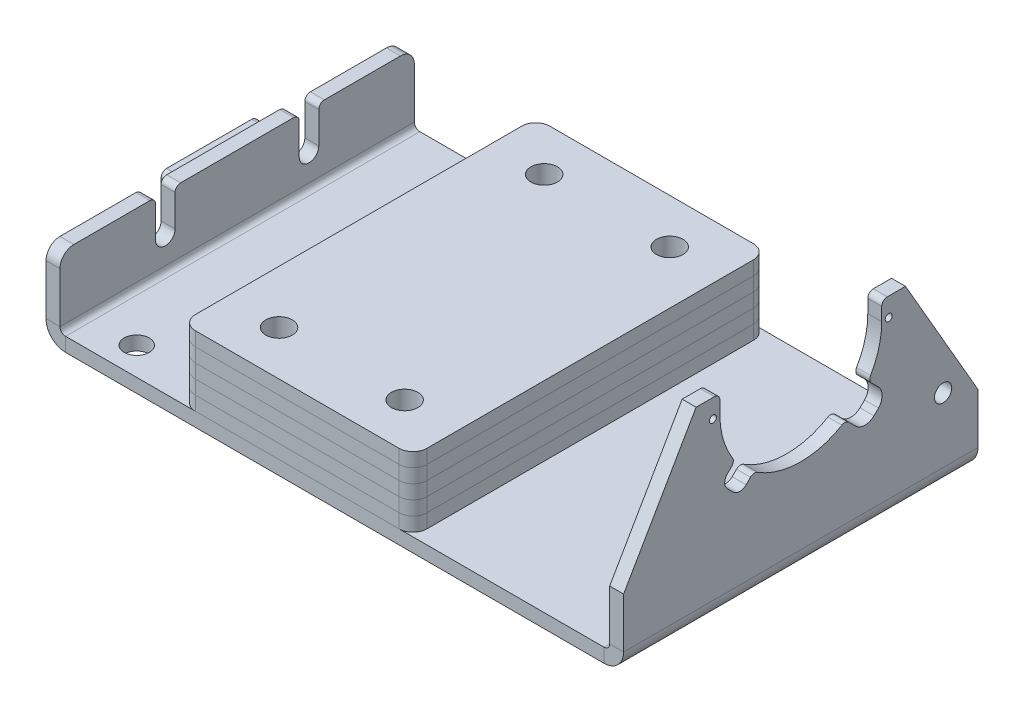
ISO-10303-21;
HEADER;
FILE_DESCRIPTION(('STEP AP214'),'2;1');
FILE_NAME('part.step','',(''),(''),'','','');
FILE_SCHEMA(('AUTOMOTIVE_DESIGN { 1 0 10303 214 1 1 1 1 }'));
ENDSEC;
DATA;
#1=APPLICATION_CONTEXT('core data for automotive mechanical design processes');
#2=APPLICATION_PROTOCOL_DEFINITION('international standard','automotive_design',2000,#1);
#3=PRODUCT_CONTEXT('',#1,'mechanical');
#4=PRODUCT('Part','Part','',(#3));
#5=PRODUCT_RELATED_PRODUCT_CATEGORY('part','',(#4));
#6=PRODUCT_DEFINITION_FORMATION('','',#4);
#7=PRODUCT_DEFINITION_CONTEXT('part definition',#1,'design');
#8=PRODUCT_DEFINITION('design','',#6,#7);
#9=PRODUCT_DEFINITION_SHAPE('','',#8);
#10=(LENGTH_UNIT() NAMED_UNIT(*) SI_UNIT(.MILLI.,.METRE.));
#11=(NAMED_UNIT(*) PLANE_ANGLE_UNIT() SI_UNIT($,.RADIAN.));
#12=(NAMED_UNIT(*) SI_UNIT($,.STERADIAN.) SOLID_ANGLE_UNIT());
#13=UNCERTAINTY_MEASURE_WITH_UNIT(LENGTH_MEASURE(1.E-05),#10,'distance_accuracy_value','');
#14=(GEOMETRIC_REPRESENTATION_CONTEXT(3) GLOBAL_UNCERTAINTY_ASSIGNED_CONTEXT((#13)) GLOBAL_UNIT_ASSIGNED_CONTEXT((#10,
#11,#12)) REPRESENTATION_CONTEXT('',''));
#15=CARTESIAN_POINT('',(0.,0.,0.));
#16=DIRECTION('',(0.,0.,1.));
#17=DIRECTION('',(1.,0.,0.));
#18=AXIS2_PLACEMENT_3D('',#15,#16,#17);
#19=CARTESIAN_POINT('',(-5.,0.,127.));
#20=DIRECTION('',(1.,0.,0.));
#21=DIRECTION('',(0.,0.,-1.));
#22=AXIS2_PLACEMENT_3D('',#19,#20,#21);
#23=PLANE('',#22);
#24=DIRECTION('',(0.,-1.,0.));
#25=VECTOR('',#24,1.);
#26=CARTESIAN_POINT('',(-5.,11.6996917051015,85.7500000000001));
#27=LINE('',#26,#25);
#28=CARTESIAN_POINT('',(-5.,23.,85.7500000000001));
#29=VERTEX_POINT('',#28);
#30=CARTESIAN_POINT('',(-5.,11.6996917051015,85.7500000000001));
#31=VERTEX_POINT('',#30);
#32=EDGE_CURVE('E591',#29,#31,#27,.T.);
#33=ORIENTED_EDGE('',*,*,#32,.F.);
#34=CARTESIAN_POINT('',(-5.,23.,83.7500000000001));
#35=DIRECTION('',(1.,0.,0.));
#36=DIRECTION('',(0.,0.,-1.));
#37=AXIS2_PLACEMENT_3D('',#34,#35,#36);
#38=CIRCLE('',#37,2.);
#39=CARTESIAN_POINT('',(-5.,25.,83.7500000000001));
#40=VERTEX_POINT('',#39);
#41=EDGE_CURVE('E1163',#29,#40,#38,.F.);
#42=ORIENTED_EDGE('',*,*,#41,.T.);
#43=DIRECTION('',(0.,0.,-1.));
#44=VECTOR('',#43,1.);
#45=CARTESIAN_POINT('',(-5.,25.,0.));
#46=LINE('',#45,#44);
#47=CARTESIAN_POINT('',(-5.,25.,43.2499999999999));
#48=VERTEX_POINT('',#47);
#49=EDGE_CURVE('E746',#40,#48,#46,.T.);
#50=ORIENTED_EDGE('',*,*,#49,.T.);
#51=CARTESIAN_POINT('',(-5.,23.,43.2499999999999));
#52=DIRECTION('',(1.,0.,0.));
#53=DIRECTION('',(0.,0.,-1.));
#54=AXIS2_PLACEMENT_3D('',#51,#52,#53);
#55=CIRCLE('',#54,2.);
#56=CARTESIAN_POINT('',(-5.,23.,41.2499999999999));
#57=VERTEX_POINT('',#56);
#58=EDGE_CURVE('E1157',#48,#57,#55,.F.);
#59=ORIENTED_EDGE('',*,*,#58,.T.);
#60=DIRECTION('',(0.,1.,0.));
#61=VECTOR('',#60,1.);
#62=CARTESIAN_POINT('',(-5.,11.6996917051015,41.2499999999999));
#63=LINE('',#62,#61);
#64=CARTESIAN_POINT('',(-5.,11.6996917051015,41.2499999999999));
#65=VERTEX_POINT('',#64);
#66=EDGE_CURVE('E602',#65,#57,#63,.T.);
#67=ORIENTED_EDGE('',*,*,#66,.F.);
#68=CARTESIAN_POINT('',(-5.,11.6996917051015,37.7499999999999));
#69=DIRECTION('',(-1.,0.,0.));
#70=DIRECTION('',(0.,0.,1.));
#71=AXIS2_PLACEMENT_3D('',#68,#69,#70);
#72=CIRCLE('',#71,3.5);
#73=CARTESIAN_POINT('',(-5.,11.6996917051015,34.2499999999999));
#74=VERTEX_POINT('',#73);
#75=EDGE_CURVE('E577',#74,#65,#72,.T.);
#76=ORIENTED_EDGE('',*,*,#75,.F.);
#77=DIRECTION('',(0.,-1.,0.));
#78=VECTOR('',#77,1.);
#79=CARTESIAN_POINT('',(-5.,11.6996917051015,34.2499999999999));
#80=LINE('',#79,#78);
#81=CARTESIAN_POINT('',(-5.,23.,34.2499999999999));
#82=VERTEX_POINT('',#81);
#83=EDGE_CURVE('E608',#82,#74,#80,.T.);
#84=ORIENTED_EDGE('',*,*,#83,.F.);
#85=CARTESIAN_POINT('',(-5.,23.,32.2499999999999));
#86=DIRECTION('',(1.,0.,0.));
#87=DIRECTION('',(0.,0.,-1.));
#88=AXIS2_PLACEMENT_3D('',#85,#86,#87);
#89=CIRCLE('',#88,2.);
#90=CARTESIAN_POINT('',(-5.,25.,32.2499999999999));
#91=VERTEX_POINT('',#90);
#92=EDGE_CURVE('E1159',#82,#91,#89,.F.);
#93=ORIENTED_EDGE('',*,*,#92,.T.);
#94=CARTESIAN_POINT('',(-5.,25.,5.));
#95=VERTEX_POINT('',#94);
#96=EDGE_CURVE('E740',#91,#95,#46,.T.);
#97=ORIENTED_EDGE('',*,*,#96,.T.);
#98=CARTESIAN_POINT('',(-5.,20.,5.));
#99=DIRECTION('',(1.,0.,0.));
#100=DIRECTION('',(0.,0.,-1.));
#101=AXIS2_PLACEMENT_3D('',#98,#99,#100);
#102=CIRCLE('',#101,5.);
#103=CARTESIAN_POINT('',(-5.,20.,0.));
#104=VERTEX_POINT('',#103);
#105=EDGE_CURVE('E979',#95,#104,#102,.F.);
#106=ORIENTED_EDGE('',*,*,#105,.T.);
#107=DIRECTION('',(0.,1.,0.));
#108=VECTOR('',#107,1.);
#109=CARTESIAN_POINT('',(-5.,0.,0.));
#110=LINE('',#109,#108);
#111=CARTESIAN_POINT('',(-5.,2.,0.));
#112=VERTEX_POINT('',#111);
#113=EDGE_CURVE('E867',#104,#112,#110,.F.);
#114=ORIENTED_EDGE('',*,*,#113,.T.);
#115=DIRECTION('',(0.,0.,-1.));
#116=VECTOR('',#115,1.);
#117=CARTESIAN_POINT('',(-5.,2.,127.));
#118=LINE('',#117,#116);
#119=CARTESIAN_POINT('',(-5.,2.,127.));
#120=VERTEX_POINT('',#119);
#121=EDGE_CURVE('E917',#120,#112,#118,.T.);
#122=ORIENTED_EDGE('',*,*,#121,.F.);
#123=DIRECTION('',(0.,1.,0.));
#124=VECTOR('',#123,1.);
#125=CARTESIAN_POINT('',(-5.,0.,127.));
#126=LINE('',#125,#124);
#127=CARTESIAN_POINT('',(-5.,20.,127.));
#128=VERTEX_POINT('',#127);
#129=EDGE_CURVE('E897',#128,#120,#126,.F.);
#130=ORIENTED_EDGE('',*,*,#129,.F.);
#131=CARTESIAN_POINT('',(-5.,20.,122.));
#132=DIRECTION('',(1.,0.,0.));
#133=DIRECTION('',(0.,0.,-1.));
#134=AXIS2_PLACEMENT_3D('',#131,#132,#133);
#135=CIRCLE('',#134,5.);
#136=CARTESIAN_POINT('',(-5.,25.,122.));
#137=VERTEX_POINT('',#136);
#138=EDGE_CURVE('E977',#128,#137,#135,.F.);
#139=ORIENTED_EDGE('',*,*,#138,.T.);
#140=CARTESIAN_POINT('',(-5.,25.,94.7500000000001));
#141=VERTEX_POINT('',#140);
#142=EDGE_CURVE('E742',#137,#141,#46,.T.);
#143=ORIENTED_EDGE('',*,*,#142,.T.);
#144=CARTESIAN_POINT('',(-5.,23.,94.7500000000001));
#145=DIRECTION('',(1.,0.,0.));
#146=DIRECTION('',(0.,0.,-1.));
#147=AXIS2_PLACEMENT_3D('',#144,#145,#146);
#148=CIRCLE('',#147,2.);
#149=CARTESIAN_POINT('',(-5.,23.,92.7500000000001));
#150=VERTEX_POINT('',#149);
#151=EDGE_CURVE('E1161',#141,#150,#148,.F.);
#152=ORIENTED_EDGE('',*,*,#151,.T.);
#153=DIRECTION('',(0.,1.,0.));
#154=VECTOR('',#153,1.);
#155=CARTESIAN_POINT('',(-5.,11.6996917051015,92.7500000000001));
#156=LINE('',#155,#154);
#157=CARTESIAN_POINT('',(-5.,11.6996917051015,92.7500000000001));
#158=VERTEX_POINT('',#157);
#159=EDGE_CURVE('E567',#158,#150,#156,.T.);
#160=ORIENTED_EDGE('',*,*,#159,.F.);
#161=CARTESIAN_POINT('',(-5.,11.6996917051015,89.2500000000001));
#162=DIRECTION('',(-1.,0.,0.));
#163=DIRECTION('',(0.,0.,-1.));
#164=AXIS2_PLACEMENT_3D('',#161,#162,#163);
#165=CIRCLE('',#164,3.5);
#166=EDGE_CURVE('E576',#31,#158,#165,.T.);
#167=ORIENTED_EDGE('',*,*,#166,.F.);
#168=EDGE_LOOP('',(#33,#42,#50,#59,#67,#76,#84,#93,#97,#106,#114,#122,#130,#139,#143,#152,#160,#167));
#169=FACE_BOUND('',#168,.T.);
#170=DIRECTION('',(0.,-1.,0.));
#171=VECTOR('',#170,1.);
#172=CARTESIAN_POINT('',(-5.,22.,46.2499999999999));
#173=LINE('',#172,#171);
#174=CARTESIAN_POINT('',(-5.,20.,46.2499999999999));
#175=VERTEX_POINT('',#174);
#176=CARTESIAN_POINT('',(-5.,16.,46.2499999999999));
#177=VERTEX_POINT('',#176);
#178=EDGE_CURVE('E1916',#175,#177,#173,.T.);
#179=ORIENTED_EDGE('',*,*,#178,.F.);
#180=CARTESIAN_POINT('',(-5.,20.,48.2499999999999));
#181=DIRECTION('',(1.,0.,0.));
#182=DIRECTION('',(0.,0.,-1.));
#183=AXIS2_PLACEMENT_3D('',#180,#181,#182);
#184=CIRCLE('',#183,2.);
#185=CARTESIAN_POINT('',(-5.,22.,48.2499999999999));
#186=VERTEX_POINT('',#185);
#187=EDGE_CURVE('E11',#175,#186,#184,.T.);
#188=ORIENTED_EDGE('',*,*,#187,.T.);
#189=DIRECTION('',(0.,0.,-1.));
#190=VECTOR('',#189,1.);
#191=CARTESIAN_POINT('',(-5.,22.,46.2499999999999));
#192=LINE('',#191,#190);
#193=CARTESIAN_POINT('',(-5.,22.,78.7500000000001));
#194=VERTEX_POINT('',#193);
#195=EDGE_CURVE('E1234',#194,#186,#192,.T.);
#196=ORIENTED_EDGE('',*,*,#195,.F.);
#197=CARTESIAN_POINT('',(-5.,20.,78.7500000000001));
#198=DIRECTION('',(1.,0.,0.));
#199=DIRECTION('',(0.,0.,-1.));
#200=AXIS2_PLACEMENT_3D('',#197,#198,#199);
#201=CIRCLE('',#200,2.);
#202=CARTESIAN_POINT('',(-5.,20.,80.7500000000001));
#203=VERTEX_POINT('',#202);
#204=EDGE_CURVE('E1228',#194,#203,#201,.T.);
#205=ORIENTED_EDGE('',*,*,#204,.T.);
#206=DIRECTION('',(0.,1.,0.));
#207=VECTOR('',#206,1.);
#208=CARTESIAN_POINT('',(-5.,22.,80.7500000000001));
#209=LINE('',#208,#207);
#210=CARTESIAN_POINT('',(-5.,16.,80.7500000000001));
#211=VERTEX_POINT('',#210);
#212=EDGE_CURVE('E1232',#211,#203,#209,.T.);
#213=ORIENTED_EDGE('',*,*,#212,.F.);
#214=CARTESIAN_POINT('',(-5.,16.,78.7500000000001));
#215=DIRECTION('',(1.,0.,0.));
#216=DIRECTION('',(0.,0.,-1.));
#217=AXIS2_PLACEMENT_3D('',#214,#215,#216);
#218=CIRCLE('',#217,2.);
#219=CARTESIAN_POINT('',(-5.,14.,78.7500000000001));
#220=VERTEX_POINT('',#219);
#221=EDGE_CURVE('E1226',#211,#220,#218,.T.);
#222=ORIENTED_EDGE('',*,*,#221,.T.);
#223=DIRECTION('',(0.,0.,1.));
#224=VECTOR('',#223,1.);
#225=CARTESIAN_POINT('',(-5.,14.,46.2499999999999));
#226=LINE('',#225,#224);
#227=CARTESIAN_POINT('',(-5.,14.,48.2499999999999));
#228=VERTEX_POINT('',#227);
#229=EDGE_CURVE('E1243',#228,#220,#226,.T.);
#230=ORIENTED_EDGE('',*,*,#229,.F.);
#231=CARTESIAN_POINT('',(-5.,16.,48.2499999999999));
#232=DIRECTION('',(1.,0.,0.));
#233=DIRECTION('',(0.,0.,-1.));
#234=AXIS2_PLACEMENT_3D('',#231,#232,#233);
#235=CIRCLE('',#234,2.);
#236=EDGE_CURVE('E49',#228,#177,#235,.T.);
#237=ORIENTED_EDGE('',*,*,#236,.T.);
#238=EDGE_LOOP('',(#179,#188,#196,#205,#213,#222,#230,#237));
#239=FACE_BOUND('',#238,.T.);
#240=ADVANCED_FACE('F41',(#169,#239),#23,.F.);
#241=CARTESIAN_POINT('',(-5.,25.,0.));
#242=DIRECTION('',(0.,-1.,0.));
#243=DIRECTION('',(0.,0.,-1.));
#244=AXIS2_PLACEMENT_3D('',#241,#242,#243);
#245=PLANE('',#244);
#246=DIRECTION('',(0.,0.,-1.));
#247=VECTOR('',#246,1.);
#248=CARTESIAN_POINT('',(0.,25.,0.));
#249=LINE('',#248,#247);
#250=CARTESIAN_POINT('',(0.,25.,122.));
#251=VERTEX_POINT('',#250);
#252=CARTESIAN_POINT('',(0.,25.,94.7500000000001));
#253=VERTEX_POINT('',#252);
#254=EDGE_CURVE('E737',#251,#253,#249,.T.);
#255=ORIENTED_EDGE('',*,*,#254,.T.);
#256=DIRECTION('',(-1.,0.,0.));
#257=VECTOR('',#256,1.);
#258=CARTESIAN_POINT('',(-5.,25.,94.7500000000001));
#259=LINE('',#258,#257);
#260=EDGE_CURVE('E1178',#253,#141,#259,.T.);
#261=ORIENTED_EDGE('',*,*,#260,.T.);
#262=ORIENTED_EDGE('',*,*,#142,.F.);
#263=DIRECTION('',(1.,0.,0.));
#264=VECTOR('',#263,1.);
#265=CARTESIAN_POINT('',(-5.,25.,122.));
#266=LINE('',#265,#264);
#267=EDGE_CURVE('E971',#137,#251,#266,.T.);
#268=ORIENTED_EDGE('',*,*,#267,.T.);
#269=EDGE_LOOP('',(#255,#261,#262,#268));
#270=FACE_BOUND('',#269,.T.);
#271=ADVANCED_FACE('F1418',(#270),#245,.F.);
#272=ORIENTED_EDGE('',*,*,#49,.F.);
#273=DIRECTION('',(-1.,0.,0.));
#274=VECTOR('',#273,1.);
#275=CARTESIAN_POINT('',(-5.,25.,83.7500000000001));
#276=LINE('',#275,#274);
#277=CARTESIAN_POINT('',(0.,25.,83.7500000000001));
#278=VERTEX_POINT('',#277);
#279=EDGE_CURVE('E1168',#40,#278,#276,.F.);
#280=ORIENTED_EDGE('',*,*,#279,.T.);
#281=CARTESIAN_POINT('',(0.,25.,43.2499999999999));
#282=VERTEX_POINT('',#281);
#283=EDGE_CURVE('E741',#278,#282,#249,.T.);
#284=ORIENTED_EDGE('',*,*,#283,.T.);
#285=DIRECTION('',(-1.,0.,0.));
#286=VECTOR('',#285,1.);
#287=CARTESIAN_POINT('',(-5.,25.,43.2499999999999));
#288=LINE('',#287,#286);
#289=EDGE_CURVE('E1165',#282,#48,#288,.T.);
#290=ORIENTED_EDGE('',*,*,#289,.T.);
#291=EDGE_LOOP('',(#272,#280,#284,#290));
#292=FACE_BOUND('',#291,.T.);
#293=ADVANCED_FACE('F1274',(#292),#245,.F.);
#294=CARTESIAN_POINT('',(202.,0.,127.));
#295=DIRECTION('',(-1.,0.,0.));
#296=DIRECTION('',(0.,0.,1.));
#297=AXIS2_PLACEMENT_3D('',#294,#295,#296);
#298=PLANE('',#297);
#299=CARTESIAN_POINT('',(202.,25.2,12.5));
#300=DIRECTION('',(1.,0.,0.));
#301=DIRECTION('',(0.,0.,-1.));
#302=AXIS2_PLACEMENT_3D('',#299,#300,#301);
#303=CIRCLE('',#302,3.1);
#304=CARTESIAN_POINT('',(202.,25.2,9.4));
#305=VERTEX_POINT('',#304);
#306=EDGE_CURVE('E587',#305,#305,#303,.T.);
#307=ORIENTED_EDGE('',*,*,#306,.F.);
#308=EDGE_LOOP('',(#307));
#309=FACE_BOUND('',#308,.T.);
#310=CARTESIAN_POINT('',(202.,58.3,95.));
#311=DIRECTION('',(1.,0.,0.));
#312=DIRECTION('',(0.,0.,-1.));
#313=AXIS2_PLACEMENT_3D('',#310,#311,#312);
#314=CIRCLE('',#313,1.24999999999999);
#315=CARTESIAN_POINT('',(202.,58.3,93.75));
#316=VERTEX_POINT('',#315);
#317=EDGE_CURVE('E645',#316,#316,#314,.T.);
#318=ORIENTED_EDGE('',*,*,#317,.F.);
#319=EDGE_LOOP('',(#318));
#320=FACE_BOUND('',#319,.T.);
#321=CARTESIAN_POINT('',(202.,58.3,32.));
#322=DIRECTION('',(1.,0.,0.));
#323=DIRECTION('',(0.,0.,-1.));
#324=AXIS2_PLACEMENT_3D('',#321,#322,#323);
#325=CIRCLE('',#324,1.24999999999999);
#326=CARTESIAN_POINT('',(202.,58.3,30.75));
#327=VERTEX_POINT('',#326);
#328=EDGE_CURVE('E651',#327,#327,#325,.T.);
#329=ORIENTED_EDGE('',*,*,#328,.F.);
#330=EDGE_LOOP('',(#329));
#331=FACE_BOUND('',#330,.T.);
#332=DIRECTION('',(0.,0.707104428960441,0.70710913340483));
#333=VECTOR('',#332,1.);
#334=CARTESIAN_POINT('',(202.,56.8343164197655,70.1660617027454));
#335=LINE('',#334,#333);
#336=CARTESIAN_POINT('',(202.,30.5566802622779,43.8882507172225));
#337=VERTEX_POINT('',#336);
#338=CARTESIAN_POINT('',(202.,33.0099439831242,46.3415307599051));
#339=VERTEX_POINT('',#338);
#340=EDGE_CURVE('E639',#337,#339,#335,.T.);
#341=ORIENTED_EDGE('',*,*,#340,.T.);
#342=CARTESIAN_POINT('',(202.,31.5957257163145,47.755739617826));
#343=DIRECTION('',(-1.,0.,0.));
#344=DIRECTION('',(0.,0.,1.));
#345=AXIS2_PLACEMENT_3D('',#342,#343,#344);
#346=CIRCLE('',#345,2.);
#347=CARTESIAN_POINT('',(202.,33.3185821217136,48.7714983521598));
#348=VERTEX_POINT('',#347);
#349=EDGE_CURVE('E1123',#339,#348,#346,.F.);
#350=ORIENTED_EDGE('',*,*,#349,.T.);
#351=CARTESIAN_POINT('',(202.,58.3,63.5));
#352=DIRECTION('',(-1.,0.,0.));
#353=DIRECTION('',(0.,0.,1.));
#354=AXIS2_PLACEMENT_3D('',#351,#352,#353);
#355=CIRCLE('',#354,29.);
#356=CARTESIAN_POINT('',(202.,33.8208817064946,79.0490439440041));
#357=VERTEX_POINT('',#356);
#358=EDGE_CURVE('E678',#357,#348,#355,.F.);
#359=ORIENTED_EDGE('',*,*,#358,.F.);
#360=CARTESIAN_POINT('',(202.,32.1326666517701,80.1213918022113));
#361=DIRECTION('',(-1.,0.,0.));
#362=DIRECTION('',(0.,0.,1.));
#363=AXIS2_PLACEMENT_3D('',#360,#361,#362);
#364=CIRCLE('',#363,2.);
#365=CARTESIAN_POINT('',(202.,33.5468802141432,81.5356053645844));
#366=VERTEX_POINT('',#365);
#367=EDGE_CURVE('E1119',#357,#366,#364,.F.);
#368=ORIENTED_EDGE('',*,*,#367,.T.);
#369=DIRECTION('',(0.,-0.707106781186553,0.707106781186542));
#370=VECTOR('',#369,1.);
#371=CARTESIAN_POINT('',(202.,-5.95875721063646,121.041242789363));
#372=LINE('',#371,#370);
#373=CARTESIAN_POINT('',(202.,31.9847622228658,83.0977233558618));
#374=VERTEX_POINT('',#373);
#375=EDGE_CURVE('E618',#366,#374,#372,.T.);
#376=ORIENTED_EDGE('',*,*,#375,.T.);
#377=CARTESIAN_POINT('',(202.,34.2828592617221,85.395820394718));
#378=DIRECTION('',(1.,0.,0.));
#379=DIRECTION('',(0.,0.,1.));
#380=AXIS2_PLACEMENT_3D('',#377,#378,#379);
#381=CIRCLE('',#380,3.25);
#382=CARTESIAN_POINT('',(202.,31.8811451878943,87.5854024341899));
#383=VERTEX_POINT('',#382);
#384=EDGE_CURVE('E694',#383,#374,#381,.T.);
#385=ORIENTED_EDGE('',*,*,#384,.F.);
#386=CARTESIAN_POINT('',(202.,58.3,63.5));
#387=DIRECTION('',(1.,0.,0.));
#388=DIRECTION('',(0.,0.,-1.));
#389=AXIS2_PLACEMENT_3D('',#386,#387,#388);
#390=CIRCLE('',#389,35.75);
#391=CARTESIAN_POINT('',(202.,34.2145975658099,89.9188548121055));
#392=VERTEX_POINT('',#391);
#393=EDGE_CURVE('E691',#392,#383,#390,.T.);
#394=ORIENTED_EDGE('',*,*,#393,.F.);
#395=CARTESIAN_POINT('',(202.,36.4041796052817,87.5171407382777));
#396=DIRECTION('',(1.,0.,0.));
#397=DIRECTION('',(0.,0.,1.));
#398=AXIS2_PLACEMENT_3D('',#395,#396,#397);
#399=CIRCLE('',#398,3.25);
#400=CARTESIAN_POINT('',(202.,38.7022766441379,89.815237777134));
#401=VERTEX_POINT('',#400);
#402=EDGE_CURVE('E689',#401,#392,#399,.T.);
#403=ORIENTED_EDGE('',*,*,#402,.F.);
#404=DIRECTION('',(0.,0.707106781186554,-0.707106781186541));
#405=VECTOR('',#404,1.);
#406=CARTESIAN_POINT('',(202.,0.758757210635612,127.758757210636));
#407=LINE('',#406,#405);
#408=CARTESIAN_POINT('',(202.,40.2643946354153,88.2531197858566));
#409=VERTEX_POINT('',#408);
#410=EDGE_CURVE('E619',#401,#409,#407,.T.);
#411=ORIENTED_EDGE('',*,*,#410,.T.);
#412=CARTESIAN_POINT('',(202.,41.6786081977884,89.6673333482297));
#413=DIRECTION('',(-1.,0.,0.));
#414=DIRECTION('',(0.,0.,1.));
#415=AXIS2_PLACEMENT_3D('',#412,#413,#414);
#416=CIRCLE('',#415,2.);
#417=CARTESIAN_POINT('',(202.,42.7509560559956,87.9791182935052));
#418=VERTEX_POINT('',#417);
#419=EDGE_CURVE('E1117',#409,#418,#416,.F.);
#420=ORIENTED_EDGE('',*,*,#419,.T.);
#421=CARTESIAN_POINT('',(202.,58.3,92.5));
#422=VERTEX_POINT('',#421);
#423=EDGE_CURVE('E675',#422,#418,#355,.F.);
#424=ORIENTED_EDGE('',*,*,#423,.F.);
#425=DIRECTION('',(0.,1.,0.));
#426=VECTOR('',#425,1.);
#427=CARTESIAN_POINT('',(202.,0.,92.5));
#428=LINE('',#427,#426);
#429=CARTESIAN_POINT('',(202.,63.,92.5));
#430=VERTEX_POINT('',#429);
#431=EDGE_CURVE('E673',#430,#422,#428,.F.);
#432=ORIENTED_EDGE('',*,*,#431,.F.);
#433=CARTESIAN_POINT('',(202.,63.,94.5));
#434=DIRECTION('',(-1.,0.,0.));
#435=DIRECTION('',(0.,0.,1.));
#436=AXIS2_PLACEMENT_3D('',#433,#434,#435);
#437=CIRCLE('',#436,2.);
#438=CARTESIAN_POINT('',(202.,65.,94.5));
#439=VERTEX_POINT('',#438);
#440=EDGE_CURVE('E1113',#430,#439,#437,.F.);
#441=ORIENTED_EDGE('',*,*,#440,.T.);
#442=DIRECTION('',(0.,0.,-1.));
#443=VECTOR('',#442,1.);
#444=CARTESIAN_POINT('',(202.,65.,127.));
#445=LINE('',#444,#443);
#446=CARTESIAN_POINT('',(202.,65.,101.019237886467));
#447=VERTEX_POINT('',#446);
#448=EDGE_CURVE('E937',#447,#439,#445,.T.);
#449=ORIENTED_EDGE('',*,*,#448,.F.);
#450=DIRECTION('',(0.,0.86602540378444,-0.499999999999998));
#451=VECTOR('',#450,1.);
#452=CARTESIAN_POINT('',(202.,65.,101.019237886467));
#453=LINE('',#452,#451);
#454=CARTESIAN_POINT('',(202.,19.9999999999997,127.));
#455=VERTEX_POINT('',#454);
#456=EDGE_CURVE('E986',#447,#455,#453,.F.);
#457=ORIENTED_EDGE('',*,*,#456,.T.);
#458=DIRECTION('',(0.,1.,0.));
#459=VECTOR('',#458,1.);
#460=CARTESIAN_POINT('',(202.,0.,127.));
#461=LINE('',#460,#459);
#462=CARTESIAN_POINT('',(202.,2.,127.));
#463=VERTEX_POINT('',#462);
#464=EDGE_CURVE('E878',#463,#455,#461,.T.);
#465=ORIENTED_EDGE('',*,*,#464,.F.);
#466=DIRECTION('',(0.,0.,-1.));
#467=VECTOR('',#466,1.);
#468=CARTESIAN_POINT('',(202.,2.,127.));
#469=LINE('',#468,#467);
#470=CARTESIAN_POINT('',(202.,2.,0.));
#471=VERTEX_POINT('',#470);
#472=EDGE_CURVE('E908',#463,#471,#469,.T.);
#473=ORIENTED_EDGE('',*,*,#472,.T.);
#474=DIRECTION('',(0.,1.,0.));
#475=VECTOR('',#474,1.);
#476=CARTESIAN_POINT('',(202.,0.,0.));
#477=LINE('',#476,#475);
#478=CARTESIAN_POINT('',(202.,19.9999999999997,0.));
#479=VERTEX_POINT('',#478);
#480=EDGE_CURVE('E847',#471,#479,#477,.T.);
#481=ORIENTED_EDGE('',*,*,#480,.T.);
#482=DIRECTION('',(0.,0.86602540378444,0.499999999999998));
#483=VECTOR('',#482,1.);
#484=CARTESIAN_POINT('',(202.,65.,25.9807621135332));
#485=LINE('',#484,#483);
#486=CARTESIAN_POINT('',(202.,65.,25.9807621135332));
#487=VERTEX_POINT('',#486);
#488=EDGE_CURVE('E731',#487,#479,#485,.F.);
#489=ORIENTED_EDGE('',*,*,#488,.F.);
#490=CARTESIAN_POINT('',(202.,65.,32.5));
#491=VERTEX_POINT('',#490);
#492=EDGE_CURVE('E936',#491,#487,#445,.T.);
#493=ORIENTED_EDGE('',*,*,#492,.F.);
#494=CARTESIAN_POINT('',(202.,63.,32.5));
#495=DIRECTION('',(-1.,0.,0.));
#496=DIRECTION('',(0.,0.,1.));
#497=AXIS2_PLACEMENT_3D('',#494,#495,#496);
#498=CIRCLE('',#497,2.);
#499=CARTESIAN_POINT('',(202.,63.,34.5));
#500=VERTEX_POINT('',#499);
#501=EDGE_CURVE('E1115',#491,#500,#498,.F.);
#502=ORIENTED_EDGE('',*,*,#501,.T.);
#503=DIRECTION('',(0.,1.,0.));
#504=VECTOR('',#503,1.);
#505=CARTESIAN_POINT('',(202.,0.,34.5));
#506=LINE('',#505,#504);
#507=CARTESIAN_POINT('',(202.,58.3,34.5));
#508=VERTEX_POINT('',#507);
#509=EDGE_CURVE('E670',#508,#500,#506,.T.);
#510=ORIENTED_EDGE('',*,*,#509,.F.);
#511=CARTESIAN_POINT('',(202.,58.3,63.5));
#512=DIRECTION('',(-1.,0.,0.));
#513=DIRECTION('',(0.,0.,1.));
#514=AXIS2_PLACEMENT_3D('',#511,#512,#513);
#515=CIRCLE('',#514,29.);
#516=CARTESIAN_POINT('',(202.,43.5716645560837,38.5184841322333));
#517=VERTEX_POINT('',#516);
#518=EDGE_CURVE('E667',#517,#508,#515,.F.);
#519=ORIENTED_EDGE('',*,*,#518,.F.);
#520=CARTESIAN_POINT('',(202.,42.5559172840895,36.7956209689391));
#521=DIRECTION('',(-1.,0.,0.));
#522=DIRECTION('',(0.,0.,1.));
#523=AXIS2_PLACEMENT_3D('',#520,#521,#522);
#524=CIRCLE('',#523,2.);
#525=CARTESIAN_POINT('',(202.,41.1416990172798,38.20982982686));
#526=VERTEX_POINT('',#525);
#527=EDGE_CURVE('E1121',#517,#526,#524,.F.);
#528=ORIENTED_EDGE('',*,*,#527,.T.);
#529=DIRECTION('',(0.,-0.70710442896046,-0.70710913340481));
#530=VECTOR('',#529,1.);
#531=CARTESIAN_POINT('',(202.,64.96607145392,62.0343607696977));
#532=LINE('',#531,#530);
#533=CARTESIAN_POINT('',(202.,38.6884352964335,35.7565497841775));
#534=VERTEX_POINT('',#533);
#535=EDGE_CURVE('E631',#526,#534,#532,.T.);
#536=ORIENTED_EDGE('',*,*,#535,.T.);
#537=CARTESIAN_POINT('',(202.,35.3296669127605,39.1152958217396));
#538=DIRECTION('',(1.,0.,0.));
#539=DIRECTION('',(0.,0.,-1.));
#540=AXIS2_PLACEMENT_3D('',#537,#538,#539);
#541=CIRCLE('',#540,4.74999999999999);
#542=CARTESIAN_POINT('',(202.,32.0726793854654,35.6577631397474));
#543=VERTEX_POINT('',#542);
#544=EDGE_CURVE('E716',#543,#534,#541,.T.);
#545=ORIENTED_EDGE('',*,*,#544,.F.);
#546=CARTESIAN_POINT('',(202.,58.3,63.5));
#547=DIRECTION('',(1.,0.,0.));
#548=DIRECTION('',(0.,0.,1.));
#549=AXIS2_PLACEMENT_3D('',#546,#547,#548);
#550=CIRCLE('',#549,38.25);
#551=CARTESIAN_POINT('',(202.,30.4579376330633,37.2724941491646));
#552=VERTEX_POINT('',#551);
#553=EDGE_CURVE('E713',#552,#543,#550,.T.);
#554=ORIENTED_EDGE('',*,*,#553,.F.);
#555=CARTESIAN_POINT('',(202.,33.9154486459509,40.5295046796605));
#556=DIRECTION('',(1.,0.,0.));
#557=DIRECTION('',(0.,0.,-1.));
#558=AXIS2_PLACEMENT_3D('',#555,#556,#557);
#559=CIRCLE('',#558,4.74999999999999);
#560=EDGE_CURVE('E711',#337,#552,#559,.T.);
#561=ORIENTED_EDGE('',*,*,#560,.F.);
#562=EDGE_LOOP('',(#341,#350,#359,#368,#376,#385,#394,#403,#411,#420,#424,#432,#441,#449,#457,
#465,#473,#481,#489,#493,#502,#510,#519,#528,#536,#545,#554,#561));
#563=FACE_BOUND('',#562,.T.);
#564=ADVANCED_FACE('F1270',(#309,#320,#331,#563),#298,.F.);
#565=CARTESIAN_POINT('',(197.,0.,127.));
#566=DIRECTION('',(-1.,0.,0.));
#567=DIRECTION('',(0.,0.,1.));
#568=AXIS2_PLACEMENT_3D('',#565,#566,#567);
#569=PLANE('',#568);
#570=CARTESIAN_POINT('',(197.,25.2,12.5));
#571=DIRECTION('',(-1.,0.,0.));
#572=DIRECTION('',(0.,0.,1.));
#573=AXIS2_PLACEMENT_3D('',#570,#571,#572);
#574=CIRCLE('',#573,3.1);
#575=CARTESIAN_POINT('',(197.,25.2,9.4));
#576=VERTEX_POINT('',#575);
#577=EDGE_CURVE('E1257',#576,#576,#574,.F.);
#578=ORIENTED_EDGE('',*,*,#577,.T.);
#579=EDGE_LOOP('',(#578));
#580=FACE_BOUND('',#579,.T.);
#581=CARTESIAN_POINT('',(197.,58.3,32.));
#582=DIRECTION('',(-1.,0.,0.));
#583=DIRECTION('',(0.,0.,1.));
#584=AXIS2_PLACEMENT_3D('',#581,#582,#583);
#585=CIRCLE('',#584,1.24999999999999);
#586=CARTESIAN_POINT('',(197.,58.3,33.25));
#587=VERTEX_POINT('',#586);
#588=EDGE_CURVE('E654',#587,#587,#585,.T.);
#589=ORIENTED_EDGE('',*,*,#588,.F.);
#590=EDGE_LOOP('',(#589));
#591=FACE_BOUND('',#590,.T.);
#592=CARTESIAN_POINT('',(197.,58.3,95.));
#593=DIRECTION('',(-1.,0.,0.));
#594=DIRECTION('',(0.,0.,1.));
#595=AXIS2_PLACEMENT_3D('',#592,#593,#594);
#596=CIRCLE('',#595,1.24999999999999);
#597=CARTESIAN_POINT('',(197.,58.3,96.25));
#598=VERTEX_POINT('',#597);
#599=EDGE_CURVE('E648',#598,#598,#596,.T.);
#600=ORIENTED_EDGE('',*,*,#599,.F.);
#601=EDGE_LOOP('',(#600));
#602=FACE_BOUND('',#601,.T.);
#603=CARTESIAN_POINT('',(197.,58.3,63.5));
#604=DIRECTION('',(-1.,0.,0.));
#605=DIRECTION('',(0.,0.,1.));
#606=AXIS2_PLACEMENT_3D('',#603,#604,#605);
#607=CIRCLE('',#606,29.);
#608=CARTESIAN_POINT('',(197.,33.8208817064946,79.0490439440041));
#609=VERTEX_POINT('',#608);
#610=CARTESIAN_POINT('',(197.,33.3185821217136,48.7714983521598));
#611=VERTEX_POINT('',#610);
#612=EDGE_CURVE('E657',#609,#611,#607,.F.);
#613=ORIENTED_EDGE('',*,*,#612,.T.);
#614=CARTESIAN_POINT('',(197.,31.5957257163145,47.755739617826));
#615=DIRECTION('',(-1.,0.,0.));
#616=DIRECTION('',(0.,0.,1.));
#617=AXIS2_PLACEMENT_3D('',#614,#615,#616);
#618=CIRCLE('',#617,2.);
#619=CARTESIAN_POINT('',(197.,33.0099439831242,46.3415307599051));
#620=VERTEX_POINT('',#619);
#621=EDGE_CURVE('E1140',#611,#620,#618,.T.);
#622=ORIENTED_EDGE('',*,*,#621,.T.);
#623=DIRECTION('',(0.,0.707104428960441,0.70710913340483));
#624=VECTOR('',#623,1.);
#625=CARTESIAN_POINT('',(197.,56.8343164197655,70.1660617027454));
#626=LINE('',#625,#624);
#627=CARTESIAN_POINT('',(197.,30.5566802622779,43.8882507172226));
#628=VERTEX_POINT('',#627);
#629=EDGE_CURVE('E636',#628,#620,#626,.T.);
#630=ORIENTED_EDGE('',*,*,#629,.F.);
#631=CARTESIAN_POINT('',(197.,33.9154486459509,40.5295046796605));
#632=DIRECTION('',(-1.,0.,0.));
#633=DIRECTION('',(0.,0.,1.));
#634=AXIS2_PLACEMENT_3D('',#631,#632,#633);
#635=CIRCLE('',#634,4.74999999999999);
#636=CARTESIAN_POINT('',(197.,30.4579376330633,37.2724941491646));
#637=VERTEX_POINT('',#636);
#638=EDGE_CURVE('E722',#628,#637,#635,.F.);
#639=ORIENTED_EDGE('',*,*,#638,.T.);
#640=CARTESIAN_POINT('',(197.,58.3,63.5));
#641=DIRECTION('',(-1.,0.,0.));
#642=DIRECTION('',(0.,0.,1.));
#643=AXIS2_PLACEMENT_3D('',#640,#641,#642);
#644=CIRCLE('',#643,38.25);
#645=CARTESIAN_POINT('',(197.,32.0726793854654,35.6577631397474));
#646=VERTEX_POINT('',#645);
#647=EDGE_CURVE('E705',#637,#646,#644,.F.);
#648=ORIENTED_EDGE('',*,*,#647,.T.);
#649=CARTESIAN_POINT('',(197.,35.3296669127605,39.1152958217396));
#650=DIRECTION('',(-1.,0.,0.));
#651=DIRECTION('',(0.,0.,1.));
#652=AXIS2_PLACEMENT_3D('',#649,#650,#651);
#653=CIRCLE('',#652,4.74999999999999);
#654=CARTESIAN_POINT('',(197.,38.6884352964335,35.7565497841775));
#655=VERTEX_POINT('',#654);
#656=EDGE_CURVE('E708',#646,#655,#653,.F.);
#657=ORIENTED_EDGE('',*,*,#656,.T.);
#658=DIRECTION('',(0.,-0.70710442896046,-0.70710913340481));
#659=VECTOR('',#658,1.);
#660=CARTESIAN_POINT('',(197.,64.96607145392,62.0343607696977));
#661=LINE('',#660,#659);
#662=CARTESIAN_POINT('',(197.,41.1416990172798,38.20982982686));
#663=VERTEX_POINT('',#662);
#664=EDGE_CURVE('E629',#663,#655,#661,.T.);
#665=ORIENTED_EDGE('',*,*,#664,.F.);
#666=CARTESIAN_POINT('',(197.,42.5559172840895,36.7956209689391));
#667=DIRECTION('',(-1.,0.,0.));
#668=DIRECTION('',(0.,0.,1.));
#669=AXIS2_PLACEMENT_3D('',#666,#667,#668);
#670=CIRCLE('',#669,2.);
#671=CARTESIAN_POINT('',(197.,43.5716645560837,38.5184841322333));
#672=VERTEX_POINT('',#671);
#673=EDGE_CURVE('E1138',#663,#672,#670,.T.);
#674=ORIENTED_EDGE('',*,*,#673,.T.);
#675=CARTESIAN_POINT('',(197.,58.3,34.5));
#676=VERTEX_POINT('',#675);
#677=EDGE_CURVE('E662',#672,#676,#607,.F.);
#678=ORIENTED_EDGE('',*,*,#677,.T.);
#679=DIRECTION('',(0.,1.,0.));
#680=VECTOR('',#679,1.);
#681=CARTESIAN_POINT('',(197.,65.,34.5));
#682=LINE('',#681,#680);
#683=CARTESIAN_POINT('',(197.,63.,34.5));
#684=VERTEX_POINT('',#683);
#685=EDGE_CURVE('E664',#676,#684,#682,.T.);
#686=ORIENTED_EDGE('',*,*,#685,.T.);
#687=CARTESIAN_POINT('',(197.,63.,32.5));
#688=DIRECTION('',(-1.,0.,0.));
#689=DIRECTION('',(0.,0.,1.));
#690=AXIS2_PLACEMENT_3D('',#687,#688,#689);
#691=CIRCLE('',#690,2.);
#692=CARTESIAN_POINT('',(197.,65.,32.5));
#693=VERTEX_POINT('',#692);
#694=EDGE_CURVE('E1132',#684,#693,#691,.T.);
#695=ORIENTED_EDGE('',*,*,#694,.T.);
#696=DIRECTION('',(0.,0.,-1.));
#697=VECTOR('',#696,1.);
#698=CARTESIAN_POINT('',(197.,65.,127.));
#699=LINE('',#698,#697);
#700=CARTESIAN_POINT('',(197.,65.,25.9807621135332));
#701=VERTEX_POINT('',#700);
#702=EDGE_CURVE('E932',#693,#701,#699,.T.);
#703=ORIENTED_EDGE('',*,*,#702,.T.);
#704=DIRECTION('',(0.,-0.86602540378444,-0.499999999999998));
#705=VECTOR('',#704,1.);
#706=CARTESIAN_POINT('',(197.,4.99999999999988,-8.66025403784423));
#707=LINE('',#706,#705);
#708=CARTESIAN_POINT('',(197.,19.9999999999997,0.));
#709=VERTEX_POINT('',#708);
#710=EDGE_CURVE('E726',#709,#701,#707,.F.);
#711=ORIENTED_EDGE('',*,*,#710,.F.);
#712=DIRECTION('',(0.,1.,0.));
#713=VECTOR('',#712,1.);
#714=CARTESIAN_POINT('',(197.,0.,0.));
#715=LINE('',#714,#713);
#716=CARTESIAN_POINT('',(197.,2.,0.));
#717=VERTEX_POINT('',#716);
#718=EDGE_CURVE('E851',#717,#709,#715,.T.);
#719=ORIENTED_EDGE('',*,*,#718,.F.);
#720=DIRECTION('',(0.,0.,-1.));
#721=VECTOR('',#720,1.);
#722=CARTESIAN_POINT('',(197.,2.,127.));
#723=LINE('',#722,#721);
#724=CARTESIAN_POINT('',(197.,2.,127.));
#725=VERTEX_POINT('',#724);
#726=EDGE_CURVE('E929',#725,#717,#723,.T.);
#727=ORIENTED_EDGE('',*,*,#726,.F.);
#728=DIRECTION('',(0.,1.,0.));
#729=VECTOR('',#728,1.);
#730=CARTESIAN_POINT('',(197.,0.,127.));
#731=LINE('',#730,#729);
#732=CARTESIAN_POINT('',(197.,19.9999999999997,127.));
#733=VERTEX_POINT('',#732);
#734=EDGE_CURVE('E881',#725,#733,#731,.T.);
#735=ORIENTED_EDGE('',*,*,#734,.T.);
#736=DIRECTION('',(0.,-0.86602540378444,0.499999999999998));
#737=VECTOR('',#736,1.);
#738=CARTESIAN_POINT('',(197.,4.99999999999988,135.660254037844));
#739=LINE('',#738,#737);
#740=CARTESIAN_POINT('',(197.,65.,101.019237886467));
#741=VERTEX_POINT('',#740);
#742=EDGE_CURVE('E990',#733,#741,#739,.F.);
#743=ORIENTED_EDGE('',*,*,#742,.T.);
#744=CARTESIAN_POINT('',(197.,65.,94.5));
#745=VERTEX_POINT('',#744);
#746=EDGE_CURVE('E933',#741,#745,#699,.T.);
#747=ORIENTED_EDGE('',*,*,#746,.T.);
#748=CARTESIAN_POINT('',(197.,63.,94.5));
#749=DIRECTION('',(-1.,0.,0.));
#750=DIRECTION('',(0.,0.,1.));
#751=AXIS2_PLACEMENT_3D('',#748,#749,#750);
#752=CIRCLE('',#751,2.);
#753=CARTESIAN_POINT('',(197.,63.,92.5));
#754=VERTEX_POINT('',#753);
#755=EDGE_CURVE('E1130',#745,#754,#752,.T.);
#756=ORIENTED_EDGE('',*,*,#755,.T.);
#757=DIRECTION('',(0.,-1.,0.));
#758=VECTOR('',#757,1.);
#759=CARTESIAN_POINT('',(197.,58.3,92.5));
#760=LINE('',#759,#758);
#761=CARTESIAN_POINT('',(197.,58.3,92.5));
#762=VERTEX_POINT('',#761);
#763=EDGE_CURVE('E661',#754,#762,#760,.T.);
#764=ORIENTED_EDGE('',*,*,#763,.T.);
#765=CARTESIAN_POINT('',(197.,42.7509560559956,87.9791182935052));
#766=VERTEX_POINT('',#765);
#767=EDGE_CURVE('E658',#762,#766,#607,.F.);
#768=ORIENTED_EDGE('',*,*,#767,.T.);
#769=CARTESIAN_POINT('',(197.,41.6786081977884,89.6673333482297));
#770=DIRECTION('',(-1.,0.,0.));
#771=DIRECTION('',(0.,0.,1.));
#772=AXIS2_PLACEMENT_3D('',#769,#770,#771);
#773=CIRCLE('',#772,2.);
#774=CARTESIAN_POINT('',(197.,40.2643946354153,88.2531197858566));
#775=VERTEX_POINT('',#774);
#776=EDGE_CURVE('E1134',#766,#775,#773,.T.);
#777=ORIENTED_EDGE('',*,*,#776,.T.);
#778=DIRECTION('',(0.,0.707106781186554,-0.707106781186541));
#779=VECTOR('',#778,1.);
#780=CARTESIAN_POINT('',(197.,0.758757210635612,127.758757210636));
#781=LINE('',#780,#779);
#782=CARTESIAN_POINT('',(197.,38.7022766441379,89.815237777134));
#783=VERTEX_POINT('',#782);
#784=EDGE_CURVE('E615',#783,#775,#781,.T.);
#785=ORIENTED_EDGE('',*,*,#784,.F.);
#786=CARTESIAN_POINT('',(197.,36.4041796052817,87.5171407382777));
#787=DIRECTION('',(-1.,0.,0.));
#788=DIRECTION('',(0.,0.,1.));
#789=AXIS2_PLACEMENT_3D('',#786,#787,#788);
#790=CIRCLE('',#789,3.25);
#791=CARTESIAN_POINT('',(197.,34.2145975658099,89.9188548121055));
#792=VERTEX_POINT('',#791);
#793=EDGE_CURVE('E687',#783,#792,#790,.F.);
#794=ORIENTED_EDGE('',*,*,#793,.T.);
#795=CARTESIAN_POINT('',(197.,58.3,63.5));
#796=DIRECTION('',(-1.,0.,0.));
#797=DIRECTION('',(0.,0.,1.));
#798=AXIS2_PLACEMENT_3D('',#795,#796,#797);
#799=CIRCLE('',#798,35.75);
#800=CARTESIAN_POINT('',(197.,31.8811451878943,87.5854024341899));
#801=VERTEX_POINT('',#800);
#802=EDGE_CURVE('E700',#792,#801,#799,.F.);
#803=ORIENTED_EDGE('',*,*,#802,.T.);
#804=CARTESIAN_POINT('',(197.,34.2828592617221,85.395820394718));
#805=DIRECTION('',(-1.,0.,0.));
#806=DIRECTION('',(0.,0.,1.));
#807=AXIS2_PLACEMENT_3D('',#804,#805,#806);
#808=CIRCLE('',#807,3.25);
#809=CARTESIAN_POINT('',(197.,31.9847622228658,83.0977233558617));
#810=VERTEX_POINT('',#809);
#811=EDGE_CURVE('E684',#801,#810,#808,.F.);
#812=ORIENTED_EDGE('',*,*,#811,.T.);
#813=DIRECTION('',(0.,-0.707106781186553,0.707106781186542));
#814=VECTOR('',#813,1.);
#815=CARTESIAN_POINT('',(197.,-5.95875721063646,121.041242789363));
#816=LINE('',#815,#814);
#817=CARTESIAN_POINT('',(197.,33.5468802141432,81.5356053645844));
#818=VERTEX_POINT('',#817);
#819=EDGE_CURVE('E611',#818,#810,#816,.T.);
#820=ORIENTED_EDGE('',*,*,#819,.F.);
#821=CARTESIAN_POINT('',(197.,32.1326666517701,80.1213918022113));
#822=DIRECTION('',(-1.,0.,0.));
#823=DIRECTION('',(0.,0.,1.));
#824=AXIS2_PLACEMENT_3D('',#821,#822,#823);
#825=CIRCLE('',#824,2.);
#826=EDGE_CURVE('E1136',#818,#609,#825,.T.);
#827=ORIENTED_EDGE('',*,*,#826,.T.);
#828=EDGE_LOOP('',(#613,#622,#630,#639,#648,#657,#665,#674,#678,#686,#695,#703,#711,#719,#727,
#735,#743,#747,#756,#764,#768,#777,#785,#794,#803,#812,#820,#827));
#829=FACE_BOUND('',#828,.T.);
#830=ADVANCED_FACE('F1273',(#580,#591,#602,#829),#569,.T.);
#831=CARTESIAN_POINT('',(197.,58.3,63.5));
#832=DIRECTION('',(-1.,0.,0.));
#833=DIRECTION('',(0.,0.,1.));
#834=AXIS2_PLACEMENT_3D('',#831,#832,#833);
#835=CYLINDRICAL_SURFACE('',#834,29.);
#836=ORIENTED_EDGE('',*,*,#423,.T.);
#837=DIRECTION('',(-1.,0.,0.));
#838=VECTOR('',#837,1.);
#839=CARTESIAN_POINT('',(197.,42.7509560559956,87.9791182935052));
#840=LINE('',#839,#838);
#841=EDGE_CURVE('E1152',#418,#766,#840,.T.);
#842=ORIENTED_EDGE('',*,*,#841,.T.);
#843=ORIENTED_EDGE('',*,*,#767,.F.);
#844=DIRECTION('',(-1.,0.,0.));
#845=VECTOR('',#844,1.);
#846=CARTESIAN_POINT('',(197.,58.3,92.5));
#847=LINE('',#846,#845);
#848=EDGE_CURVE('E681',#762,#422,#847,.F.);
#849=ORIENTED_EDGE('',*,*,#848,.T.);
#850=EDGE_LOOP('',(#836,#842,#843,#849));
#851=FACE_BOUND('',#850,.T.);
#852=ADVANCED_FACE('F1378',(#851),#835,.F.);
#853=ORIENTED_EDGE('',*,*,#358,.T.);
#854=DIRECTION('',(-1.,0.,0.));
#855=VECTOR('',#854,1.);
#856=CARTESIAN_POINT('',(197.,33.3185821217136,48.7714983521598));
#857=LINE('',#856,#855);
#858=EDGE_CURVE('E1128',#348,#611,#857,.T.);
#859=ORIENTED_EDGE('',*,*,#858,.T.);
#860=ORIENTED_EDGE('',*,*,#612,.F.);
#861=DIRECTION('',(-1.,0.,0.));
#862=VECTOR('',#861,1.);
#863=CARTESIAN_POINT('',(197.,33.8208817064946,79.0490439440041));
#864=LINE('',#863,#862);
#865=EDGE_CURVE('E1125',#609,#357,#864,.F.);
#866=ORIENTED_EDGE('',*,*,#865,.T.);
#867=EDGE_LOOP('',(#853,#859,#860,#866));
#868=FACE_BOUND('',#867,.T.);
#869=ADVANCED_FACE('F1301',(#868),#835,.F.);
#870=CARTESIAN_POINT('',(-5.00100000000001,34.2828592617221,85.395820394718));
#871=DIRECTION('',(1.,0.,0.));
#872=DIRECTION('',(0.,0.,-1.));
#873=AXIS2_PLACEMENT_3D('',#870,#871,#872);
#874=CYLINDRICAL_SURFACE('',#873,3.25);
#875=DIRECTION('',(-1.,0.,0.));
#876=VECTOR('',#875,1.);
#877=CARTESIAN_POINT('',(197.,31.9847622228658,83.0977233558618));
#878=LINE('',#877,#876);
#879=EDGE_CURVE('E626',#810,#374,#878,.F.);
#880=ORIENTED_EDGE('',*,*,#879,.F.);
#881=ORIENTED_EDGE('',*,*,#811,.F.);
#882=DIRECTION('',(1.,0.,0.));
#883=VECTOR('',#882,1.);
#884=CARTESIAN_POINT('',(-5.00100000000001,31.8811451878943,87.5854024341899));
#885=LINE('',#884,#883);
#886=EDGE_CURVE('E698',#801,#383,#885,.T.);
#887=ORIENTED_EDGE('',*,*,#886,.T.);
#888=ORIENTED_EDGE('',*,*,#384,.T.);
#889=EDGE_LOOP('',(#880,#881,#887,#888));
#890=FACE_BOUND('',#889,.T.);
#891=ADVANCED_FACE('F1399',(#890),#874,.F.);
#892=CARTESIAN_POINT('',(-5.00100000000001,35.3296669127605,39.1152958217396));
#893=DIRECTION('',(1.,0.,0.));
#894=DIRECTION('',(0.,0.,-1.));
#895=AXIS2_PLACEMENT_3D('',#892,#893,#894);
#896=CYLINDRICAL_SURFACE('',#895,4.74999999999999);
#897=DIRECTION('',(-1.,0.,0.));
#898=VECTOR('',#897,1.);
#899=CARTESIAN_POINT('',(197.,38.6884352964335,35.7565497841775));
#900=LINE('',#899,#898);
#901=EDGE_CURVE('E633',#655,#534,#900,.F.);
#902=ORIENTED_EDGE('',*,*,#901,.F.);
#903=ORIENTED_EDGE('',*,*,#656,.F.);
#904=DIRECTION('',(1.,0.,0.));
#905=VECTOR('',#904,1.);
#906=CARTESIAN_POINT('',(-5.00100000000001,32.0726793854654,35.6577631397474));
#907=LINE('',#906,#905);
#908=EDGE_CURVE('E720',#646,#543,#907,.T.);
#909=ORIENTED_EDGE('',*,*,#908,.T.);
#910=ORIENTED_EDGE('',*,*,#544,.T.);
#911=EDGE_LOOP('',(#902,#903,#909,#910));
#912=FACE_BOUND('',#911,.T.);
#913=ADVANCED_FACE('F1633',(#912),#896,.F.);
#914=ORIENTED_EDGE('',*,*,#677,.F.);
#915=DIRECTION('',(-1.,0.,0.));
#916=VECTOR('',#915,1.);
#917=CARTESIAN_POINT('',(197.,43.5716645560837,38.5184841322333));
#918=LINE('',#917,#916);
#919=EDGE_CURVE('E1142',#672,#517,#918,.F.);
#920=ORIENTED_EDGE('',*,*,#919,.T.);
#921=ORIENTED_EDGE('',*,*,#518,.T.);
#922=DIRECTION('',(-1.,0.,0.));
#923=VECTOR('',#922,1.);
#924=CARTESIAN_POINT('',(197.,58.3,34.5));
#925=LINE('',#924,#923);
#926=EDGE_CURVE('E669',#676,#508,#925,.F.);
#927=ORIENTED_EDGE('',*,*,#926,.F.);
#928=EDGE_LOOP('',(#914,#920,#921,#927));
#929=FACE_BOUND('',#928,.T.);
#930=ADVANCED_FACE('F1317',(#929),#835,.F.);
#931=CARTESIAN_POINT('',(48.5223491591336,5.,5.));
#932=DIRECTION('',(0.,-1.,0.));
#933=DIRECTION('',(0.,0.,-1.));
#934=AXIS2_PLACEMENT_3D('',#931,#932,#933);
#935=CYLINDRICAL_SURFACE('',#934,5.);
#936=CARTESIAN_POINT('',(48.5223491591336,5.,5.));
#937=DIRECTION('',(0.,1.,0.));
#938=DIRECTION('',(0.,0.,1.));
#939=AXIS2_PLACEMENT_3D('',#936,#937,#938);
#940=CIRCLE('',#939,5.);
#941=CARTESIAN_POINT('',(48.5223491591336,5.,0.));
#942=VERTEX_POINT('',#941);
#943=CARTESIAN_POINT('',(43.5223491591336,5.,5.));
#944=VERTEX_POINT('',#943);
#945=EDGE_CURVE('E1003',#942,#944,#940,.T.);
#946=ORIENTED_EDGE('',*,*,#945,.F.);
#947=DIRECTION('',(0.,-1.,0.));
#948=VECTOR('',#947,1.);
#949=CARTESIAN_POINT('',(48.5223491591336,5.,0.));
#950=LINE('',#949,#948);
#951=CARTESIAN_POINT('',(48.5223491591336,0.,0.));
#952=VERTEX_POINT('',#951);
#953=EDGE_CURVE('E829',#942,#952,#950,.T.);
#954=ORIENTED_EDGE('',*,*,#953,.T.);
#955=CARTESIAN_POINT('',(48.5223491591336,0.,5.));
#956=DIRECTION('',(0.,1.,0.));
#957=DIRECTION('',(0.,0.,-1.));
#958=AXIS2_PLACEMENT_3D('',#955,#956,#957);
#959=CIRCLE('',#958,5.);
#960=CARTESIAN_POINT('',(43.5223491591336,0.,5.));
#961=VERTEX_POINT('',#960);
#962=EDGE_CURVE('E785',#952,#961,#959,.T.);
#963=ORIENTED_EDGE('',*,*,#962,.T.);
#964=DIRECTION('',(0.,-1.,0.));
#965=VECTOR('',#964,1.);
#966=CARTESIAN_POINT('',(43.5223491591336,5.,5.));
#967=LINE('',#966,#965);
#968=EDGE_CURVE('E824',#944,#961,#967,.T.);
#969=ORIENTED_EDGE('',*,*,#968,.F.);
#970=EDGE_LOOP('',(#946,#954,#963,#969));
#971=FACE_BOUND('',#970,.T.);
#972=ADVANCED_FACE('F1592',(#971),#935,.T.);
#973=CARTESIAN_POINT('',(48.5223491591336,10.,5.));
#974=DIRECTION('',(0.,-1.,0.));
#975=DIRECTION('',(1.,0.,0.));
#976=AXIS2_PLACEMENT_3D('',#973,#974,#975);
#977=CIRCLE('',#976,5.);
#978=CARTESIAN_POINT('',(43.5223491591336,10.,5.));
#979=VERTEX_POINT('',#978);
#980=CARTESIAN_POINT('',(48.5223491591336,10.,0.));
#981=VERTEX_POINT('',#980);
#982=EDGE_CURVE('E1007',#979,#981,#977,.T.);
#983=ORIENTED_EDGE('',*,*,#982,.F.);
#984=CARTESIAN_POINT('',(43.5223491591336,15.,5.));
#985=VERTEX_POINT('',#984);
#986=EDGE_CURVE('E2809',#985,#979,#967,.T.);
#987=ORIENTED_EDGE('',*,*,#986,.F.);
#988=CARTESIAN_POINT('',(48.5223491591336,15.,5.));
#989=DIRECTION('',(0.,1.,0.));
#990=DIRECTION('',(0.,0.,1.));
#991=AXIS2_PLACEMENT_3D('',#988,#989,#990);
#992=CIRCLE('',#991,5.);
#993=CARTESIAN_POINT('',(48.5223491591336,15.,0.));
#994=VERTEX_POINT('',#993);
#995=EDGE_CURVE('E1045',#994,#985,#992,.T.);
#996=ORIENTED_EDGE('',*,*,#995,.F.);
#997=EDGE_CURVE('E2728',#994,#981,#950,.T.);
#998=ORIENTED_EDGE('',*,*,#997,.T.);
#999=EDGE_LOOP('',(#983,#987,#996,#998));
#1000=FACE_BOUND('',#999,.T.);
#1001=ADVANCED_FACE('F2239',(#1000),#935,.T.);
#1002=EDGE_CURVE('E2730',#981,#942,#950,.T.);
#1003=ORIENTED_EDGE('',*,*,#1002,.T.);
#1004=ORIENTED_EDGE('',*,*,#945,.T.);
#1005=EDGE_CURVE('E2807',#979,#944,#967,.T.);
#1006=ORIENTED_EDGE('',*,*,#1005,.F.);
#1007=ORIENTED_EDGE('',*,*,#982,.T.);
#1008=EDGE_LOOP('',(#1003,#1004,#1006,#1007));
#1009=FACE_BOUND('',#1008,.T.);
#1010=ADVANCED_FACE('F2249',(#1009),#935,.T.);
#1011=CARTESIAN_POINT('',(48.5223491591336,20.,5.));
#1012=DIRECTION('',(0.,-1.,0.));
#1013=DIRECTION('',(0.,0.,-1.));
#1014=AXIS2_PLACEMENT_3D('',#1011,#1012,#1013);
#1015=CIRCLE('',#1014,5.);
#1016=CARTESIAN_POINT('',(43.5223491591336,20.,5.));
#1017=VERTEX_POINT('',#1016);
#1018=CARTESIAN_POINT('',(48.5223491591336,20.,0.));
#1019=VERTEX_POINT('',#1018);
#1020=EDGE_CURVE('E996',#1017,#1019,#1015,.T.);
#1021=ORIENTED_EDGE('',*,*,#1020,.F.);
#1022=CARTESIAN_POINT('',(43.5223491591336,25.,5.));
#1023=VERTEX_POINT('',#1022);
#1024=EDGE_CURVE('E826',#1023,#1017,#967,.T.);
#1025=ORIENTED_EDGE('',*,*,#1024,.F.);
#1026=CARTESIAN_POINT('',(48.5223491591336,25.,5.));
#1027=DIRECTION('',(0.,1.,0.));
#1028=DIRECTION('',(0.,0.,-1.));
#1029=AXIS2_PLACEMENT_3D('',#1026,#1027,#1028);
#1030=CIRCLE('',#1029,5.);
#1031=CARTESIAN_POINT('',(48.5223491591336,25.,0.));
#1032=VERTEX_POINT('',#1031);
#1033=EDGE_CURVE('E764',#1032,#1023,#1030,.T.);
#1034=ORIENTED_EDGE('',*,*,#1033,.F.);
#1035=EDGE_CURVE('E831',#1032,#1019,#950,.T.);
#1036=ORIENTED_EDGE('',*,*,#1035,.T.);
#1037=EDGE_LOOP('',(#1021,#1025,#1034,#1036));
#1038=FACE_BOUND('',#1037,.T.);
#1039=ADVANCED_FACE('F1593',(#1038),#935,.T.);
#1040=CARTESIAN_POINT('',(202.,2.,0.));
#1041=DIRECTION('',(0.,0.,-1.));
#1042=DIRECTION('',(-1.,0.,0.));
#1043=AXIS2_PLACEMENT_3D('',#1040,#1041,#1042);
#1044=PLANE('',#1043);
#1045=DIRECTION('',(0.,-1.,0.));
#1046=VECTOR('',#1045,1.);
#1047=CARTESIAN_POINT('',(121.522349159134,5.,0.));
#1048=LINE('',#1047,#1046);
#1049=CARTESIAN_POINT('',(121.522349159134,5.,0.));
#1050=VERTEX_POINT('',#1049);
#1051=CARTESIAN_POINT('',(121.522349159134,0.,0.));
#1052=VERTEX_POINT('',#1051);
#1053=EDGE_CURVE('E834',#1050,#1052,#1048,.T.);
#1054=ORIENTED_EDGE('',*,*,#1053,.T.);
#1055=DIRECTION('',(-1.,0.,0.));
#1056=VECTOR('',#1055,1.);
#1057=CARTESIAN_POINT('',(202.,0.,0.));
#1058=LINE('',#1057,#1056);
#1059=EDGE_CURVE('E993',#1052,#952,#1058,.T.);
#1060=ORIENTED_EDGE('',*,*,#1059,.T.);
#1061=ORIENTED_EDGE('',*,*,#953,.F.);
#1062=DIRECTION('',(1.,0.,0.));
#1063=VECTOR('',#1062,1.);
#1064=CARTESIAN_POINT('',(202.,5.,0.));
#1065=LINE('',#1064,#1063);
#1066=EDGE_CURVE('E997',#942,#1050,#1065,.T.);
#1067=ORIENTED_EDGE('',*,*,#1066,.T.);
#1068=EDGE_LOOP('',(#1054,#1060,#1061,#1067));
#1069=FACE_BOUND('',#1068,.T.);
#1070=ADVANCED_FACE('F1455',(#1069),#1044,.T.);
#1071=ORIENTED_EDGE('',*,*,#1059,.F.);
#1072=DIRECTION('',(1.,0.,0.));
#1073=VECTOR('',#1072,1.);
#1074=CARTESIAN_POINT('',(0.,0.,0.));
#1075=LINE('',#1074,#1073);
#1076=CARTESIAN_POINT('',(195.,0.,0.));
#1077=VERTEX_POINT('',#1076);
#1078=EDGE_CURVE('E857',#1052,#1077,#1075,.T.);
#1079=ORIENTED_EDGE('',*,*,#1078,.T.);
#1080=DIRECTION('',(0.,-1.,0.));
#1081=VECTOR('',#1080,1.);
#1082=CARTESIAN_POINT('',(195.,0.,0.));
#1083=LINE('',#1082,#1081);
#1084=CARTESIAN_POINT('',(195.,-5.,0.));
#1085=VERTEX_POINT('',#1084);
#1086=EDGE_CURVE('E942',#1077,#1085,#1083,.T.);
#1087=ORIENTED_EDGE('',*,*,#1086,.T.);
#1088=DIRECTION('',(1.,0.,0.));
#1089=VECTOR('',#1088,1.);
#1090=CARTESIAN_POINT('',(0.,-5.,0.));
#1091=LINE('',#1090,#1089);
#1092=CARTESIAN_POINT('',(2.,-5.,0.));
#1093=VERTEX_POINT('',#1092);
#1094=EDGE_CURVE('E872',#1093,#1085,#1091,.T.);
#1095=ORIENTED_EDGE('',*,*,#1094,.F.);
#1096=DIRECTION('',(0.,1.,0.));
#1097=VECTOR('',#1096,1.);
#1098=CARTESIAN_POINT('',(2.,-5.,0.));
#1099=LINE('',#1098,#1097);
#1100=CARTESIAN_POINT('',(2.,0.,0.));
#1101=VERTEX_POINT('',#1100);
#1102=EDGE_CURVE('E949',#1093,#1101,#1099,.T.);
#1103=ORIENTED_EDGE('',*,*,#1102,.T.);
#1104=CARTESIAN_POINT('',(16.8848820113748,0.,0.));
#1105=VERTEX_POINT('',#1104);
#1106=EDGE_CURVE('E858',#1101,#1105,#1075,.T.);
#1107=ORIENTED_EDGE('',*,*,#1106,.T.);
#1108=EDGE_CURVE('E862',#1105,#952,#1075,.T.);
#1109=ORIENTED_EDGE('',*,*,#1108,.T.);
#1110=EDGE_LOOP('',(#1071,#1079,#1087,#1095,#1103,#1107,#1109));
#1111=FACE_BOUND('',#1110,.T.);
#1112=ADVANCED_FACE('F2274',(#1111),#1044,.T.);
#1113=CARTESIAN_POINT('',(121.522349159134,15.,0.));
#1114=VERTEX_POINT('',#1113);
#1115=CARTESIAN_POINT('',(121.522349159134,10.,0.));
#1116=VERTEX_POINT('',#1115);
#1117=EDGE_CURVE('E2762',#1114,#1116,#1048,.T.);
#1118=ORIENTED_EDGE('',*,*,#1117,.T.);
#1119=DIRECTION('',(-1.,0.,0.));
#1120=VECTOR('',#1119,1.);
#1121=CARTESIAN_POINT('',(202.,10.,0.));
#1122=LINE('',#1121,#1120);
#1123=EDGE_CURVE('E1010',#1116,#981,#1122,.T.);
#1124=ORIENTED_EDGE('',*,*,#1123,.T.);
#1125=ORIENTED_EDGE('',*,*,#997,.F.);
#1126=DIRECTION('',(1.,0.,0.));
#1127=VECTOR('',#1126,1.);
#1128=CARTESIAN_POINT('',(202.,15.,0.));
#1129=LINE('',#1128,#1127);
#1130=EDGE_CURVE('E1049',#994,#1114,#1129,.T.);
#1131=ORIENTED_EDGE('',*,*,#1130,.T.);
#1132=EDGE_LOOP('',(#1118,#1124,#1125,#1131));
#1133=FACE_BOUND('',#1132,.T.);
#1134=ADVANCED_FACE('F2283',(#1133),#1044,.T.);
#1135=ORIENTED_EDGE('',*,*,#1066,.F.);
#1136=ORIENTED_EDGE('',*,*,#1002,.F.);
#1137=ORIENTED_EDGE('',*,*,#1123,.F.);
#1138=EDGE_CURVE('E2759',#1116,#1050,#1048,.T.);
#1139=ORIENTED_EDGE('',*,*,#1138,.T.);
#1140=EDGE_LOOP('',(#1135,#1136,#1137,#1139));
#1141=FACE_BOUND('',#1140,.T.);
#1142=ADVANCED_FACE('F2293',(#1141),#1044,.T.);
#1143=CARTESIAN_POINT('',(121.522349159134,25.,0.));
#1144=VERTEX_POINT('',#1143);
#1145=CARTESIAN_POINT('',(121.522349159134,20.,0.));
#1146=VERTEX_POINT('',#1145);
#1147=EDGE_CURVE('E836',#1144,#1146,#1048,.T.);
#1148=ORIENTED_EDGE('',*,*,#1147,.T.);
#1149=DIRECTION('',(-1.,0.,0.));
#1150=VECTOR('',#1149,1.);
#1151=CARTESIAN_POINT('',(202.,20.,0.));
#1152=LINE('',#1151,#1150);
#1153=EDGE_CURVE('E1015',#1146,#1019,#1152,.T.);
#1154=ORIENTED_EDGE('',*,*,#1153,.T.);
#1155=ORIENTED_EDGE('',*,*,#1035,.F.);
#1156=DIRECTION('',(-1.,0.,0.));
#1157=VECTOR('',#1156,1.);
#1158=CARTESIAN_POINT('',(121.522349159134,25.,0.));
#1159=LINE('',#1158,#1157);
#1160=EDGE_CURVE('E761',#1144,#1032,#1159,.T.);
#1161=ORIENTED_EDGE('',*,*,#1160,.F.);
#1162=EDGE_LOOP('',(#1148,#1154,#1155,#1161));
#1163=FACE_BOUND('',#1162,.T.);
#1164=ADVANCED_FACE('F1456',(#1163),#1044,.T.);
#1165=CARTESIAN_POINT('',(121.522349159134,5.,5.));
#1166=DIRECTION('',(0.,-1.,0.));
#1167=DIRECTION('',(0.,0.,-1.));
#1168=AXIS2_PLACEMENT_3D('',#1165,#1166,#1167);
#1169=CYLINDRICAL_SURFACE('',#1168,5.);
#1170=CARTESIAN_POINT('',(121.522349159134,5.,5.));
#1171=DIRECTION('',(0.,1.,0.));
#1172=DIRECTION('',(0.,0.,1.));
#1173=AXIS2_PLACEMENT_3D('',#1170,#1171,#1172);
#1174=CIRCLE('',#1173,5.);
#1175=CARTESIAN_POINT('',(126.522349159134,5.,5.));
#1176=VERTEX_POINT('',#1175);
#1177=EDGE_CURVE('E1011',#1176,#1050,#1174,.T.);
#1178=ORIENTED_EDGE('',*,*,#1177,.F.);
#1179=DIRECTION('',(0.,-1.,0.));
#1180=VECTOR('',#1179,1.);
#1181=CARTESIAN_POINT('',(126.522349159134,5.,5.));
#1182=LINE('',#1181,#1180);
#1183=CARTESIAN_POINT('',(126.522349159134,0.,5.));
#1184=VERTEX_POINT('',#1183);
#1185=EDGE_CURVE('E800',#1176,#1184,#1182,.T.);
#1186=ORIENTED_EDGE('',*,*,#1185,.T.);
#1187=CARTESIAN_POINT('',(121.522349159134,0.,5.));
#1188=DIRECTION('',(0.,1.,0.));
#1189=DIRECTION('',(0.,0.,1.));
#1190=AXIS2_PLACEMENT_3D('',#1187,#1188,#1189);
#1191=CIRCLE('',#1190,5.);
#1192=EDGE_CURVE('E782',#1184,#1052,#1191,.T.);
#1193=ORIENTED_EDGE('',*,*,#1192,.T.);
#1194=ORIENTED_EDGE('',*,*,#1053,.F.);
#1195=EDGE_LOOP('',(#1178,#1186,#1193,#1194));
#1196=FACE_BOUND('',#1195,.T.);
#1197=ADVANCED_FACE('F1587',(#1196),#1169,.T.);
#1198=CARTESIAN_POINT('',(121.522349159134,10.,5.));
#1199=DIRECTION('',(0.,-1.,0.));
#1200=DIRECTION('',(1.,0.,0.));
#1201=AXIS2_PLACEMENT_3D('',#1198,#1199,#1200);
#1202=CIRCLE('',#1201,5.);
#1203=CARTESIAN_POINT('',(126.522349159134,10.,5.));
#1204=VERTEX_POINT('',#1203);
#1205=EDGE_CURVE('E1016',#1116,#1204,#1202,.T.);
#1206=ORIENTED_EDGE('',*,*,#1205,.F.);
#1207=ORIENTED_EDGE('',*,*,#1117,.F.);
#1208=CARTESIAN_POINT('',(121.522349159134,15.,5.));
#1209=DIRECTION('',(0.,1.,0.));
#1210=DIRECTION('',(0.,0.,1.));
#1211=AXIS2_PLACEMENT_3D('',#1208,#1209,#1210);
#1212=CIRCLE('',#1211,5.);
#1213=CARTESIAN_POINT('',(126.522349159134,15.,5.));
#1214=VERTEX_POINT('',#1213);
#1215=EDGE_CURVE('E1052',#1214,#1114,#1212,.T.);
#1216=ORIENTED_EDGE('',*,*,#1215,.F.);
#1217=EDGE_CURVE('E2755',#1214,#1204,#1182,.T.);
#1218=ORIENTED_EDGE('',*,*,#1217,.T.);
#1219=EDGE_LOOP('',(#1206,#1207,#1216,#1218));
#1220=FACE_BOUND('',#1219,.T.);
#1221=ADVANCED_FACE('F2321',(#1220),#1169,.T.);
#1222=EDGE_CURVE('E2744',#1204,#1176,#1182,.T.);
#1223=ORIENTED_EDGE('',*,*,#1222,.T.);
#1224=ORIENTED_EDGE('',*,*,#1177,.T.);
#1225=ORIENTED_EDGE('',*,*,#1138,.F.);
#1226=ORIENTED_EDGE('',*,*,#1205,.T.);
#1227=EDGE_LOOP('',(#1223,#1224,#1225,#1226));
#1228=FACE_BOUND('',#1227,.T.);
#1229=ADVANCED_FACE('F2330',(#1228),#1169,.T.);
#1230=CARTESIAN_POINT('',(121.522349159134,20.,5.));
#1231=DIRECTION('',(0.,-1.,0.));
#1232=DIRECTION('',(0.,0.,-1.));
#1233=AXIS2_PLACEMENT_3D('',#1230,#1231,#1232);
#1234=CIRCLE('',#1233,5.);
#1235=CARTESIAN_POINT('',(126.522349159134,20.,5.));
#1236=VERTEX_POINT('',#1235);
#1237=EDGE_CURVE('E1021',#1146,#1236,#1234,.T.);
#1238=ORIENTED_EDGE('',*,*,#1237,.F.);
#1239=ORIENTED_EDGE('',*,*,#1147,.F.);
#1240=CARTESIAN_POINT('',(121.522349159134,25.,5.));
#1241=DIRECTION('',(0.,1.,0.));
#1242=DIRECTION('',(0.,0.,1.));
#1243=AXIS2_PLACEMENT_3D('',#1240,#1241,#1242);
#1244=CIRCLE('',#1243,5.);
#1245=CARTESIAN_POINT('',(126.522349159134,25.,5.));
#1246=VERTEX_POINT('',#1245);
#1247=EDGE_CURVE('E758',#1246,#1144,#1244,.T.);
#1248=ORIENTED_EDGE('',*,*,#1247,.F.);
#1249=EDGE_CURVE('E801',#1246,#1236,#1182,.T.);
#1250=ORIENTED_EDGE('',*,*,#1249,.T.);
#1251=EDGE_LOOP('',(#1238,#1239,#1248,#1250));
#1252=FACE_BOUND('',#1251,.T.);
#1253=ADVANCED_FACE('F1588',(#1252),#1169,.T.);
#1254=CARTESIAN_POINT('',(126.522349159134,5.,5.));
#1255=DIRECTION('',(-1.,0.,0.));
#1256=DIRECTION('',(0.,0.,1.));
#1257=AXIS2_PLACEMENT_3D('',#1254,#1255,#1256);
#1258=PLANE('',#1257);
#1259=DIRECTION('',(0.,0.,-1.));
#1260=VECTOR('',#1259,1.);
#1261=CARTESIAN_POINT('',(126.522349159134,5.,5.));
#1262=LINE('',#1261,#1260);
#1263=CARTESIAN_POINT('',(126.522349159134,5.,122.));
#1264=VERTEX_POINT('',#1263);
#1265=EDGE_CURVE('E1017',#1264,#1176,#1262,.T.);
#1266=ORIENTED_EDGE('',*,*,#1265,.F.);
#1267=DIRECTION('',(0.,-1.,0.));
#1268=VECTOR('',#1267,1.);
#1269=CARTESIAN_POINT('',(126.522349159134,5.,122.));
#1270=LINE('',#1269,#1268);
#1271=CARTESIAN_POINT('',(126.522349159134,0.,122.));
#1272=VERTEX_POINT('',#1271);
#1273=EDGE_CURVE('E804',#1264,#1272,#1270,.T.);
#1274=ORIENTED_EDGE('',*,*,#1273,.T.);
#1275=DIRECTION('',(0.,0.,-1.));
#1276=VECTOR('',#1275,1.);
#1277=CARTESIAN_POINT('',(126.522349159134,0.,5.));
#1278=LINE('',#1277,#1276);
#1279=EDGE_CURVE('E797',#1272,#1184,#1278,.T.);
#1280=ORIENTED_EDGE('',*,*,#1279,.T.);
#1281=ORIENTED_EDGE('',*,*,#1185,.F.);
#1282=EDGE_LOOP('',(#1266,#1274,#1280,#1281));
#1283=FACE_BOUND('',#1282,.T.);
#1284=ADVANCED_FACE('F1608',(#1283),#1258,.F.);
#1285=DIRECTION('',(0.,0.,1.));
#1286=VECTOR('',#1285,1.);
#1287=CARTESIAN_POINT('',(126.522349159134,10.,5.));
#1288=LINE('',#1287,#1286);
#1289=CARTESIAN_POINT('',(126.522349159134,10.,122.));
#1290=VERTEX_POINT('',#1289);
#1291=EDGE_CURVE('E1022',#1204,#1290,#1288,.T.);
#1292=ORIENTED_EDGE('',*,*,#1291,.F.);
#1293=ORIENTED_EDGE('',*,*,#1217,.F.);
#1294=DIRECTION('',(0.,0.,-1.));
#1295=VECTOR('',#1294,1.);
#1296=CARTESIAN_POINT('',(126.522349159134,15.,5.));
#1297=LINE('',#1296,#1295);
#1298=CARTESIAN_POINT('',(126.522349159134,15.,122.));
#1299=VERTEX_POINT('',#1298);
#1300=EDGE_CURVE('E1055',#1299,#1214,#1297,.T.);
#1301=ORIENTED_EDGE('',*,*,#1300,.F.);
#1302=EDGE_CURVE('E2749',#1299,#1290,#1270,.T.);
#1303=ORIENTED_EDGE('',*,*,#1302,.T.);
#1304=EDGE_LOOP('',(#1292,#1293,#1301,#1303));
#1305=FACE_BOUND('',#1304,.T.);
#1306=ADVANCED_FACE('F2355',(#1305),#1258,.F.);
#1307=EDGE_CURVE('E2747',#1290,#1264,#1270,.T.);
#1308=ORIENTED_EDGE('',*,*,#1307,.T.);
#1309=ORIENTED_EDGE('',*,*,#1265,.T.);
#1310=ORIENTED_EDGE('',*,*,#1222,.F.);
#1311=ORIENTED_EDGE('',*,*,#1291,.T.);
#1312=EDGE_LOOP('',(#1308,#1309,#1310,#1311));
#1313=FACE_BOUND('',#1312,.T.);
#1314=ADVANCED_FACE('F2364',(#1313),#1258,.F.);
#1315=DIRECTION('',(0.,0.,1.));
#1316=VECTOR('',#1315,1.);
#1317=CARTESIAN_POINT('',(126.522349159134,20.,5.));
#1318=LINE('',#1317,#1316);
#1319=CARTESIAN_POINT('',(126.522349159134,20.,122.));
#1320=VERTEX_POINT('',#1319);
#1321=EDGE_CURVE('E1027',#1236,#1320,#1318,.T.);
#1322=ORIENTED_EDGE('',*,*,#1321,.F.);
#1323=ORIENTED_EDGE('',*,*,#1249,.F.);
#1324=DIRECTION('',(0.,0.,-1.));
#1325=VECTOR('',#1324,1.);
#1326=CARTESIAN_POINT('',(126.522349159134,25.,5.));
#1327=LINE('',#1326,#1325);
#1328=CARTESIAN_POINT('',(126.522349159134,25.,122.));
#1329=VERTEX_POINT('',#1328);
#1330=EDGE_CURVE('E779',#1329,#1246,#1327,.T.);
#1331=ORIENTED_EDGE('',*,*,#1330,.F.);
#1332=EDGE_CURVE('E806',#1329,#1320,#1270,.T.);
#1333=ORIENTED_EDGE('',*,*,#1332,.T.);
#1334=EDGE_LOOP('',(#1322,#1323,#1331,#1333));
#1335=FACE_BOUND('',#1334,.T.);
#1336=ADVANCED_FACE('F1609',(#1335),#1258,.F.);
#1337=CARTESIAN_POINT('',(121.522349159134,5.,122.));
#1338=DIRECTION('',(0.,-1.,0.));
#1339=DIRECTION('',(0.,0.,-1.));
#1340=AXIS2_PLACEMENT_3D('',#1337,#1338,#1339);
#1341=CYLINDRICAL_SURFACE('',#1340,5.00000000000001);
#1342=CARTESIAN_POINT('',(121.522349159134,5.,122.));
#1343=DIRECTION('',(0.,1.,0.));
#1344=DIRECTION('',(0.,0.,1.));
#1345=AXIS2_PLACEMENT_3D('',#1342,#1343,#1344);
#1346=CIRCLE('',#1345,5.00000000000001);
#1347=CARTESIAN_POINT('',(121.522349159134,5.,127.));
#1348=VERTEX_POINT('',#1347);
#1349=EDGE_CURVE('E1023',#1348,#1264,#1346,.T.);
#1350=ORIENTED_EDGE('',*,*,#1349,.F.);
#1351=DIRECTION('',(0.,-1.,0.));
#1352=VECTOR('',#1351,1.);
#1353=CARTESIAN_POINT('',(121.522349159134,5.,127.));
#1354=LINE('',#1353,#1352);
#1355=CARTESIAN_POINT('',(121.522349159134,0.,127.));
#1356=VERTEX_POINT('',#1355);
#1357=EDGE_CURVE('E809',#1348,#1356,#1354,.T.);
#1358=ORIENTED_EDGE('',*,*,#1357,.T.);
#1359=CARTESIAN_POINT('',(121.522349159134,0.,122.));
#1360=DIRECTION('',(0.,1.,0.));
#1361=DIRECTION('',(0.,0.,-1.));
#1362=AXIS2_PLACEMENT_3D('',#1359,#1360,#1361);
#1363=CIRCLE('',#1362,5.00000000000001);
#1364=EDGE_CURVE('E794',#1356,#1272,#1363,.T.);
#1365=ORIENTED_EDGE('',*,*,#1364,.T.);
#1366=ORIENTED_EDGE('',*,*,#1273,.F.);
#1367=EDGE_LOOP('',(#1350,#1358,#1365,#1366));
#1368=FACE_BOUND('',#1367,.T.);
#1369=ADVANCED_FACE('F1603',(#1368),#1341,.T.);
#1370=CARTESIAN_POINT('',(121.522349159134,10.,122.));
#1371=DIRECTION('',(0.,-1.,0.));
#1372=DIRECTION('',(1.,0.,0.));
#1373=AXIS2_PLACEMENT_3D('',#1370,#1371,#1372);
#1374=CIRCLE('',#1373,5.00000000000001);
#1375=CARTESIAN_POINT('',(121.522349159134,10.,127.));
#1376=VERTEX_POINT('',#1375);
#1377=EDGE_CURVE('E1028',#1290,#1376,#1374,.T.);
#1378=ORIENTED_EDGE('',*,*,#1377,.F.);
#1379=ORIENTED_EDGE('',*,*,#1302,.F.);
#1380=CARTESIAN_POINT('',(121.522349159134,15.,122.));
#1381=DIRECTION('',(0.,1.,0.));
#1382=DIRECTION('',(0.,0.,1.));
#1383=AXIS2_PLACEMENT_3D('',#1380,#1381,#1382);
#1384=CIRCLE('',#1383,5.00000000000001);
#1385=CARTESIAN_POINT('',(121.522349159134,15.,127.));
#1386=VERTEX_POINT('',#1385);
#1387=EDGE_CURVE('E1058',#1386,#1299,#1384,.T.);
#1388=ORIENTED_EDGE('',*,*,#1387,.F.);
#1389=EDGE_CURVE('E2709',#1386,#1376,#1354,.T.);
#1390=ORIENTED_EDGE('',*,*,#1389,.T.);
#1391=EDGE_LOOP('',(#1378,#1379,#1388,#1390));
#1392=FACE_BOUND('',#1391,.T.);
#1393=ADVANCED_FACE('F2389',(#1392),#1341,.T.);
#1394=EDGE_CURVE('E2707',#1376,#1348,#1354,.T.);
#1395=ORIENTED_EDGE('',*,*,#1394,.T.);
#1396=ORIENTED_EDGE('',*,*,#1349,.T.);
#1397=ORIENTED_EDGE('',*,*,#1307,.F.);
#1398=ORIENTED_EDGE('',*,*,#1377,.T.);
#1399=EDGE_LOOP('',(#1395,#1396,#1397,#1398));
#1400=FACE_BOUND('',#1399,.T.);
#1401=ADVANCED_FACE('F2398',(#1400),#1341,.T.);
#1402=CARTESIAN_POINT('',(121.522349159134,20.,122.));
#1403=DIRECTION('',(0.,-1.,0.));
#1404=DIRECTION('',(0.,0.,-1.));
#1405=AXIS2_PLACEMENT_3D('',#1402,#1403,#1404);
#1406=CIRCLE('',#1405,5.00000000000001);
#1407=CARTESIAN_POINT('',(121.522349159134,20.,127.));
#1408=VERTEX_POINT('',#1407);
#1409=EDGE_CURVE('E1032',#1320,#1408,#1406,.T.);
#1410=ORIENTED_EDGE('',*,*,#1409,.F.);
#1411=ORIENTED_EDGE('',*,*,#1332,.F.);
#1412=CARTESIAN_POINT('',(121.522349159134,25.,122.));
#1413=DIRECTION('',(0.,1.,0.));
#1414=DIRECTION('',(0.,0.,-1.));
#1415=AXIS2_PLACEMENT_3D('',#1412,#1413,#1414);
#1416=CIRCLE('',#1415,5.00000000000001);
#1417=CARTESIAN_POINT('',(121.522349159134,25.,127.));
#1418=VERTEX_POINT('',#1417);
#1419=EDGE_CURVE('E776',#1418,#1329,#1416,.T.);
#1420=ORIENTED_EDGE('',*,*,#1419,.F.);
#1421=EDGE_CURVE('E811',#1418,#1408,#1354,.T.);
#1422=ORIENTED_EDGE('',*,*,#1421,.T.);
#1423=EDGE_LOOP('',(#1410,#1411,#1420,#1422));
#1424=FACE_BOUND('',#1423,.T.);
#1425=ADVANCED_FACE('F1604',(#1424),#1341,.T.);
#1426=CARTESIAN_POINT('',(43.5223491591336,5.,5.));
#1427=DIRECTION('',(1.,0.,0.));
#1428=DIRECTION('',(0.,0.,-1.));
#1429=AXIS2_PLACEMENT_3D('',#1426,#1427,#1428);
#1430=PLANE('',#1429);
#1431=DIRECTION('',(0.,0.,1.));
#1432=VECTOR('',#1431,1.);
#1433=CARTESIAN_POINT('',(43.5223491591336,5.,5.));
#1434=LINE('',#1433,#1432);
#1435=CARTESIAN_POINT('',(43.5223491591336,5.,122.));
#1436=VERTEX_POINT('',#1435);
#1437=EDGE_CURVE('E1029',#944,#1436,#1434,.T.);
#1438=ORIENTED_EDGE('',*,*,#1437,.F.);
#1439=ORIENTED_EDGE('',*,*,#968,.T.);
#1440=DIRECTION('',(0.,0.,1.));
#1441=VECTOR('',#1440,1.);
#1442=CARTESIAN_POINT('',(43.5223491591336,0.,5.));
#1443=LINE('',#1442,#1441);
#1444=CARTESIAN_POINT('',(43.5223491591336,0.,122.));
#1445=VERTEX_POINT('',#1444);
#1446=EDGE_CURVE('E788',#961,#1445,#1443,.T.);
#1447=ORIENTED_EDGE('',*,*,#1446,.T.);
#1448=DIRECTION('',(0.,-1.,0.));
#1449=VECTOR('',#1448,1.);
#1450=CARTESIAN_POINT('',(43.5223491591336,5.,122.));
#1451=LINE('',#1450,#1449);
#1452=EDGE_CURVE('E819',#1436,#1445,#1451,.T.);
#1453=ORIENTED_EDGE('',*,*,#1452,.F.);
#1454=EDGE_LOOP('',(#1438,#1439,#1447,#1453));
#1455=FACE_BOUND('',#1454,.T.);
#1456=ADVANCED_FACE('F1533',(#1455),#1430,.F.);
#1457=DIRECTION('',(0.,0.,-1.));
#1458=VECTOR('',#1457,1.);
#1459=CARTESIAN_POINT('',(43.5223491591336,10.,5.));
#1460=LINE('',#1459,#1458);
#1461=CARTESIAN_POINT('',(43.5223491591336,10.,122.));
#1462=VERTEX_POINT('',#1461);
#1463=EDGE_CURVE('E1033',#1462,#979,#1460,.T.);
#1464=ORIENTED_EDGE('',*,*,#1463,.F.);
#1465=CARTESIAN_POINT('',(43.5223491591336,15.,122.));
#1466=VERTEX_POINT('',#1465);
#1467=EDGE_CURVE('E1516',#1466,#1462,#1451,.T.);
#1468=ORIENTED_EDGE('',*,*,#1467,.F.);
#1469=DIRECTION('',(0.,0.,1.));
#1470=VECTOR('',#1469,1.);
#1471=CARTESIAN_POINT('',(43.5223491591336,15.,5.));
#1472=LINE('',#1471,#1470);
#1473=EDGE_CURVE('E1062',#985,#1466,#1472,.T.);
#1474=ORIENTED_EDGE('',*,*,#1473,.F.);
#1475=ORIENTED_EDGE('',*,*,#986,.T.);
#1476=EDGE_LOOP('',(#1464,#1468,#1474,#1475));
#1477=FACE_BOUND('',#1476,.T.);
#1478=ADVANCED_FACE('F2423',(#1477),#1430,.F.);
#1479=ORIENTED_EDGE('',*,*,#1005,.T.);
#1480=ORIENTED_EDGE('',*,*,#1437,.T.);
#1481=EDGE_CURVE('E1518',#1462,#1436,#1451,.T.);
#1482=ORIENTED_EDGE('',*,*,#1481,.F.);
#1483=ORIENTED_EDGE('',*,*,#1463,.T.);
#1484=EDGE_LOOP('',(#1479,#1480,#1482,#1483));
#1485=FACE_BOUND('',#1484,.T.);
#1486=ADVANCED_FACE('F2431',(#1485),#1430,.F.);
#1487=DIRECTION('',(0.,0.,-1.));
#1488=VECTOR('',#1487,1.);
#1489=CARTESIAN_POINT('',(43.5223491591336,20.,5.));
#1490=LINE('',#1489,#1488);
#1491=CARTESIAN_POINT('',(43.5223491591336,20.,122.));
#1492=VERTEX_POINT('',#1491);
#1493=EDGE_CURVE('E1037',#1492,#1017,#1490,.T.);
#1494=ORIENTED_EDGE('',*,*,#1493,.F.);
#1495=CARTESIAN_POINT('',(43.5223491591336,25.,122.));
#1496=VERTEX_POINT('',#1495);
#1497=EDGE_CURVE('E821',#1496,#1492,#1451,.T.);
#1498=ORIENTED_EDGE('',*,*,#1497,.F.);
#1499=DIRECTION('',(0.,0.,1.));
#1500=VECTOR('',#1499,1.);
#1501=CARTESIAN_POINT('',(43.5223491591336,25.,5.));
#1502=LINE('',#1501,#1500);
#1503=EDGE_CURVE('E767',#1023,#1496,#1502,.T.);
#1504=ORIENTED_EDGE('',*,*,#1503,.F.);
#1505=ORIENTED_EDGE('',*,*,#1024,.T.);
#1506=EDGE_LOOP('',(#1494,#1498,#1504,#1505));
#1507=FACE_BOUND('',#1506,.T.);
#1508=ADVANCED_FACE('F1503',(#1507),#1430,.F.);
#1509=CARTESIAN_POINT('',(48.5223491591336,5.,122.));
#1510=DIRECTION('',(0.,-1.,0.));
#1511=DIRECTION('',(0.,0.,-1.));
#1512=AXIS2_PLACEMENT_3D('',#1509,#1510,#1511);
#1513=CYLINDRICAL_SURFACE('',#1512,5.);
#1514=CARTESIAN_POINT('',(48.5223491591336,5.,122.));
#1515=DIRECTION('',(0.,1.,0.));
#1516=DIRECTION('',(0.,0.,1.));
#1517=AXIS2_PLACEMENT_3D('',#1514,#1515,#1516);
#1518=CIRCLE('',#1517,5.);
#1519=CARTESIAN_POINT('',(48.5223491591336,5.,127.));
#1520=VERTEX_POINT('',#1519);
#1521=EDGE_CURVE('E1034',#1436,#1520,#1518,.T.);
#1522=ORIENTED_EDGE('',*,*,#1521,.F.);
#1523=ORIENTED_EDGE('',*,*,#1452,.T.);
#1524=CARTESIAN_POINT('',(48.5223491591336,0.,122.));
#1525=DIRECTION('',(0.,1.,0.));
#1526=DIRECTION('',(0.,0.,1.));
#1527=AXIS2_PLACEMENT_3D('',#1524,#1525,#1526);
#1528=CIRCLE('',#1527,5.);
#1529=CARTESIAN_POINT('',(48.5223491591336,0.,127.));
#1530=VERTEX_POINT('',#1529);
#1531=EDGE_CURVE('E791',#1445,#1530,#1528,.T.);
#1532=ORIENTED_EDGE('',*,*,#1531,.T.);
#1533=DIRECTION('',(0.,-1.,0.));
#1534=VECTOR('',#1533,1.);
#1535=CARTESIAN_POINT('',(48.5223491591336,5.,127.));
#1536=LINE('',#1535,#1534);
#1537=EDGE_CURVE('E814',#1520,#1530,#1536,.T.);
#1538=ORIENTED_EDGE('',*,*,#1537,.F.);
#1539=EDGE_LOOP('',(#1522,#1523,#1532,#1538));
#1540=FACE_BOUND('',#1539,.T.);
#1541=ADVANCED_FACE('F1527',(#1540),#1513,.T.);
#1542=CARTESIAN_POINT('',(48.5223491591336,10.,122.));
#1543=DIRECTION('',(0.,-1.,0.));
#1544=DIRECTION('',(1.,0.,0.));
#1545=AXIS2_PLACEMENT_3D('',#1542,#1543,#1544);
#1546=CIRCLE('',#1545,5.);
#1547=CARTESIAN_POINT('',(48.5223491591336,10.,127.));
#1548=VERTEX_POINT('',#1547);
#1549=EDGE_CURVE('E1038',#1548,#1462,#1546,.T.);
#1550=ORIENTED_EDGE('',*,*,#1549,.F.);
#1551=CARTESIAN_POINT('',(48.5223491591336,15.,127.));
#1552=VERTEX_POINT('',#1551);
#1553=EDGE_CURVE('E2695',#1552,#1548,#1536,.T.);
#1554=ORIENTED_EDGE('',*,*,#1553,.F.);
#1555=CARTESIAN_POINT('',(48.5223491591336,15.,122.));
#1556=DIRECTION('',(0.,1.,0.));
#1557=DIRECTION('',(0.,0.,1.));
#1558=AXIS2_PLACEMENT_3D('',#1555,#1556,#1557);
#1559=CIRCLE('',#1558,5.);
#1560=EDGE_CURVE('E1066',#1466,#1552,#1559,.T.);
#1561=ORIENTED_EDGE('',*,*,#1560,.F.);
#1562=ORIENTED_EDGE('',*,*,#1467,.T.);
#1563=EDGE_LOOP('',(#1550,#1554,#1561,#1562));
#1564=FACE_BOUND('',#1563,.T.);
#1565=ADVANCED_FACE('F2455',(#1564),#1513,.T.);
#1566=ORIENTED_EDGE('',*,*,#1481,.T.);
#1567=ORIENTED_EDGE('',*,*,#1521,.T.);
#1568=EDGE_CURVE('E2699',#1548,#1520,#1536,.T.);
#1569=ORIENTED_EDGE('',*,*,#1568,.F.);
#1570=ORIENTED_EDGE('',*,*,#1549,.T.);
#1571=EDGE_LOOP('',(#1566,#1567,#1569,#1570));
#1572=FACE_BOUND('',#1571,.T.);
#1573=ADVANCED_FACE('F2463',(#1572),#1513,.T.);
#1574=CARTESIAN_POINT('',(48.5223491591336,20.,122.));
#1575=DIRECTION('',(0.,-1.,0.));
#1576=DIRECTION('',(0.,0.,-1.));
#1577=AXIS2_PLACEMENT_3D('',#1574,#1575,#1576);
#1578=CIRCLE('',#1577,5.);
#1579=CARTESIAN_POINT('',(48.5223491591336,20.,127.));
#1580=VERTEX_POINT('',#1579);
#1581=EDGE_CURVE('E1001',#1580,#1492,#1578,.T.);
#1582=ORIENTED_EDGE('',*,*,#1581,.F.);
#1583=CARTESIAN_POINT('',(48.5223491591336,25.,127.));
#1584=VERTEX_POINT('',#1583);
#1585=EDGE_CURVE('E816',#1584,#1580,#1536,.T.);
#1586=ORIENTED_EDGE('',*,*,#1585,.F.);
#1587=CARTESIAN_POINT('',(48.5223491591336,25.,122.));
#1588=DIRECTION('',(0.,1.,0.));
#1589=DIRECTION('',(0.,0.,1.));
#1590=AXIS2_PLACEMENT_3D('',#1587,#1588,#1589);
#1591=CIRCLE('',#1590,5.);
#1592=EDGE_CURVE('E770',#1496,#1584,#1591,.T.);
#1593=ORIENTED_EDGE('',*,*,#1592,.F.);
#1594=ORIENTED_EDGE('',*,*,#1497,.T.);
#1595=EDGE_LOOP('',(#1582,#1586,#1593,#1594));
#1596=FACE_BOUND('',#1595,.T.);
#1597=ADVANCED_FACE('F1481',(#1596),#1513,.T.);
#1598=CARTESIAN_POINT('',(-5.,2.,127.));
#1599=DIRECTION('',(0.,0.,1.));
#1600=DIRECTION('',(1.,0.,0.));
#1601=AXIS2_PLACEMENT_3D('',#1598,#1599,#1600);
#1602=PLANE('',#1601);
#1603=ORIENTED_EDGE('',*,*,#1537,.T.);
#1604=DIRECTION('',(1.,0.,0.));
#1605=VECTOR('',#1604,1.);
#1606=CARTESIAN_POINT('',(-5.,0.,127.));
#1607=LINE('',#1606,#1605);
#1608=EDGE_CURVE('E998',#1530,#1356,#1607,.T.);
#1609=ORIENTED_EDGE('',*,*,#1608,.T.);
#1610=ORIENTED_EDGE('',*,*,#1357,.F.);
#1611=DIRECTION('',(-1.,0.,0.));
#1612=VECTOR('',#1611,1.);
#1613=CARTESIAN_POINT('',(-5.,5.,127.));
#1614=LINE('',#1613,#1612);
#1615=EDGE_CURVE('E1002',#1348,#1520,#1614,.T.);
#1616=ORIENTED_EDGE('',*,*,#1615,.T.);
#1617=EDGE_LOOP('',(#1603,#1609,#1610,#1616));
#1618=FACE_BOUND('',#1617,.T.);
#1619=ADVANCED_FACE('F1473',(#1618),#1602,.T.);
#1620=ORIENTED_EDGE('',*,*,#1608,.F.);
#1621=DIRECTION('',(1.,0.,0.));
#1622=VECTOR('',#1621,1.);
#1623=CARTESIAN_POINT('',(0.,0.,127.));
#1624=LINE('',#1623,#1622);
#1625=CARTESIAN_POINT('',(16.8848820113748,0.,127.));
#1626=VERTEX_POINT('',#1625);
#1627=EDGE_CURVE('E892',#1626,#1530,#1624,.T.);
#1628=ORIENTED_EDGE('',*,*,#1627,.F.);
#1629=CARTESIAN_POINT('',(2.,0.,127.));
#1630=VERTEX_POINT('',#1629);
#1631=EDGE_CURVE('E888',#1630,#1626,#1624,.T.);
#1632=ORIENTED_EDGE('',*,*,#1631,.F.);
#1633=DIRECTION('',(0.,-1.,0.));
#1634=VECTOR('',#1633,1.);
#1635=CARTESIAN_POINT('',(2.,0.,127.));
#1636=LINE('',#1635,#1634);
#1637=CARTESIAN_POINT('',(2.,-5.,127.));
#1638=VERTEX_POINT('',#1637);
#1639=EDGE_CURVE('E957',#1630,#1638,#1636,.T.);
#1640=ORIENTED_EDGE('',*,*,#1639,.T.);
#1641=DIRECTION('',(1.,0.,0.));
#1642=VECTOR('',#1641,1.);
#1643=CARTESIAN_POINT('',(0.,-5.,127.));
#1644=LINE('',#1643,#1642);
#1645=CARTESIAN_POINT('',(195.,-5.,127.));
#1646=VERTEX_POINT('',#1645);
#1647=EDGE_CURVE('E902',#1638,#1646,#1644,.T.);
#1648=ORIENTED_EDGE('',*,*,#1647,.T.);
#1649=DIRECTION('',(0.,1.,0.));
#1650=VECTOR('',#1649,1.);
#1651=CARTESIAN_POINT('',(195.,-5.,127.));
#1652=LINE('',#1651,#1650);
#1653=CARTESIAN_POINT('',(195.,0.,127.));
#1654=VERTEX_POINT('',#1653);
#1655=EDGE_CURVE('E944',#1646,#1654,#1652,.T.);
#1656=ORIENTED_EDGE('',*,*,#1655,.T.);
#1657=EDGE_CURVE('E887',#1356,#1654,#1624,.T.);
#1658=ORIENTED_EDGE('',*,*,#1657,.F.);
#1659=EDGE_LOOP('',(#1620,#1628,#1632,#1640,#1648,#1656,#1658));
#1660=FACE_BOUND('',#1659,.T.);
#1661=ADVANCED_FACE('F1480',(#1660),#1602,.T.);
#1662=ORIENTED_EDGE('',*,*,#1553,.T.);
#1663=DIRECTION('',(1.,0.,0.));
#1664=VECTOR('',#1663,1.);
#1665=CARTESIAN_POINT('',(-5.,10.,127.));
#1666=LINE('',#1665,#1664);
#1667=EDGE_CURVE('E1042',#1548,#1376,#1666,.T.);
#1668=ORIENTED_EDGE('',*,*,#1667,.T.);
#1669=ORIENTED_EDGE('',*,*,#1389,.F.);
#1670=DIRECTION('',(-1.,0.,0.));
#1671=VECTOR('',#1670,1.);
#1672=CARTESIAN_POINT('',(-5.,15.,127.));
#1673=LINE('',#1672,#1671);
#1674=EDGE_CURVE('E1070',#1386,#1552,#1673,.T.);
#1675=ORIENTED_EDGE('',*,*,#1674,.T.);
#1676=EDGE_LOOP('',(#1662,#1668,#1669,#1675));
#1677=FACE_BOUND('',#1676,.T.);
#1678=ADVANCED_FACE('F1489',(#1677),#1602,.T.);
#1679=ORIENTED_EDGE('',*,*,#1615,.F.);
#1680=ORIENTED_EDGE('',*,*,#1394,.F.);
#1681=ORIENTED_EDGE('',*,*,#1667,.F.);
#1682=ORIENTED_EDGE('',*,*,#1568,.T.);
#1683=EDGE_LOOP('',(#1679,#1680,#1681,#1682));
#1684=FACE_BOUND('',#1683,.T.);
#1685=ADVANCED_FACE('F1484',(#1684),#1602,.T.);
#1686=ORIENTED_EDGE('',*,*,#1585,.T.);
#1687=DIRECTION('',(1.,0.,0.));
#1688=VECTOR('',#1687,1.);
#1689=CARTESIAN_POINT('',(-5.,20.,127.));
#1690=LINE('',#1689,#1688);
#1691=EDGE_CURVE('E992',#1580,#1408,#1690,.T.);
#1692=ORIENTED_EDGE('',*,*,#1691,.T.);
#1693=ORIENTED_EDGE('',*,*,#1421,.F.);
#1694=DIRECTION('',(1.,0.,0.));
#1695=VECTOR('',#1694,1.);
#1696=CARTESIAN_POINT('',(48.5223491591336,25.,127.));
#1697=LINE('',#1696,#1695);
#1698=EDGE_CURVE('E773',#1584,#1418,#1697,.T.);
#1699=ORIENTED_EDGE('',*,*,#1698,.F.);
#1700=EDGE_LOOP('',(#1686,#1692,#1693,#1699));
#1701=FACE_BOUND('',#1700,.T.);
#1702=ADVANCED_FACE('F1450',(#1701),#1602,.T.);
#1703=CARTESIAN_POINT('',(197.,65.,127.));
#1704=DIRECTION('',(0.,1.,0.));
#1705=DIRECTION('',(0.,0.,1.));
#1706=AXIS2_PLACEMENT_3D('',#1703,#1704,#1705);
#1707=PLANE('',#1706);
#1708=ORIENTED_EDGE('',*,*,#448,.T.);
#1709=DIRECTION('',(1.,0.,0.));
#1710=VECTOR('',#1709,1.);
#1711=CARTESIAN_POINT('',(197.,65.,94.5));
#1712=LINE('',#1711,#1710);
#1713=EDGE_CURVE('E1197',#439,#745,#1712,.F.);
#1714=ORIENTED_EDGE('',*,*,#1713,.T.);
#1715=ORIENTED_EDGE('',*,*,#746,.F.);
#1716=DIRECTION('',(1.,0.,0.));
#1717=VECTOR('',#1716,1.);
#1718=CARTESIAN_POINT('',(197.,65.,101.019237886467));
#1719=LINE('',#1718,#1717);
#1720=EDGE_CURVE('E983',#741,#447,#1719,.T.);
#1721=ORIENTED_EDGE('',*,*,#1720,.T.);
#1722=EDGE_LOOP('',(#1708,#1714,#1715,#1721));
#1723=FACE_BOUND('',#1722,.T.);
#1724=ADVANCED_FACE('F1363',(#1723),#1707,.T.);
#1725=ORIENTED_EDGE('',*,*,#702,.F.);
#1726=DIRECTION('',(1.,0.,0.));
#1727=VECTOR('',#1726,1.);
#1728=CARTESIAN_POINT('',(197.,65.,32.5));
#1729=LINE('',#1728,#1727);
#1730=EDGE_CURVE('E1189',#693,#491,#1729,.T.);
#1731=ORIENTED_EDGE('',*,*,#1730,.T.);
#1732=ORIENTED_EDGE('',*,*,#492,.T.);
#1733=DIRECTION('',(1.,0.,0.));
#1734=VECTOR('',#1733,1.);
#1735=CARTESIAN_POINT('',(197.,65.,25.9807621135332));
#1736=LINE('',#1735,#1734);
#1737=EDGE_CURVE('E733',#701,#487,#1736,.T.);
#1738=ORIENTED_EDGE('',*,*,#1737,.F.);
#1739=EDGE_LOOP('',(#1725,#1731,#1732,#1738));
#1740=FACE_BOUND('',#1739,.T.);
#1741=ADVANCED_FACE('F1328',(#1740),#1707,.T.);
#1742=CARTESIAN_POINT('',(-5.00100000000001,33.9154486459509,40.5295046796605));
#1743=DIRECTION('',(1.,0.,0.));
#1744=DIRECTION('',(0.,0.,-1.));
#1745=AXIS2_PLACEMENT_3D('',#1742,#1743,#1744);
#1746=CYLINDRICAL_SURFACE('',#1745,4.74999999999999);
#1747=ORIENTED_EDGE('',*,*,#638,.F.);
#1748=DIRECTION('',(-1.,0.,0.));
#1749=VECTOR('',#1748,1.);
#1750=CARTESIAN_POINT('',(197.,30.5566802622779,43.8882507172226));
#1751=LINE('',#1750,#1749);
#1752=EDGE_CURVE('E642',#628,#337,#1751,.F.);
#1753=ORIENTED_EDGE('',*,*,#1752,.T.);
#1754=ORIENTED_EDGE('',*,*,#560,.T.);
#1755=DIRECTION('',(1.,0.,0.));
#1756=VECTOR('',#1755,1.);
#1757=CARTESIAN_POINT('',(-5.00100000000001,30.4579376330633,37.2724941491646));
#1758=LINE('',#1757,#1756);
#1759=EDGE_CURVE('E719',#637,#552,#1758,.T.);
#1760=ORIENTED_EDGE('',*,*,#1759,.F.);
#1761=EDGE_LOOP('',(#1747,#1753,#1754,#1760));
#1762=FACE_BOUND('',#1761,.T.);
#1763=ADVANCED_FACE('F1290',(#1762),#1746,.F.);
#1764=CARTESIAN_POINT('',(195.,2.,0.));
#1765=DIRECTION('',(0.,0.,-1.));
#1766=DIRECTION('',(-1.,0.,0.));
#1767=AXIS2_PLACEMENT_3D('',#1764,#1765,#1766);
#1768=PLANE('',#1767);
#1769=ORIENTED_EDGE('',*,*,#718,.T.);
#1770=DIRECTION('',(-1.,0.,0.));
#1771=VECTOR('',#1770,1.);
#1772=CARTESIAN_POINT('',(195.,19.9999999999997,0.));
#1773=LINE('',#1772,#1771);
#1774=EDGE_CURVE('E729',#479,#709,#1773,.T.);
#1775=ORIENTED_EDGE('',*,*,#1774,.F.);
#1776=ORIENTED_EDGE('',*,*,#480,.F.);
#1777=DIRECTION('',(-1.,0.,0.));
#1778=VECTOR('',#1777,1.);
#1779=CARTESIAN_POINT('',(202.,2.,0.));
#1780=LINE('',#1779,#1778);
#1781=EDGE_CURVE('E940',#471,#717,#1780,.T.);
#1782=ORIENTED_EDGE('',*,*,#1781,.T.);
#1783=EDGE_LOOP('',(#1769,#1775,#1776,#1782));
#1784=FACE_BOUND('',#1783,.T.);
#1785=ADVANCED_FACE('F1337',(#1784),#1768,.T.);
#1786=CARTESIAN_POINT('',(0.,0.,127.));
#1787=DIRECTION('',(0.,1.,0.));
#1788=DIRECTION('',(0.,0.,1.));
#1789=AXIS2_PLACEMENT_3D('',#1786,#1787,#1788);
#1790=PLANE('',#1789);
#1791=CARTESIAN_POINT('',(17.5223491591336,0.,117.));
#1792=DIRECTION('',(0.,1.,0.));
#1793=DIRECTION('',(0.,0.,1.));
#1794=AXIS2_PLACEMENT_3D('',#1791,#1792,#1793);
#1795=CIRCLE('',#1794,4.50000000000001);
#1796=CARTESIAN_POINT('',(17.5223491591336,0.,121.5));
#1797=VERTEX_POINT('',#1796);
#1798=EDGE_CURVE('E1914',#1797,#1797,#1795,.T.);
#1799=ORIENTED_EDGE('',*,*,#1798,.F.);
#1800=EDGE_LOOP('',(#1799));
#1801=FACE_BOUND('',#1800,.T.);
#1802=ORIENTED_EDGE('',*,*,#1446,.F.);
#1803=ORIENTED_EDGE('',*,*,#962,.F.);
#1804=ORIENTED_EDGE('',*,*,#1108,.F.);
#1805=ORIENTED_EDGE('',*,*,#1106,.F.);
#1806=DIRECTION('',(0.,0.,-1.));
#1807=VECTOR('',#1806,1.);
#1808=CARTESIAN_POINT('',(2.,0.,127.));
#1809=LINE('',#1808,#1807);
#1810=EDGE_CURVE('E923',#1630,#1101,#1809,.T.);
#1811=ORIENTED_EDGE('',*,*,#1810,.F.);
#1812=ORIENTED_EDGE('',*,*,#1631,.T.);
#1813=ORIENTED_EDGE('',*,*,#1627,.T.);
#1814=ORIENTED_EDGE('',*,*,#1531,.F.);
#1815=EDGE_LOOP('',(#1802,#1803,#1804,#1805,#1811,#1812,#1813,#1814));
#1816=FACE_BOUND('',#1815,.T.);
#1817=ADVANCED_FACE('F1438',(#1801,#1816),#1790,.T.);
#1818=ORIENTED_EDGE('',*,*,#1078,.F.);
#1819=ORIENTED_EDGE('',*,*,#1192,.F.);
#1820=ORIENTED_EDGE('',*,*,#1279,.F.);
#1821=ORIENTED_EDGE('',*,*,#1364,.F.);
#1822=ORIENTED_EDGE('',*,*,#1657,.T.);
#1823=DIRECTION('',(0.,0.,-1.));
#1824=VECTOR('',#1823,1.);
#1825=CARTESIAN_POINT('',(195.,0.,127.));
#1826=LINE('',#1825,#1824);
#1827=EDGE_CURVE('E926',#1654,#1077,#1826,.T.);
#1828=ORIENTED_EDGE('',*,*,#1827,.T.);
#1829=EDGE_LOOP('',(#1818,#1819,#1820,#1821,#1822,#1828));
#1830=FACE_BOUND('',#1829,.T.);
#1831=ADVANCED_FACE('F1441',(#1830),#1790,.T.);
#1832=CARTESIAN_POINT('',(2.,0.,127.));
#1833=DIRECTION('',(0.,0.,1.));
#1834=DIRECTION('',(1.,0.,0.));
#1835=AXIS2_PLACEMENT_3D('',#1832,#1833,#1834);
#1836=PLANE('',#1835);
#1837=ORIENTED_EDGE('',*,*,#1639,.F.);
#1838=CARTESIAN_POINT('',(2.,2.,127.));
#1839=DIRECTION('',(0.,0.,-1.));
#1840=DIRECTION('',(-1.,0.,0.));
#1841=AXIS2_PLACEMENT_3D('',#1838,#1839,#1840);
#1842=CIRCLE('',#1841,2.);
#1843=CARTESIAN_POINT('',(0.,2.,127.));
#1844=VERTEX_POINT('',#1843);
#1845=EDGE_CURVE('E891',#1844,#1630,#1842,.F.);
#1846=ORIENTED_EDGE('',*,*,#1845,.F.);
#1847=DIRECTION('',(1.,0.,0.));
#1848=VECTOR('',#1847,1.);
#1849=CARTESIAN_POINT('',(-5.,2.,127.));
#1850=LINE('',#1849,#1848);
#1851=EDGE_CURVE('E954',#120,#1844,#1850,.T.);
#1852=ORIENTED_EDGE('',*,*,#1851,.F.);
#1853=CARTESIAN_POINT('',(2.,2.,127.));
#1854=DIRECTION('',(0.,0.,1.));
#1855=DIRECTION('',(1.,0.,0.));
#1856=AXIS2_PLACEMENT_3D('',#1853,#1854,#1855);
#1857=CIRCLE('',#1856,7.);
#1858=EDGE_CURVE('E899',#120,#1638,#1857,.T.);
#1859=ORIENTED_EDGE('',*,*,#1858,.T.);
#1860=EDGE_LOOP('',(#1837,#1846,#1852,#1859));
#1861=FACE_BOUND('',#1860,.T.);
#1862=ADVANCED_FACE('F43',(#1861),#1836,.T.);
#1863=ORIENTED_EDGE('',*,*,#1674,.F.);
#1864=EDGE_CURVE('E815',#1408,#1386,#1354,.T.);
#1865=ORIENTED_EDGE('',*,*,#1864,.F.);
#1866=ORIENTED_EDGE('',*,*,#1691,.F.);
#1867=EDGE_CURVE('E820',#1580,#1552,#1536,.T.);
#1868=ORIENTED_EDGE('',*,*,#1867,.T.);
#1869=EDGE_LOOP('',(#1863,#1865,#1866,#1868));
#1870=FACE_BOUND('',#1869,.T.);
#1871=ADVANCED_FACE('F1469',(#1870),#1602,.T.);
#1872=CARTESIAN_POINT('',(0.,2.,0.));
#1873=DIRECTION('',(0.,0.,-1.));
#1874=DIRECTION('',(-1.,0.,0.));
#1875=AXIS2_PLACEMENT_3D('',#1872,#1873,#1874);
#1876=PLANE('',#1875);
#1877=DIRECTION('',(-1.,0.,0.));
#1878=VECTOR('',#1877,1.);
#1879=CARTESIAN_POINT('',(0.,2.,0.));
#1880=LINE('',#1879,#1878);
#1881=CARTESIAN_POINT('',(0.,2.,0.));
#1882=VERTEX_POINT('',#1881);
#1883=EDGE_CURVE('E951',#1882,#112,#1880,.T.);
#1884=ORIENTED_EDGE('',*,*,#1883,.F.);
#1885=CARTESIAN_POINT('',(2.,2.,0.));
#1886=DIRECTION('',(0.,0.,-1.));
#1887=DIRECTION('',(-1.,0.,0.));
#1888=AXIS2_PLACEMENT_3D('',#1885,#1886,#1887);
#1889=CIRCLE('',#1888,2.);
#1890=EDGE_CURVE('E861',#1882,#1101,#1889,.F.);
#1891=ORIENTED_EDGE('',*,*,#1890,.T.);
#1892=ORIENTED_EDGE('',*,*,#1102,.F.);
#1893=CARTESIAN_POINT('',(2.,2.,0.));
#1894=DIRECTION('',(0.,0.,1.));
#1895=DIRECTION('',(1.,0.,0.));
#1896=AXIS2_PLACEMENT_3D('',#1893,#1894,#1895);
#1897=CIRCLE('',#1896,7.);
#1898=EDGE_CURVE('E869',#112,#1093,#1897,.T.);
#1899=ORIENTED_EDGE('',*,*,#1898,.F.);
#1900=EDGE_LOOP('',(#1884,#1891,#1892,#1899));
#1901=FACE_BOUND('',#1900,.T.);
#1902=ADVANCED_FACE('F1466',(#1901),#1876,.T.);
#1903=CARTESIAN_POINT('',(2.,-5.,0.));
#1904=DIRECTION('',(0.,0.,-1.));
#1905=DIRECTION('',(-1.,0.,0.));
#1906=AXIS2_PLACEMENT_3D('',#1903,#1904,#1905);
#1907=PLANE('',#1906);
#1908=ORIENTED_EDGE('',*,*,#113,.F.);
#1909=DIRECTION('',(1.,0.,0.));
#1910=VECTOR('',#1909,1.);
#1911=CARTESIAN_POINT('',(0.,20.,0.));
#1912=LINE('',#1911,#1910);
#1913=CARTESIAN_POINT('',(0.,20.,0.));
#1914=VERTEX_POINT('',#1913);
#1915=EDGE_CURVE('E959',#104,#1914,#1912,.T.);
#1916=ORIENTED_EDGE('',*,*,#1915,.T.);
#1917=DIRECTION('',(0.,-1.,0.));
#1918=VECTOR('',#1917,1.);
#1919=CARTESIAN_POINT('',(0.,0.,0.));
#1920=LINE('',#1919,#1918);
#1921=EDGE_CURVE('E865',#1914,#1882,#1920,.T.);
#1922=ORIENTED_EDGE('',*,*,#1921,.T.);
#1923=ORIENTED_EDGE('',*,*,#1883,.T.);
#1924=EDGE_LOOP('',(#1908,#1916,#1922,#1923));
#1925=FACE_BOUND('',#1924,.T.);
#1926=ADVANCED_FACE('F1463',(#1925),#1907,.T.);
#1927=CARTESIAN_POINT('',(197.,2.,127.));
#1928=DIRECTION('',(0.,0.,1.));
#1929=DIRECTION('',(1.,0.,0.));
#1930=AXIS2_PLACEMENT_3D('',#1927,#1928,#1929);
#1931=PLANE('',#1930);
#1932=DIRECTION('',(1.,0.,0.));
#1933=VECTOR('',#1932,1.);
#1934=CARTESIAN_POINT('',(197.,2.,127.));
#1935=LINE('',#1934,#1933);
#1936=EDGE_CURVE('E947',#725,#463,#1935,.T.);
#1937=ORIENTED_EDGE('',*,*,#1936,.F.);
#1938=CARTESIAN_POINT('',(195.,2.,127.));
#1939=DIRECTION('',(0.,0.,-1.));
#1940=DIRECTION('',(-1.,0.,0.));
#1941=AXIS2_PLACEMENT_3D('',#1938,#1939,#1940);
#1942=CIRCLE('',#1941,2.);
#1943=EDGE_CURVE('E884',#1654,#725,#1942,.F.);
#1944=ORIENTED_EDGE('',*,*,#1943,.F.);
#1945=ORIENTED_EDGE('',*,*,#1655,.F.);
#1946=CARTESIAN_POINT('',(195.,2.,127.));
#1947=DIRECTION('',(0.,0.,1.));
#1948=DIRECTION('',(1.,0.,0.));
#1949=AXIS2_PLACEMENT_3D('',#1946,#1947,#1948);
#1950=CIRCLE('',#1949,7.);
#1951=EDGE_CURVE('E905',#1646,#463,#1950,.T.);
#1952=ORIENTED_EDGE('',*,*,#1951,.T.);
#1953=EDGE_LOOP('',(#1937,#1944,#1945,#1952));
#1954=FACE_BOUND('',#1953,.T.);
#1955=ADVANCED_FACE('F1351',(#1954),#1931,.T.);
#1956=CARTESIAN_POINT('',(195.,-5.,127.));
#1957=DIRECTION('',(0.,0.,1.));
#1958=DIRECTION('',(1.,0.,0.));
#1959=AXIS2_PLACEMENT_3D('',#1956,#1957,#1958);
#1960=PLANE('',#1959);
#1961=ORIENTED_EDGE('',*,*,#464,.T.);
#1962=DIRECTION('',(-1.,0.,0.));
#1963=VECTOR('',#1962,1.);
#1964=CARTESIAN_POINT('',(195.,19.9999999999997,127.));
#1965=LINE('',#1964,#1963);
#1966=EDGE_CURVE('E988',#455,#733,#1965,.T.);
#1967=ORIENTED_EDGE('',*,*,#1966,.T.);
#1968=ORIENTED_EDGE('',*,*,#734,.F.);
#1969=ORIENTED_EDGE('',*,*,#1936,.T.);
#1970=EDGE_LOOP('',(#1961,#1967,#1968,#1969));
#1971=FACE_BOUND('',#1970,.T.);
#1972=ADVANCED_FACE('F1354',(#1971),#1960,.T.);
#1973=CARTESIAN_POINT('',(195.,0.,0.));
#1974=DIRECTION('',(0.,0.,-1.));
#1975=DIRECTION('',(-1.,0.,0.));
#1976=AXIS2_PLACEMENT_3D('',#1973,#1974,#1975);
#1977=PLANE('',#1976);
#1978=ORIENTED_EDGE('',*,*,#1086,.F.);
#1979=CARTESIAN_POINT('',(195.,2.,0.));
#1980=DIRECTION('',(0.,0.,-1.));
#1981=DIRECTION('',(-1.,0.,0.));
#1982=AXIS2_PLACEMENT_3D('',#1979,#1980,#1981);
#1983=CIRCLE('',#1982,2.);
#1984=EDGE_CURVE('E854',#1077,#717,#1983,.F.);
#1985=ORIENTED_EDGE('',*,*,#1984,.T.);
#1986=ORIENTED_EDGE('',*,*,#1781,.F.);
#1987=CARTESIAN_POINT('',(195.,2.,0.));
#1988=DIRECTION('',(0.,0.,1.));
#1989=DIRECTION('',(1.,0.,0.));
#1990=AXIS2_PLACEMENT_3D('',#1987,#1988,#1989);
#1991=CIRCLE('',#1990,7.);
#1992=EDGE_CURVE('E875',#1085,#471,#1991,.T.);
#1993=ORIENTED_EDGE('',*,*,#1992,.F.);
#1994=EDGE_LOOP('',(#1978,#1985,#1986,#1993));
#1995=FACE_BOUND('',#1994,.T.);
#1996=ADVANCED_FACE('F1344',(#1995),#1977,.T.);
#1997=ORIENTED_EDGE('',*,*,#1130,.F.);
#1998=EDGE_CURVE('E835',#1019,#994,#950,.T.);
#1999=ORIENTED_EDGE('',*,*,#1998,.F.);
#2000=ORIENTED_EDGE('',*,*,#1153,.F.);
#2001=EDGE_CURVE('E840',#1146,#1114,#1048,.T.);
#2002=ORIENTED_EDGE('',*,*,#2001,.T.);
#2003=EDGE_LOOP('',(#1997,#1999,#2000,#2002));
#2004=FACE_BOUND('',#2003,.T.);
#2005=ADVANCED_FACE('F1445',(#2004),#1044,.T.);
#2006=CARTESIAN_POINT('',(195.,2.,127.));
#2007=DIRECTION('',(0.,0.,-1.));
#2008=DIRECTION('',(-1.,0.,0.));
#2009=AXIS2_PLACEMENT_3D('',#2006,#2007,#2008);
#2010=CYLINDRICAL_SURFACE('',#2009,2.);
#2011=ORIENTED_EDGE('',*,*,#1984,.F.);
#2012=ORIENTED_EDGE('',*,*,#1827,.F.);
#2013=ORIENTED_EDGE('',*,*,#1943,.T.);
#2014=ORIENTED_EDGE('',*,*,#726,.T.);
#2015=EDGE_LOOP('',(#2011,#2012,#2013,#2014));
#2016=FACE_BOUND('',#2015,.T.);
#2017=ADVANCED_FACE('F1348',(#2016),#2010,.F.);
#2018=CARTESIAN_POINT('',(2.,2.,127.));
#2019=DIRECTION('',(0.,0.,-1.));
#2020=DIRECTION('',(-1.,0.,0.));
#2021=AXIS2_PLACEMENT_3D('',#2018,#2019,#2020);
#2022=CYLINDRICAL_SURFACE('',#2021,2.);
#2023=ORIENTED_EDGE('',*,*,#1890,.F.);
#2024=DIRECTION('',(0.,0.,-1.));
#2025=VECTOR('',#2024,1.);
#2026=CARTESIAN_POINT('',(0.,2.,127.));
#2027=LINE('',#2026,#2025);
#2028=EDGE_CURVE('E920',#1844,#1882,#2027,.T.);
#2029=ORIENTED_EDGE('',*,*,#2028,.F.);
#2030=ORIENTED_EDGE('',*,*,#1845,.T.);
#2031=ORIENTED_EDGE('',*,*,#1810,.T.);
#2032=EDGE_LOOP('',(#2023,#2029,#2030,#2031));
#2033=FACE_BOUND('',#2032,.T.);
#2034=ADVANCED_FACE('F1434',(#2033),#2022,.F.);
#2035=CARTESIAN_POINT('',(0.,0.,127.));
#2036=DIRECTION('',(1.,0.,0.));
#2037=DIRECTION('',(0.,0.,-1.));
#2038=AXIS2_PLACEMENT_3D('',#2035,#2036,#2037);
#2039=PLANE('',#2038);
#2040=ORIENTED_EDGE('',*,*,#283,.F.);
#2041=CARTESIAN_POINT('',(0.,23.,83.7500000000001));
#2042=DIRECTION('',(1.,0.,0.));
#2043=DIRECTION('',(0.,0.,-1.));
#2044=AXIS2_PLACEMENT_3D('',#2041,#2042,#2043);
#2045=CIRCLE('',#2044,2.);
#2046=CARTESIAN_POINT('',(0.,23.,85.7500000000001));
#2047=VERTEX_POINT('',#2046);
#2048=EDGE_CURVE('E1176',#278,#2047,#2045,.T.);
#2049=ORIENTED_EDGE('',*,*,#2048,.T.);
#2050=DIRECTION('',(0.,-1.,0.));
#2051=VECTOR('',#2050,1.);
#2052=CARTESIAN_POINT('',(0.,11.6996917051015,85.7500000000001));
#2053=LINE('',#2052,#2051);
#2054=CARTESIAN_POINT('',(0.,11.6996917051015,85.7500000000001));
#2055=VERTEX_POINT('',#2054);
#2056=EDGE_CURVE('E566',#2047,#2055,#2053,.T.);
#2057=ORIENTED_EDGE('',*,*,#2056,.T.);
#2058=CARTESIAN_POINT('',(0.,11.6996917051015,89.2500000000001));
#2059=DIRECTION('',(1.,0.,0.));
#2060=DIRECTION('',(0.,0.,-1.));
#2061=AXIS2_PLACEMENT_3D('',#2058,#2059,#2060);
#2062=CIRCLE('',#2061,3.5);
#2063=CARTESIAN_POINT('',(0.,11.6996917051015,92.7500000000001));
#2064=VERTEX_POINT('',#2063);
#2065=EDGE_CURVE('E573',#2055,#2064,#2062,.F.);
#2066=ORIENTED_EDGE('',*,*,#2065,.T.);
#2067=DIRECTION('',(0.,1.,0.));
#2068=VECTOR('',#2067,1.);
#2069=CARTESIAN_POINT('',(0.,11.6996917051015,92.7500000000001));
#2070=LINE('',#2069,#2068);
#2071=CARTESIAN_POINT('',(0.,23.,92.7500000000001));
#2072=VERTEX_POINT('',#2071);
#2073=EDGE_CURVE('E555',#2064,#2072,#2070,.T.);
#2074=ORIENTED_EDGE('',*,*,#2073,.T.);
#2075=CARTESIAN_POINT('',(0.,23.,94.7500000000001));
#2076=DIRECTION('',(1.,0.,0.));
#2077=DIRECTION('',(0.,0.,-1.));
#2078=AXIS2_PLACEMENT_3D('',#2075,#2076,#2077);
#2079=CIRCLE('',#2078,2.);
#2080=EDGE_CURVE('E1174',#2072,#253,#2079,.T.);
#2081=ORIENTED_EDGE('',*,*,#2080,.T.);
#2082=ORIENTED_EDGE('',*,*,#254,.F.);
#2083=CARTESIAN_POINT('',(0.,20.,122.));
#2084=DIRECTION('',(1.,0.,0.));
#2085=DIRECTION('',(0.,0.,-1.));
#2086=AXIS2_PLACEMENT_3D('',#2083,#2084,#2085);
#2087=CIRCLE('',#2086,5.);
#2088=CARTESIAN_POINT('',(0.,20.,127.));
#2089=VERTEX_POINT('',#2088);
#2090=EDGE_CURVE('E966',#251,#2089,#2087,.T.);
#2091=ORIENTED_EDGE('',*,*,#2090,.T.);
#2092=DIRECTION('',(0.,-1.,0.));
#2093=VECTOR('',#2092,1.);
#2094=CARTESIAN_POINT('',(0.,0.,127.));
#2095=LINE('',#2094,#2093);
#2096=EDGE_CURVE('E895',#2089,#1844,#2095,.T.);
#2097=ORIENTED_EDGE('',*,*,#2096,.T.);
#2098=ORIENTED_EDGE('',*,*,#2028,.T.);
#2099=ORIENTED_EDGE('',*,*,#1921,.F.);
#2100=CARTESIAN_POINT('',(0.,20.,5.));
#2101=DIRECTION('',(1.,0.,0.));
#2102=DIRECTION('',(0.,0.,-1.));
#2103=AXIS2_PLACEMENT_3D('',#2100,#2101,#2102);
#2104=CIRCLE('',#2103,5.);
#2105=CARTESIAN_POINT('',(0.,25.,5.));
#2106=VERTEX_POINT('',#2105);
#2107=EDGE_CURVE('E968',#1914,#2106,#2104,.T.);
#2108=ORIENTED_EDGE('',*,*,#2107,.T.);
#2109=CARTESIAN_POINT('',(0.,25.,32.2499999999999));
#2110=VERTEX_POINT('',#2109);
#2111=EDGE_CURVE('E736',#2110,#2106,#249,.T.);
#2112=ORIENTED_EDGE('',*,*,#2111,.F.);
#2113=CARTESIAN_POINT('',(0.,23.,32.2499999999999));
#2114=DIRECTION('',(1.,0.,0.));
#2115=DIRECTION('',(0.,0.,-1.));
#2116=AXIS2_PLACEMENT_3D('',#2113,#2114,#2115);
#2117=CIRCLE('',#2116,2.);
#2118=CARTESIAN_POINT('',(0.,23.,34.2499999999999));
#2119=VERTEX_POINT('',#2118);
#2120=EDGE_CURVE('E1172',#2110,#2119,#2117,.T.);
#2121=ORIENTED_EDGE('',*,*,#2120,.T.);
#2122=DIRECTION('',(0.,-1.,0.));
#2123=VECTOR('',#2122,1.);
#2124=CARTESIAN_POINT('',(0.,11.6996917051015,34.2499999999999));
#2125=LINE('',#2124,#2123);
#2126=CARTESIAN_POINT('',(0.,11.6996917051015,34.2499999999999));
#2127=VERTEX_POINT('',#2126);
#2128=EDGE_CURVE('E607',#2119,#2127,#2125,.T.);
#2129=ORIENTED_EDGE('',*,*,#2128,.T.);
#2130=CARTESIAN_POINT('',(0.,11.6996917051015,37.7499999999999));
#2131=DIRECTION('',(1.,0.,0.));
#2132=DIRECTION('',(0.,0.,-1.));
#2133=AXIS2_PLACEMENT_3D('',#2130,#2131,#2132);
#2134=CIRCLE('',#2133,3.5);
#2135=CARTESIAN_POINT('',(0.,11.6996917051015,41.2499999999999));
#2136=VERTEX_POINT('',#2135);
#2137=EDGE_CURVE('E592',#2127,#2136,#2134,.F.);
#2138=ORIENTED_EDGE('',*,*,#2137,.T.);
#2139=DIRECTION('',(0.,1.,0.));
#2140=VECTOR('',#2139,1.);
#2141=CARTESIAN_POINT('',(0.,11.6996917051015,41.2499999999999));
#2142=LINE('',#2141,#2140);
#2143=CARTESIAN_POINT('',(0.,23.,41.2499999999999));
#2144=VERTEX_POINT('',#2143);
#2145=EDGE_CURVE('E604',#2136,#2144,#2142,.T.);
#2146=ORIENTED_EDGE('',*,*,#2145,.T.);
#2147=CARTESIAN_POINT('',(0.,23.,43.2499999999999));
#2148=DIRECTION('',(1.,0.,0.));
#2149=DIRECTION('',(0.,0.,-1.));
#2150=AXIS2_PLACEMENT_3D('',#2147,#2148,#2149);
#2151=CIRCLE('',#2150,2.);
#2152=EDGE_CURVE('E1170',#2144,#282,#2151,.T.);
#2153=ORIENTED_EDGE('',*,*,#2152,.T.);
#2154=EDGE_LOOP('',(#2040,#2049,#2057,#2066,#2074,#2081,#2082,#2091,#2097,#2098,#2099,#2108,
#2112,#2121,#2129,#2138,#2146,#2153));
#2155=FACE_BOUND('',#2154,.T.);
#2156=ADVANCED_FACE('F580',(#2155),#2039,.T.);
#2157=CARTESIAN_POINT('',(2.,2.,127.));
#2158=DIRECTION('',(0.,0.,-1.));
#2159=DIRECTION('',(-1.,0.,0.));
#2160=AXIS2_PLACEMENT_3D('',#2157,#2158,#2159);
#2161=CYLINDRICAL_SURFACE('',#2160,7.);
#2162=ORIENTED_EDGE('',*,*,#1898,.T.);
#2163=DIRECTION('',(0.,0.,-1.));
#2164=VECTOR('',#2163,1.);
#2165=CARTESIAN_POINT('',(2.,-5.,127.));
#2166=LINE('',#2165,#2164);
#2167=EDGE_CURVE('E914',#1638,#1093,#2166,.T.);
#2168=ORIENTED_EDGE('',*,*,#2167,.F.);
#2169=ORIENTED_EDGE('',*,*,#1858,.F.);
#2170=ORIENTED_EDGE('',*,*,#121,.T.);
#2171=EDGE_LOOP('',(#2162,#2168,#2169,#2170));
#2172=FACE_BOUND('',#2171,.T.);
#2173=ADVANCED_FACE('F1430',(#2172),#2161,.T.);
#2174=CARTESIAN_POINT('',(0.,-5.,127.));
#2175=DIRECTION('',(0.,1.,0.));
#2176=DIRECTION('',(0.,0.,1.));
#2177=AXIS2_PLACEMENT_3D('',#2174,#2175,#2176);
#2178=PLANE('',#2177);
#2179=CARTESIAN_POINT('',(17.5223491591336,-5.,117.));
#2180=DIRECTION('',(0.,1.,0.));
#2181=DIRECTION('',(0.,0.,1.));
#2182=AXIS2_PLACEMENT_3D('',#2179,#2180,#2181);
#2183=CIRCLE('',#2182,4.50000000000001);
#2184=CARTESIAN_POINT('',(17.5223491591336,-5.,121.5));
#2185=VERTEX_POINT('',#2184);
#2186=EDGE_CURVE('E1911',#2185,#2185,#2183,.T.);
#2187=ORIENTED_EDGE('',*,*,#2186,.T.);
#2188=EDGE_LOOP('',(#2187));
#2189=FACE_BOUND('',#2188,.T.);
#2190=CARTESIAN_POINT('',(107.522349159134,-5.,16.));
#2191=DIRECTION('',(0.,1.,0.));
#2192=DIRECTION('',(0.,0.,1.));
#2193=AXIS2_PLACEMENT_3D('',#2190,#2191,#2192);
#2194=CIRCLE('',#2193,4.74999999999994);
#2195=CARTESIAN_POINT('',(107.522349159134,-5.,20.7499999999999));
#2196=VERTEX_POINT('',#2195);
#2197=EDGE_CURVE('E839',#2196,#2196,#2194,.T.);
#2198=ORIENTED_EDGE('',*,*,#2197,.T.);
#2199=EDGE_LOOP('',(#2198));
#2200=FACE_BOUND('',#2199,.T.);
#2201=CARTESIAN_POINT('',(107.522349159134,-5.,111.));
#2202=DIRECTION('',(0.,1.,0.));
#2203=DIRECTION('',(0.,0.,1.));
#2204=AXIS2_PLACEMENT_3D('',#2201,#2202,#2203);
#2205=CIRCLE('',#2204,4.74999999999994);
#2206=CARTESIAN_POINT('',(107.522349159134,-5.,115.75));
#2207=VERTEX_POINT('',#2206);
#2208=EDGE_CURVE('E843',#2207,#2207,#2205,.T.);
#2209=ORIENTED_EDGE('',*,*,#2208,.T.);
#2210=EDGE_LOOP('',(#2209));
#2211=FACE_BOUND('',#2210,.T.);
#2212=CARTESIAN_POINT('',(62.5223491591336,-5.,16.));
#2213=DIRECTION('',(0.,1.,0.));
#2214=DIRECTION('',(0.,0.,1.));
#2215=AXIS2_PLACEMENT_3D('',#2212,#2213,#2214);
#2216=CIRCLE('',#2215,4.74999999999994);
#2217=CARTESIAN_POINT('',(62.5223491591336,-5.,20.7499999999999));
#2218=VERTEX_POINT('',#2217);
#2219=EDGE_CURVE('E848',#2218,#2218,#2216,.T.);
#2220=ORIENTED_EDGE('',*,*,#2219,.T.);
#2221=EDGE_LOOP('',(#2220));
#2222=FACE_BOUND('',#2221,.T.);
#2223=CARTESIAN_POINT('',(62.5223491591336,-5.,111.));
#2224=DIRECTION('',(0.,1.,0.));
#2225=DIRECTION('',(0.,0.,1.));
#2226=AXIS2_PLACEMENT_3D('',#2223,#2224,#2225);
#2227=CIRCLE('',#2226,4.74999999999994);
#2228=CARTESIAN_POINT('',(62.5223491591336,-5.,115.75));
#2229=VERTEX_POINT('',#2228);
#2230=EDGE_CURVE('E844',#2229,#2229,#2227,.T.);
#2231=ORIENTED_EDGE('',*,*,#2230,.T.);
#2232=EDGE_LOOP('',(#2231));
#2233=FACE_BOUND('',#2232,.T.);
#2234=ORIENTED_EDGE('',*,*,#1094,.T.);
#2235=DIRECTION('',(0.,0.,-1.));
#2236=VECTOR('',#2235,1.);
#2237=CARTESIAN_POINT('',(195.,-5.,127.));
#2238=LINE('',#2237,#2236);
#2239=EDGE_CURVE('E911',#1646,#1085,#2238,.T.);
#2240=ORIENTED_EDGE('',*,*,#2239,.F.);
#2241=ORIENTED_EDGE('',*,*,#1647,.F.);
#2242=ORIENTED_EDGE('',*,*,#2167,.T.);
#2243=EDGE_LOOP('',(#2234,#2240,#2241,#2242));
#2244=FACE_BOUND('',#2243,.T.);
#2245=ADVANCED_FACE('F1549',(#2189,#2200,#2211,#2222,#2233,#2244),#2178,.F.);
#2246=CARTESIAN_POINT('',(195.,2.,127.));
#2247=DIRECTION('',(0.,0.,-1.));
#2248=DIRECTION('',(-1.,0.,0.));
#2249=AXIS2_PLACEMENT_3D('',#2246,#2247,#2248);
#2250=CYLINDRICAL_SURFACE('',#2249,7.);
#2251=ORIENTED_EDGE('',*,*,#1992,.T.);
#2252=ORIENTED_EDGE('',*,*,#472,.F.);
#2253=ORIENTED_EDGE('',*,*,#1951,.F.);
#2254=ORIENTED_EDGE('',*,*,#2239,.T.);
#2255=EDGE_LOOP('',(#2251,#2252,#2253,#2254));
#2256=FACE_BOUND('',#2255,.T.);
#2257=ADVANCED_FACE('F1552',(#2256),#2250,.T.);
#2258=CARTESIAN_POINT('',(195.,2.,127.));
#2259=DIRECTION('',(0.,0.,-1.));
#2260=DIRECTION('',(-1.,0.,0.));
#2261=AXIS2_PLACEMENT_3D('',#2258,#2259,#2260);
#2262=PLANE('',#2261);
#2263=ORIENTED_EDGE('',*,*,#2096,.F.);
#2264=DIRECTION('',(1.,0.,0.));
#2265=VECTOR('',#2264,1.);
#2266=CARTESIAN_POINT('',(195.,20.,127.));
#2267=LINE('',#2266,#2265);
#2268=EDGE_CURVE('E981',#2089,#128,#2267,.F.);
#2269=ORIENTED_EDGE('',*,*,#2268,.T.);
#2270=ORIENTED_EDGE('',*,*,#129,.T.);
#2271=ORIENTED_EDGE('',*,*,#1851,.T.);
#2272=EDGE_LOOP('',(#2263,#2269,#2270,#2271));
#2273=FACE_BOUND('',#2272,.T.);
#2274=ADVANCED_FACE('F1554',(#2273),#2262,.F.);
#2275=CARTESIAN_POINT('',(62.5223491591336,0.,111.));
#2276=DIRECTION('',(0.,1.,0.));
#2277=DIRECTION('',(0.,0.,1.));
#2278=AXIS2_PLACEMENT_3D('',#2275,#2276,#2277);
#2279=CYLINDRICAL_SURFACE('',#2278,4.74999999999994);
#2280=ORIENTED_EDGE('',*,*,#2230,.F.);
#2281=EDGE_LOOP('',(#2280));
#2282=FACE_BOUND('',#2281,.T.);
#2283=CARTESIAN_POINT('',(62.5223491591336,25.,111.));
#2284=DIRECTION('',(0.,1.,0.));
#2285=DIRECTION('',(0.,0.,1.));
#2286=AXIS2_PLACEMENT_3D('',#2283,#2284,#2285);
#2287=CIRCLE('',#2286,4.74999999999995);
#2288=CARTESIAN_POINT('',(62.5223491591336,25.,115.75));
#2289=VERTEX_POINT('',#2288);
#2290=EDGE_CURVE('E749',#2289,#2289,#2287,.T.);
#2291=ORIENTED_EDGE('',*,*,#2290,.T.);
#2292=EDGE_LOOP('',(#2291));
#2293=FACE_BOUND('',#2292,.T.);
#2294=ADVANCED_FACE('F1560',(#2282,#2293),#2279,.F.);
#2295=CARTESIAN_POINT('',(62.5223491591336,0.,16.));
#2296=DIRECTION('',(0.,1.,0.));
#2297=DIRECTION('',(0.,0.,1.));
#2298=AXIS2_PLACEMENT_3D('',#2295,#2296,#2297);
#2299=CYLINDRICAL_SURFACE('',#2298,4.74999999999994);
#2300=ORIENTED_EDGE('',*,*,#2219,.F.);
#2301=EDGE_LOOP('',(#2300));
#2302=FACE_BOUND('',#2301,.T.);
#2303=CARTESIAN_POINT('',(62.5223491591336,25.,16.));
#2304=DIRECTION('',(0.,1.,0.));
#2305=DIRECTION('',(0.,0.,1.));
#2306=AXIS2_PLACEMENT_3D('',#2303,#2304,#2305);
#2307=CIRCLE('',#2306,4.74999999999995);
#2308=CARTESIAN_POINT('',(62.5223491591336,25.,20.75));
#2309=VERTEX_POINT('',#2308);
#2310=EDGE_CURVE('E745',#2309,#2309,#2307,.T.);
#2311=ORIENTED_EDGE('',*,*,#2310,.T.);
#2312=EDGE_LOOP('',(#2311));
#2313=FACE_BOUND('',#2312,.T.);
#2314=ADVANCED_FACE('F1569',(#2302,#2313),#2299,.F.);
#2315=CARTESIAN_POINT('',(107.522349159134,0.,111.));
#2316=DIRECTION('',(0.,1.,0.));
#2317=DIRECTION('',(0.,0.,1.));
#2318=AXIS2_PLACEMENT_3D('',#2315,#2316,#2317);
#2319=CYLINDRICAL_SURFACE('',#2318,4.74999999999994);
#2320=ORIENTED_EDGE('',*,*,#2208,.F.);
#2321=EDGE_LOOP('',(#2320));
#2322=FACE_BOUND('',#2321,.T.);
#2323=CARTESIAN_POINT('',(107.522349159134,25.,111.));
#2324=DIRECTION('',(0.,1.,0.));
#2325=DIRECTION('',(0.,0.,1.));
#2326=AXIS2_PLACEMENT_3D('',#2323,#2324,#2325);
#2327=CIRCLE('',#2326,4.74999999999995);
#2328=CARTESIAN_POINT('',(107.522349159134,25.,115.75));
#2329=VERTEX_POINT('',#2328);
#2330=EDGE_CURVE('E755',#2329,#2329,#2327,.T.);
#2331=ORIENTED_EDGE('',*,*,#2330,.T.);
#2332=EDGE_LOOP('',(#2331));
#2333=FACE_BOUND('',#2332,.T.);
#2334=ADVANCED_FACE('F1573',(#2322,#2333),#2319,.F.);
#2335=CARTESIAN_POINT('',(107.522349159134,0.,16.));
#2336=DIRECTION('',(0.,1.,0.));
#2337=DIRECTION('',(0.,0.,1.));
#2338=AXIS2_PLACEMENT_3D('',#2335,#2336,#2337);
#2339=CYLINDRICAL_SURFACE('',#2338,4.74999999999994);
#2340=ORIENTED_EDGE('',*,*,#2197,.F.);
#2341=EDGE_LOOP('',(#2340));
#2342=FACE_BOUND('',#2341,.T.);
#2343=CARTESIAN_POINT('',(107.522349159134,25.,16.));
#2344=DIRECTION('',(0.,1.,0.));
#2345=DIRECTION('',(0.,0.,1.));
#2346=AXIS2_PLACEMENT_3D('',#2343,#2344,#2345);
#2347=CIRCLE('',#2346,4.74999999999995);
#2348=CARTESIAN_POINT('',(107.522349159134,25.,20.75));
#2349=VERTEX_POINT('',#2348);
#2350=EDGE_CURVE('E752',#2349,#2349,#2347,.T.);
#2351=ORIENTED_EDGE('',*,*,#2350,.T.);
#2352=EDGE_LOOP('',(#2351));
#2353=FACE_BOUND('',#2352,.T.);
#2354=ADVANCED_FACE('F1577',(#2342,#2353),#2339,.F.);
#2355=EDGE_CURVE('E805',#1236,#1214,#1182,.T.);
#2356=ORIENTED_EDGE('',*,*,#2355,.T.);
#2357=ORIENTED_EDGE('',*,*,#1215,.T.);
#2358=ORIENTED_EDGE('',*,*,#2001,.F.);
#2359=ORIENTED_EDGE('',*,*,#1237,.T.);
#2360=EDGE_LOOP('',(#2356,#2357,#2358,#2359));
#2361=FACE_BOUND('',#2360,.T.);
#2362=ADVANCED_FACE('F1581',(#2361),#1169,.T.);
#2363=ORIENTED_EDGE('',*,*,#1998,.T.);
#2364=ORIENTED_EDGE('',*,*,#995,.T.);
#2365=EDGE_CURVE('E830',#1017,#985,#967,.T.);
#2366=ORIENTED_EDGE('',*,*,#2365,.F.);
#2367=ORIENTED_EDGE('',*,*,#1020,.T.);
#2368=EDGE_LOOP('',(#2363,#2364,#2366,#2367));
#2369=FACE_BOUND('',#2368,.T.);
#2370=ADVANCED_FACE('F1585',(#2369),#935,.T.);
#2371=ORIENTED_EDGE('',*,*,#2365,.T.);
#2372=ORIENTED_EDGE('',*,*,#1473,.T.);
#2373=EDGE_CURVE('E825',#1492,#1466,#1451,.T.);
#2374=ORIENTED_EDGE('',*,*,#2373,.F.);
#2375=ORIENTED_EDGE('',*,*,#1493,.T.);
#2376=EDGE_LOOP('',(#2371,#2372,#2374,#2375));
#2377=FACE_BOUND('',#2376,.T.);
#2378=ADVANCED_FACE('F1513',(#2377),#1430,.F.);
#2379=ORIENTED_EDGE('',*,*,#2373,.T.);
#2380=ORIENTED_EDGE('',*,*,#1560,.T.);
#2381=ORIENTED_EDGE('',*,*,#1867,.F.);
#2382=ORIENTED_EDGE('',*,*,#1581,.T.);
#2383=EDGE_LOOP('',(#2379,#2380,#2381,#2382));
#2384=FACE_BOUND('',#2383,.T.);
#2385=ADVANCED_FACE('F1511',(#2384),#1513,.T.);
#2386=ORIENTED_EDGE('',*,*,#1864,.T.);
#2387=ORIENTED_EDGE('',*,*,#1387,.T.);
#2388=EDGE_CURVE('E810',#1320,#1299,#1270,.T.);
#2389=ORIENTED_EDGE('',*,*,#2388,.F.);
#2390=ORIENTED_EDGE('',*,*,#1409,.T.);
#2391=EDGE_LOOP('',(#2386,#2387,#2389,#2390));
#2392=FACE_BOUND('',#2391,.T.);
#2393=ADVANCED_FACE('F1598',(#2392),#1341,.T.);
#2394=ORIENTED_EDGE('',*,*,#2388,.T.);
#2395=ORIENTED_EDGE('',*,*,#1300,.T.);
#2396=ORIENTED_EDGE('',*,*,#2355,.F.);
#2397=ORIENTED_EDGE('',*,*,#1321,.T.);
#2398=EDGE_LOOP('',(#2394,#2395,#2396,#2397));
#2399=FACE_BOUND('',#2398,.T.);
#2400=ADVANCED_FACE('F1601',(#2399),#1258,.F.);
#2401=CARTESIAN_POINT('',(121.522349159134,25.,5.));
#2402=DIRECTION('',(0.,1.,0.));
#2403=DIRECTION('',(0.,0.,1.));
#2404=AXIS2_PLACEMENT_3D('',#2401,#2402,#2403);
#2405=PLANE('',#2404);
#2406=ORIENTED_EDGE('',*,*,#2290,.F.);
#2407=EDGE_LOOP('',(#2406));
#2408=FACE_BOUND('',#2407,.T.);
#2409=ORIENTED_EDGE('',*,*,#2330,.F.);
#2410=EDGE_LOOP('',(#2409));
#2411=FACE_BOUND('',#2410,.T.);
#2412=ORIENTED_EDGE('',*,*,#1247,.T.);
#2413=ORIENTED_EDGE('',*,*,#1160,.T.);
#2414=ORIENTED_EDGE('',*,*,#1033,.T.);
#2415=ORIENTED_EDGE('',*,*,#1503,.T.);
#2416=ORIENTED_EDGE('',*,*,#1592,.T.);
#2417=ORIENTED_EDGE('',*,*,#1698,.T.);
#2418=ORIENTED_EDGE('',*,*,#1419,.T.);
#2419=ORIENTED_EDGE('',*,*,#1330,.T.);
#2420=EDGE_LOOP('',(#2412,#2413,#2414,#2415,#2416,#2417,#2418,#2419));
#2421=FACE_BOUND('',#2420,.T.);
#2422=ORIENTED_EDGE('',*,*,#2350,.F.);
#2423=EDGE_LOOP('',(#2422));
#2424=FACE_BOUND('',#2423,.T.);
#2425=ORIENTED_EDGE('',*,*,#2310,.F.);
#2426=EDGE_LOOP('',(#2425));
#2427=FACE_BOUND('',#2426,.T.);
#2428=ADVANCED_FACE('F1497',(#2408,#2411,#2421,#2424,#2427),#2405,.T.);
#2429=ORIENTED_EDGE('',*,*,#96,.F.);
#2430=DIRECTION('',(-1.,0.,0.));
#2431=VECTOR('',#2430,1.);
#2432=CARTESIAN_POINT('',(-5.,25.,32.2499999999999));
#2433=LINE('',#2432,#2431);
#2434=EDGE_CURVE('E1185',#91,#2110,#2433,.F.);
#2435=ORIENTED_EDGE('',*,*,#2434,.T.);
#2436=ORIENTED_EDGE('',*,*,#2111,.T.);
#2437=DIRECTION('',(1.,0.,0.));
#2438=VECTOR('',#2437,1.);
#2439=CARTESIAN_POINT('',(-5.,25.,5.));
#2440=LINE('',#2439,#2438);
#2441=EDGE_CURVE('E974',#2106,#95,#2440,.F.);
#2442=ORIENTED_EDGE('',*,*,#2441,.T.);
#2443=EDGE_LOOP('',(#2429,#2435,#2436,#2442));
#2444=FACE_BOUND('',#2443,.T.);
#2445=ADVANCED_FACE('F1426',(#2444),#245,.F.);
#2446=CARTESIAN_POINT('',(2.,20.,5.));
#2447=DIRECTION('',(-1.,0.,0.));
#2448=DIRECTION('',(0.,0.,1.));
#2449=AXIS2_PLACEMENT_3D('',#2446,#2447,#2448);
#2450=CYLINDRICAL_SURFACE('',#2449,5.);
#2451=ORIENTED_EDGE('',*,*,#105,.F.);
#2452=ORIENTED_EDGE('',*,*,#2441,.F.);
#2453=ORIENTED_EDGE('',*,*,#2107,.F.);
#2454=ORIENTED_EDGE('',*,*,#1915,.F.);
#2455=EDGE_LOOP('',(#2451,#2452,#2453,#2454));
#2456=FACE_BOUND('',#2455,.T.);
#2457=ADVANCED_FACE('F1614',(#2456),#2450,.T.);
#2458=CARTESIAN_POINT('',(-5.,20.,122.));
#2459=DIRECTION('',(1.,0.,0.));
#2460=DIRECTION('',(0.,0.,-1.));
#2461=AXIS2_PLACEMENT_3D('',#2458,#2459,#2460);
#2462=CYLINDRICAL_SURFACE('',#2461,5.);
#2463=ORIENTED_EDGE('',*,*,#138,.F.);
#2464=ORIENTED_EDGE('',*,*,#2268,.F.);
#2465=ORIENTED_EDGE('',*,*,#2090,.F.);
#2466=ORIENTED_EDGE('',*,*,#267,.F.);
#2467=EDGE_LOOP('',(#2463,#2464,#2465,#2466));
#2468=FACE_BOUND('',#2467,.T.);
#2469=ADVANCED_FACE('F1618',(#2468),#2462,.T.);
#2470=CARTESIAN_POINT('',(197.,65.,101.019237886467));
#2471=DIRECTION('',(0.,-0.499999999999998,-0.86602540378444));
#2472=DIRECTION('',(0.,0.86602540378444,-0.499999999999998));
#2473=AXIS2_PLACEMENT_3D('',#2470,#2471,#2472);
#2474=PLANE('',#2473);
#2475=ORIENTED_EDGE('',*,*,#742,.F.);
#2476=ORIENTED_EDGE('',*,*,#1966,.F.);
#2477=ORIENTED_EDGE('',*,*,#456,.F.);
#2478=ORIENTED_EDGE('',*,*,#1720,.F.);
#2479=EDGE_LOOP('',(#2475,#2476,#2477,#2478));
#2480=FACE_BOUND('',#2479,.T.);
#2481=ADVANCED_FACE('F1360',(#2480),#2474,.F.);
#2482=CARTESIAN_POINT('',(197.,65.,25.9807621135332));
#2483=DIRECTION('',(0.,-0.499999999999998,0.86602540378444));
#2484=DIRECTION('',(0.,0.86602540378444,0.499999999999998));
#2485=AXIS2_PLACEMENT_3D('',#2482,#2483,#2484);
#2486=PLANE('',#2485);
#2487=ORIENTED_EDGE('',*,*,#710,.T.);
#2488=ORIENTED_EDGE('',*,*,#1737,.T.);
#2489=ORIENTED_EDGE('',*,*,#488,.T.);
#2490=ORIENTED_EDGE('',*,*,#1774,.T.);
#2491=EDGE_LOOP('',(#2487,#2488,#2489,#2490));
#2492=FACE_BOUND('',#2491,.T.);
#2493=ADVANCED_FACE('F1331',(#2492),#2486,.F.);
#2494=CARTESIAN_POINT('',(-5.00100000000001,58.3,63.5));
#2495=DIRECTION('',(1.,0.,0.));
#2496=DIRECTION('',(0.,0.,-1.));
#2497=AXIS2_PLACEMENT_3D('',#2494,#2495,#2496);
#2498=CYLINDRICAL_SURFACE('',#2497,38.25);
#2499=ORIENTED_EDGE('',*,*,#1759,.T.);
#2500=ORIENTED_EDGE('',*,*,#553,.T.);
#2501=ORIENTED_EDGE('',*,*,#908,.F.);
#2502=ORIENTED_EDGE('',*,*,#647,.F.);
#2503=EDGE_LOOP('',(#2499,#2500,#2501,#2502));
#2504=FACE_BOUND('',#2503,.T.);
#2505=ADVANCED_FACE('F1627',(#2504),#2498,.F.);
#2506=CARTESIAN_POINT('',(-5.00100000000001,36.4041796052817,87.5171407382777));
#2507=DIRECTION('',(1.,0.,0.));
#2508=DIRECTION('',(0.,0.,-1.));
#2509=AXIS2_PLACEMENT_3D('',#2506,#2507,#2508);
#2510=CYLINDRICAL_SURFACE('',#2509,3.25);
#2511=ORIENTED_EDGE('',*,*,#793,.F.);
#2512=DIRECTION('',(-1.,0.,0.));
#2513=VECTOR('',#2512,1.);
#2514=CARTESIAN_POINT('',(197.,38.7022766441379,89.815237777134));
#2515=LINE('',#2514,#2513);
#2516=EDGE_CURVE('E622',#783,#401,#2515,.F.);
#2517=ORIENTED_EDGE('',*,*,#2516,.T.);
#2518=ORIENTED_EDGE('',*,*,#402,.T.);
#2519=DIRECTION('',(1.,0.,0.));
#2520=VECTOR('',#2519,1.);
#2521=CARTESIAN_POINT('',(-5.00100000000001,34.2145975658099,89.9188548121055));
#2522=LINE('',#2521,#2520);
#2523=EDGE_CURVE('E697',#792,#392,#2522,.T.);
#2524=ORIENTED_EDGE('',*,*,#2523,.F.);
#2525=EDGE_LOOP('',(#2511,#2517,#2518,#2524));
#2526=FACE_BOUND('',#2525,.T.);
#2527=ADVANCED_FACE('F1389',(#2526),#2510,.F.);
#2528=CARTESIAN_POINT('',(-5.00100000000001,58.3,63.5));
#2529=DIRECTION('',(1.,0.,0.));
#2530=DIRECTION('',(0.,0.,-1.));
#2531=AXIS2_PLACEMENT_3D('',#2528,#2529,#2530);
#2532=CYLINDRICAL_SURFACE('',#2531,35.75);
#2533=ORIENTED_EDGE('',*,*,#2523,.T.);
#2534=ORIENTED_EDGE('',*,*,#393,.T.);
#2535=ORIENTED_EDGE('',*,*,#886,.F.);
#2536=ORIENTED_EDGE('',*,*,#802,.F.);
#2537=EDGE_LOOP('',(#2533,#2534,#2535,#2536));
#2538=FACE_BOUND('',#2537,.T.);
#2539=ADVANCED_FACE('F1394',(#2538),#2532,.F.);
#2540=CARTESIAN_POINT('',(197.,58.3,92.5));
#2541=DIRECTION('',(0.,0.,-1.));
#2542=DIRECTION('',(0.,-1.,0.));
#2543=AXIS2_PLACEMENT_3D('',#2540,#2541,#2542);
#2544=PLANE('',#2543);
#2545=ORIENTED_EDGE('',*,*,#763,.F.);
#2546=DIRECTION('',(1.,0.,0.));
#2547=VECTOR('',#2546,1.);
#2548=CARTESIAN_POINT('',(197.,63.,92.5));
#2549=LINE('',#2548,#2547);
#2550=EDGE_CURVE('E1194',#754,#430,#2549,.T.);
#2551=ORIENTED_EDGE('',*,*,#2550,.T.);
#2552=ORIENTED_EDGE('',*,*,#431,.T.);
#2553=ORIENTED_EDGE('',*,*,#848,.F.);
#2554=EDGE_LOOP('',(#2545,#2551,#2552,#2553));
#2555=FACE_BOUND('',#2554,.T.);
#2556=ADVANCED_FACE('F1373',(#2555),#2544,.T.);
#2557=CARTESIAN_POINT('',(197.,65.,34.5));
#2558=DIRECTION('',(0.,0.,1.));
#2559=DIRECTION('',(0.,1.,0.));
#2560=AXIS2_PLACEMENT_3D('',#2557,#2558,#2559);
#2561=PLANE('',#2560);
#2562=ORIENTED_EDGE('',*,*,#509,.T.);
#2563=DIRECTION('',(1.,0.,0.));
#2564=VECTOR('',#2563,1.);
#2565=CARTESIAN_POINT('',(197.,63.,34.5));
#2566=LINE('',#2565,#2564);
#2567=EDGE_CURVE('E1192',#500,#684,#2566,.F.);
#2568=ORIENTED_EDGE('',*,*,#2567,.T.);
#2569=ORIENTED_EDGE('',*,*,#685,.F.);
#2570=ORIENTED_EDGE('',*,*,#926,.T.);
#2571=EDGE_LOOP('',(#2562,#2568,#2569,#2570));
#2572=FACE_BOUND('',#2571,.T.);
#2573=ADVANCED_FACE('F1314',(#2572),#2561,.T.);
#2574=CARTESIAN_POINT('',(202.,58.3,32.));
#2575=DIRECTION('',(1.,0.,0.));
#2576=DIRECTION('',(0.,0.,-1.));
#2577=AXIS2_PLACEMENT_3D('',#2574,#2575,#2576);
#2578=CYLINDRICAL_SURFACE('',#2577,1.24999999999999);
#2579=ORIENTED_EDGE('',*,*,#328,.T.);
#2580=EDGE_LOOP('',(#2579));
#2581=FACE_BOUND('',#2580,.T.);
#2582=ORIENTED_EDGE('',*,*,#588,.T.);
#2583=EDGE_LOOP('',(#2582));
#2584=FACE_BOUND('',#2583,.T.);
#2585=ADVANCED_FACE('F1647',(#2581,#2584),#2578,.F.);
#2586=CARTESIAN_POINT('',(202.,58.3,95.));
#2587=DIRECTION('',(1.,0.,0.));
#2588=DIRECTION('',(0.,0.,-1.));
#2589=AXIS2_PLACEMENT_3D('',#2586,#2587,#2588);
#2590=CYLINDRICAL_SURFACE('',#2589,1.24999999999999);
#2591=ORIENTED_EDGE('',*,*,#317,.T.);
#2592=EDGE_LOOP('',(#2591));
#2593=FACE_BOUND('',#2592,.T.);
#2594=ORIENTED_EDGE('',*,*,#599,.T.);
#2595=EDGE_LOOP('',(#2594));
#2596=FACE_BOUND('',#2595,.T.);
#2597=ADVANCED_FACE('F1652',(#2593,#2596),#2590,.F.);
#2598=CARTESIAN_POINT('',(197.,56.8343164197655,70.1660617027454));
#2599=DIRECTION('',(0.,-0.70710913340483,0.707104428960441));
#2600=DIRECTION('',(0.,0.707104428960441,0.70710913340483));
#2601=AXIS2_PLACEMENT_3D('',#2598,#2599,#2600);
#2602=PLANE('',#2601);
#2603=ORIENTED_EDGE('',*,*,#629,.T.);
#2604=DIRECTION('',(1.,0.,0.));
#2605=VECTOR('',#2604,1.);
#2606=CARTESIAN_POINT('',(197.,33.0099439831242,46.3415307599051));
#2607=LINE('',#2606,#2605);
#2608=EDGE_CURVE('E1006',#620,#339,#2607,.T.);
#2609=ORIENTED_EDGE('',*,*,#2608,.T.);
#2610=ORIENTED_EDGE('',*,*,#340,.F.);
#2611=ORIENTED_EDGE('',*,*,#1752,.F.);
#2612=EDGE_LOOP('',(#2603,#2609,#2610,#2611));
#2613=FACE_BOUND('',#2612,.T.);
#2614=ADVANCED_FACE('F1285',(#2613),#2602,.F.);
#2615=CARTESIAN_POINT('',(197.,64.96607145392,62.0343607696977));
#2616=DIRECTION('',(0.,0.70710913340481,-0.70710442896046));
#2617=DIRECTION('',(0.,-0.70710442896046,-0.70710913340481));
#2618=AXIS2_PLACEMENT_3D('',#2615,#2616,#2617);
#2619=PLANE('',#2618);
#2620=ORIENTED_EDGE('',*,*,#535,.F.);
#2621=DIRECTION('',(1.,0.,0.));
#2622=VECTOR('',#2621,1.);
#2623=CARTESIAN_POINT('',(197.,41.1416990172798,38.20982982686));
#2624=LINE('',#2623,#2622);
#2625=EDGE_CURVE('E1145',#526,#663,#2624,.F.);
#2626=ORIENTED_EDGE('',*,*,#2625,.T.);
#2627=ORIENTED_EDGE('',*,*,#664,.T.);
#2628=ORIENTED_EDGE('',*,*,#901,.T.);
#2629=EDGE_LOOP('',(#2620,#2626,#2627,#2628));
#2630=FACE_BOUND('',#2629,.T.);
#2631=ADVANCED_FACE('F1659',(#2630),#2619,.F.);
#2632=CARTESIAN_POINT('',(197.,-5.95875721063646,121.041242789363));
#2633=DIRECTION('',(0.,-0.707106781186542,-0.707106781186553));
#2634=DIRECTION('',(0.,-0.707106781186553,0.707106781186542));
#2635=AXIS2_PLACEMENT_3D('',#2632,#2633,#2634);
#2636=PLANE('',#2635);
#2637=ORIENTED_EDGE('',*,*,#375,.F.);
#2638=DIRECTION('',(1.,0.,0.));
#2639=VECTOR('',#2638,1.);
#2640=CARTESIAN_POINT('',(197.,33.5468802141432,81.5356053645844));
#2641=LINE('',#2640,#2639);
#2642=EDGE_CURVE('E1147',#366,#818,#2641,.F.);
#2643=ORIENTED_EDGE('',*,*,#2642,.T.);
#2644=ORIENTED_EDGE('',*,*,#819,.T.);
#2645=ORIENTED_EDGE('',*,*,#879,.T.);
#2646=EDGE_LOOP('',(#2637,#2643,#2644,#2645));
#2647=FACE_BOUND('',#2646,.T.);
#2648=ADVANCED_FACE('F1402',(#2647),#2636,.F.);
#2649=CARTESIAN_POINT('',(197.,0.758757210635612,127.758757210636));
#2650=DIRECTION('',(0.,0.707106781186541,0.707106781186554));
#2651=DIRECTION('',(0.,0.707106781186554,-0.707106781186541));
#2652=AXIS2_PLACEMENT_3D('',#2649,#2650,#2651);
#2653=PLANE('',#2652);
#2654=ORIENTED_EDGE('',*,*,#784,.T.);
#2655=DIRECTION('',(1.,0.,0.));
#2656=VECTOR('',#2655,1.);
#2657=CARTESIAN_POINT('',(197.,40.2643946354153,88.2531197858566));
#2658=LINE('',#2657,#2656);
#2659=EDGE_CURVE('E1149',#775,#409,#2658,.T.);
#2660=ORIENTED_EDGE('',*,*,#2659,.T.);
#2661=ORIENTED_EDGE('',*,*,#410,.F.);
#2662=ORIENTED_EDGE('',*,*,#2516,.F.);
#2663=EDGE_LOOP('',(#2654,#2660,#2661,#2662));
#2664=FACE_BOUND('',#2663,.T.);
#2665=ADVANCED_FACE('F1386',(#2664),#2653,.F.);
#2666=CARTESIAN_POINT('',(202.001,11.6996917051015,34.2499999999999));
#2667=DIRECTION('',(0.,0.,-1.));
#2668=DIRECTION('',(0.,1.,0.));
#2669=AXIS2_PLACEMENT_3D('',#2666,#2667,#2668);
#2670=PLANE('',#2669);
#2671=ORIENTED_EDGE('',*,*,#2128,.F.);
#2672=DIRECTION('',(-1.,0.,0.));
#2673=VECTOR('',#2672,1.);
#2674=CARTESIAN_POINT('',(202.001,23.,34.2499999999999));
#2675=LINE('',#2674,#2673);
#2676=EDGE_CURVE('E1182',#2119,#82,#2675,.T.);
#2677=ORIENTED_EDGE('',*,*,#2676,.T.);
#2678=ORIENTED_EDGE('',*,*,#83,.T.);
#2679=DIRECTION('',(-1.,0.,0.));
#2680=VECTOR('',#2679,1.);
#2681=CARTESIAN_POINT('',(202.001,11.6996917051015,34.2499999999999));
#2682=LINE('',#2681,#2680);
#2683=EDGE_CURVE('E593',#2127,#74,#2682,.T.);
#2684=ORIENTED_EDGE('',*,*,#2683,.F.);
#2685=EDGE_LOOP('',(#2671,#2677,#2678,#2684));
#2686=FACE_BOUND('',#2685,.T.);
#2687=ADVANCED_FACE('F1667',(#2686),#2670,.F.);
#2688=CARTESIAN_POINT('',(202.001,11.6996917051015,41.2499999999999));
#2689=DIRECTION('',(0.,0.,1.));
#2690=DIRECTION('',(0.,-1.,0.));
#2691=AXIS2_PLACEMENT_3D('',#2688,#2689,#2690);
#2692=PLANE('',#2691);
#2693=ORIENTED_EDGE('',*,*,#66,.T.);
#2694=DIRECTION('',(-1.,0.,0.));
#2695=VECTOR('',#2694,1.);
#2696=CARTESIAN_POINT('',(202.001,23.,41.2499999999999));
#2697=LINE('',#2696,#2695);
#2698=EDGE_CURVE('E1187',#57,#2144,#2697,.F.);
#2699=ORIENTED_EDGE('',*,*,#2698,.T.);
#2700=ORIENTED_EDGE('',*,*,#2145,.F.);
#2701=DIRECTION('',(-1.,0.,0.));
#2702=VECTOR('',#2701,1.);
#2703=CARTESIAN_POINT('',(202.001,11.6996917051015,41.2499999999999));
#2704=LINE('',#2703,#2702);
#2705=EDGE_CURVE('E588',#2136,#65,#2704,.T.);
#2706=ORIENTED_EDGE('',*,*,#2705,.T.);
#2707=EDGE_LOOP('',(#2693,#2699,#2700,#2706));
#2708=FACE_BOUND('',#2707,.T.);
#2709=ADVANCED_FACE('F1670',(#2708),#2692,.F.);
#2710=CARTESIAN_POINT('',(202.001,11.6996917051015,85.7500000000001));
#2711=DIRECTION('',(0.,0.,-1.));
#2712=DIRECTION('',(0.,1.,0.));
#2713=AXIS2_PLACEMENT_3D('',#2710,#2711,#2712);
#2714=PLANE('',#2713);
#2715=ORIENTED_EDGE('',*,*,#2056,.F.);
#2716=DIRECTION('',(-1.,0.,0.));
#2717=VECTOR('',#2716,1.);
#2718=CARTESIAN_POINT('',(202.001,23.,85.7500000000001));
#2719=LINE('',#2718,#2717);
#2720=EDGE_CURVE('E1154',#2047,#29,#2719,.T.);
#2721=ORIENTED_EDGE('',*,*,#2720,.T.);
#2722=ORIENTED_EDGE('',*,*,#32,.T.);
#2723=DIRECTION('',(-1.,0.,0.));
#2724=VECTOR('',#2723,1.);
#2725=CARTESIAN_POINT('',(202.001,11.6996917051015,85.7500000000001));
#2726=LINE('',#2725,#2724);
#2727=EDGE_CURVE('E582',#2055,#31,#2726,.T.);
#2728=ORIENTED_EDGE('',*,*,#2727,.F.);
#2729=EDGE_LOOP('',(#2715,#2721,#2722,#2728));
#2730=FACE_BOUND('',#2729,.T.);
#2731=ADVANCED_FACE('F1674',(#2730),#2714,.F.);
#2732=CARTESIAN_POINT('',(202.001,11.6996917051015,92.7500000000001));
#2733=DIRECTION('',(0.,0.,1.));
#2734=DIRECTION('',(0.,-1.,0.));
#2735=AXIS2_PLACEMENT_3D('',#2732,#2733,#2734);
#2736=PLANE('',#2735);
#2737=ORIENTED_EDGE('',*,*,#159,.T.);
#2738=DIRECTION('',(-1.,0.,0.));
#2739=VECTOR('',#2738,1.);
#2740=CARTESIAN_POINT('',(202.001,23.,92.7500000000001));
#2741=LINE('',#2740,#2739);
#2742=EDGE_CURVE('E562',#150,#2072,#2741,.F.);
#2743=ORIENTED_EDGE('',*,*,#2742,.T.);
#2744=ORIENTED_EDGE('',*,*,#2073,.F.);
#2745=DIRECTION('',(-1.,0.,0.));
#2746=VECTOR('',#2745,1.);
#2747=CARTESIAN_POINT('',(202.001,11.6996917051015,92.7500000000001));
#2748=LINE('',#2747,#2746);
#2749=EDGE_CURVE('E559',#2064,#158,#2748,.T.);
#2750=ORIENTED_EDGE('',*,*,#2749,.T.);
#2751=EDGE_LOOP('',(#2737,#2743,#2744,#2750));
#2752=FACE_BOUND('',#2751,.T.);
#2753=ADVANCED_FACE('F558',(#2752),#2736,.F.);
#2754=CARTESIAN_POINT('',(202.001,11.6996917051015,37.7499999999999));
#2755=DIRECTION('',(-1.,0.,0.));
#2756=DIRECTION('',(0.,0.,1.));
#2757=AXIS2_PLACEMENT_3D('',#2754,#2755,#2756);
#2758=CYLINDRICAL_SURFACE('',#2757,3.5);
#2759=ORIENTED_EDGE('',*,*,#2683,.T.);
#2760=ORIENTED_EDGE('',*,*,#75,.T.);
#2761=ORIENTED_EDGE('',*,*,#2705,.F.);
#2762=ORIENTED_EDGE('',*,*,#2137,.F.);
#2763=EDGE_LOOP('',(#2759,#2760,#2761,#2762));
#2764=FACE_BOUND('',#2763,.T.);
#2765=ADVANCED_FACE('F1681',(#2764),#2758,.F.);
#2766=CARTESIAN_POINT('',(202.001,11.6996917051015,89.2500000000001));
#2767=DIRECTION('',(-1.,0.,0.));
#2768=DIRECTION('',(0.,0.,1.));
#2769=AXIS2_PLACEMENT_3D('',#2766,#2767,#2768);
#2770=CYLINDRICAL_SURFACE('',#2769,3.5);
#2771=ORIENTED_EDGE('',*,*,#2727,.T.);
#2772=ORIENTED_EDGE('',*,*,#166,.T.);
#2773=ORIENTED_EDGE('',*,*,#2749,.F.);
#2774=ORIENTED_EDGE('',*,*,#2065,.F.);
#2775=EDGE_LOOP('',(#2771,#2772,#2773,#2774));
#2776=FACE_BOUND('',#2775,.T.);
#2777=ADVANCED_FACE('F572',(#2776),#2770,.F.);
#2778=CARTESIAN_POINT('',(197.,31.5957257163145,47.755739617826));
#2779=DIRECTION('',(-1.,0.,0.));
#2780=DIRECTION('',(0.,0.,1.));
#2781=AXIS2_PLACEMENT_3D('',#2778,#2779,#2780);
#2782=CYLINDRICAL_SURFACE('',#2781,2.);
#2783=ORIENTED_EDGE('',*,*,#621,.F.);
#2784=ORIENTED_EDGE('',*,*,#858,.F.);
#2785=ORIENTED_EDGE('',*,*,#349,.F.);
#2786=ORIENTED_EDGE('',*,*,#2608,.F.);
#2787=EDGE_LOOP('',(#2783,#2784,#2785,#2786));
#2788=FACE_BOUND('',#2787,.T.);
#2789=ADVANCED_FACE('F1297',(#2788),#2782,.T.);
#2790=CARTESIAN_POINT('',(197.,42.5559172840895,36.7956209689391));
#2791=DIRECTION('',(-1.,0.,0.));
#2792=DIRECTION('',(0.,0.,1.));
#2793=AXIS2_PLACEMENT_3D('',#2790,#2791,#2792);
#2794=CYLINDRICAL_SURFACE('',#2793,2.);
#2795=ORIENTED_EDGE('',*,*,#673,.F.);
#2796=ORIENTED_EDGE('',*,*,#2625,.F.);
#2797=ORIENTED_EDGE('',*,*,#527,.F.);
#2798=ORIENTED_EDGE('',*,*,#919,.F.);
#2799=EDGE_LOOP('',(#2795,#2796,#2797,#2798));
#2800=FACE_BOUND('',#2799,.T.);
#2801=ADVANCED_FACE('F1407',(#2800),#2794,.T.);
#2802=CARTESIAN_POINT('',(197.,32.1326666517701,80.1213918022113));
#2803=DIRECTION('',(-1.,0.,0.));
#2804=DIRECTION('',(0.,0.,1.));
#2805=AXIS2_PLACEMENT_3D('',#2802,#2803,#2804);
#2806=CYLINDRICAL_SURFACE('',#2805,2.);
#2807=ORIENTED_EDGE('',*,*,#826,.F.);
#2808=ORIENTED_EDGE('',*,*,#2642,.F.);
#2809=ORIENTED_EDGE('',*,*,#367,.F.);
#2810=ORIENTED_EDGE('',*,*,#865,.F.);
#2811=EDGE_LOOP('',(#2807,#2808,#2809,#2810));
#2812=FACE_BOUND('',#2811,.T.);
#2813=ADVANCED_FACE('F1405',(#2812),#2806,.T.);
#2814=CARTESIAN_POINT('',(197.,41.6786081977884,89.6673333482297));
#2815=DIRECTION('',(-1.,0.,0.));
#2816=DIRECTION('',(0.,0.,1.));
#2817=AXIS2_PLACEMENT_3D('',#2814,#2815,#2816);
#2818=CYLINDRICAL_SURFACE('',#2817,2.);
#2819=ORIENTED_EDGE('',*,*,#776,.F.);
#2820=ORIENTED_EDGE('',*,*,#841,.F.);
#2821=ORIENTED_EDGE('',*,*,#419,.F.);
#2822=ORIENTED_EDGE('',*,*,#2659,.F.);
#2823=EDGE_LOOP('',(#2819,#2820,#2821,#2822));
#2824=FACE_BOUND('',#2823,.T.);
#2825=ADVANCED_FACE('F1381',(#2824),#2818,.T.);
#2826=CARTESIAN_POINT('',(202.001,23.,83.7500000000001));
#2827=DIRECTION('',(-1.,0.,0.));
#2828=DIRECTION('',(0.,0.,1.));
#2829=AXIS2_PLACEMENT_3D('',#2826,#2827,#2828);
#2830=CYLINDRICAL_SURFACE('',#2829,2.);
#2831=ORIENTED_EDGE('',*,*,#2048,.F.);
#2832=ORIENTED_EDGE('',*,*,#279,.F.);
#2833=ORIENTED_EDGE('',*,*,#41,.F.);
#2834=ORIENTED_EDGE('',*,*,#2720,.F.);
#2835=EDGE_LOOP('',(#2831,#2832,#2833,#2834));
#2836=FACE_BOUND('',#2835,.T.);
#2837=ADVANCED_FACE('F1413',(#2836),#2830,.T.);
#2838=CARTESIAN_POINT('',(-5.,23.,94.7500000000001));
#2839=DIRECTION('',(-1.,0.,0.));
#2840=DIRECTION('',(0.,0.,1.));
#2841=AXIS2_PLACEMENT_3D('',#2838,#2839,#2840);
#2842=CYLINDRICAL_SURFACE('',#2841,2.);
#2843=ORIENTED_EDGE('',*,*,#2080,.F.);
#2844=ORIENTED_EDGE('',*,*,#2742,.F.);
#2845=ORIENTED_EDGE('',*,*,#151,.F.);
#2846=ORIENTED_EDGE('',*,*,#260,.F.);
#2847=EDGE_LOOP('',(#2843,#2844,#2845,#2846));
#2848=FACE_BOUND('',#2847,.T.);
#2849=ADVANCED_FACE('F1716',(#2848),#2842,.T.);
#2850=CARTESIAN_POINT('',(202.001,23.,32.2499999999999));
#2851=DIRECTION('',(-1.,0.,0.));
#2852=DIRECTION('',(0.,0.,1.));
#2853=AXIS2_PLACEMENT_3D('',#2850,#2851,#2852);
#2854=CYLINDRICAL_SURFACE('',#2853,2.);
#2855=ORIENTED_EDGE('',*,*,#2120,.F.);
#2856=ORIENTED_EDGE('',*,*,#2434,.F.);
#2857=ORIENTED_EDGE('',*,*,#92,.F.);
#2858=ORIENTED_EDGE('',*,*,#2676,.F.);
#2859=EDGE_LOOP('',(#2855,#2856,#2857,#2858));
#2860=FACE_BOUND('',#2859,.T.);
#2861=ADVANCED_FACE('F1726',(#2860),#2854,.T.);
#2862=CARTESIAN_POINT('',(-5.,23.,43.2499999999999));
#2863=DIRECTION('',(-1.,0.,0.));
#2864=DIRECTION('',(0.,0.,1.));
#2865=AXIS2_PLACEMENT_3D('',#2862,#2863,#2864);
#2866=CYLINDRICAL_SURFACE('',#2865,2.);
#2867=ORIENTED_EDGE('',*,*,#2152,.F.);
#2868=ORIENTED_EDGE('',*,*,#2698,.F.);
#2869=ORIENTED_EDGE('',*,*,#58,.F.);
#2870=ORIENTED_EDGE('',*,*,#289,.F.);
#2871=EDGE_LOOP('',(#2867,#2868,#2869,#2870));
#2872=FACE_BOUND('',#2871,.T.);
#2873=ADVANCED_FACE('F1736',(#2872),#2866,.T.);
#2874=CARTESIAN_POINT('',(197.,63.,32.5));
#2875=DIRECTION('',(1.,0.,0.));
#2876=DIRECTION('',(0.,0.,-1.));
#2877=AXIS2_PLACEMENT_3D('',#2874,#2875,#2876);
#2878=CYLINDRICAL_SURFACE('',#2877,2.);
#2879=ORIENTED_EDGE('',*,*,#694,.F.);
#2880=ORIENTED_EDGE('',*,*,#2567,.F.);
#2881=ORIENTED_EDGE('',*,*,#501,.F.);
#2882=ORIENTED_EDGE('',*,*,#1730,.F.);
#2883=EDGE_LOOP('',(#2879,#2880,#2881,#2882));
#2884=FACE_BOUND('',#2883,.T.);
#2885=ADVANCED_FACE('F1322',(#2884),#2878,.T.);
#2886=CARTESIAN_POINT('',(197.,63.,94.5));
#2887=DIRECTION('',(1.,0.,0.));
#2888=DIRECTION('',(0.,0.,-1.));
#2889=AXIS2_PLACEMENT_3D('',#2886,#2887,#2888);
#2890=CYLINDRICAL_SURFACE('',#2889,2.);
#2891=ORIENTED_EDGE('',*,*,#755,.F.);
#2892=ORIENTED_EDGE('',*,*,#1713,.F.);
#2893=ORIENTED_EDGE('',*,*,#440,.F.);
#2894=ORIENTED_EDGE('',*,*,#2550,.F.);
#2895=EDGE_LOOP('',(#2891,#2892,#2893,#2894));
#2896=FACE_BOUND('',#2895,.T.);
#2897=ADVANCED_FACE('F1370',(#2896),#2890,.T.);
#2898=CARTESIAN_POINT('',(-5.00100000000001,25.2,12.5));
#2899=DIRECTION('',(1.,0.,0.));
#2900=DIRECTION('',(0.,0.,-1.));
#2901=AXIS2_PLACEMENT_3D('',#2898,#2899,#2900);
#2902=CYLINDRICAL_SURFACE('',#2901,3.1);
#2903=CARTESIAN_POINT('',(197.,25.2,9.4));
#2904=CARTESIAN_POINT('',(197.052083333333,25.2,9.4));
#2905=CARTESIAN_POINT('',(197.104166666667,25.2,9.4));
#2906=CARTESIAN_POINT('',(197.208333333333,25.2,9.4));
#2907=CARTESIAN_POINT('',(197.260416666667,25.2,9.4));
#2908=CARTESIAN_POINT('',(197.364583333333,25.2,9.4));
#2909=CARTESIAN_POINT('',(197.416666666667,25.2,9.4));
#2910=CARTESIAN_POINT('',(197.520833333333,25.2,9.4));
#2911=CARTESIAN_POINT('',(197.572916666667,25.2,9.4));
#2912=CARTESIAN_POINT('',(197.677083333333,25.2,9.4));
#2913=CARTESIAN_POINT('',(197.729166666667,25.2,9.4));
#2914=CARTESIAN_POINT('',(197.833333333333,25.2,9.4));
#2915=CARTESIAN_POINT('',(197.885416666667,25.2,9.4));
#2916=CARTESIAN_POINT('',(197.989583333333,25.2,9.4));
#2917=CARTESIAN_POINT('',(198.041666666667,25.2,9.4));
#2918=CARTESIAN_POINT('',(198.145833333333,25.2,9.4));
#2919=CARTESIAN_POINT('',(198.197916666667,25.2,9.4));
#2920=CARTESIAN_POINT('',(198.302083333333,25.2,9.4));
#2921=CARTESIAN_POINT('',(198.354166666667,25.2,9.4));
#2922=CARTESIAN_POINT('',(198.458333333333,25.2,9.4));
#2923=CARTESIAN_POINT('',(198.510416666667,25.2,9.4));
#2924=CARTESIAN_POINT('',(198.614583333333,25.2,9.4));
#2925=CARTESIAN_POINT('',(198.666666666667,25.2,9.4));
#2926=CARTESIAN_POINT('',(198.770833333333,25.2,9.4));
#2927=CARTESIAN_POINT('',(198.822916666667,25.2,9.4));
#2928=CARTESIAN_POINT('',(198.927083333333,25.2,9.4));
#2929=CARTESIAN_POINT('',(198.979166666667,25.2,9.4));
#2930=CARTESIAN_POINT('',(199.083333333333,25.2,9.4));
#2931=CARTESIAN_POINT('',(199.135416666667,25.2,9.4));
#2932=CARTESIAN_POINT('',(199.239583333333,25.2,9.4));
#2933=CARTESIAN_POINT('',(199.291666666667,25.2,9.4));
#2934=CARTESIAN_POINT('',(199.395833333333,25.2,9.4));
#2935=CARTESIAN_POINT('',(199.447916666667,25.2,9.4));
#2936=CARTESIAN_POINT('',(199.552083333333,25.2,9.4));
#2937=CARTESIAN_POINT('',(199.604166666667,25.2,9.4));
#2938=CARTESIAN_POINT('',(199.708333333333,25.2,9.4));
#2939=CARTESIAN_POINT('',(199.760416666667,25.2,9.4));
#2940=CARTESIAN_POINT('',(199.864583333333,25.2,9.4));
#2941=CARTESIAN_POINT('',(199.916666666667,25.2,9.4));
#2942=CARTESIAN_POINT('',(200.020833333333,25.2,9.4));
#2943=CARTESIAN_POINT('',(200.072916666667,25.2,9.4));
#2944=CARTESIAN_POINT('',(200.177083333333,25.2,9.4));
#2945=CARTESIAN_POINT('',(200.229166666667,25.2,9.4));
#2946=CARTESIAN_POINT('',(200.333333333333,25.2,9.4));
#2947=CARTESIAN_POINT('',(200.385416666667,25.2,9.4));
#2948=CARTESIAN_POINT('',(200.489583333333,25.2,9.4));
#2949=CARTESIAN_POINT('',(200.541666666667,25.2,9.4));
#2950=CARTESIAN_POINT('',(200.645833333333,25.2,9.4));
#2951=CARTESIAN_POINT('',(200.697916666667,25.2,9.4));
#2952=CARTESIAN_POINT('',(200.802083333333,25.2,9.4));
#2953=CARTESIAN_POINT('',(200.854166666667,25.2,9.4));
#2954=CARTESIAN_POINT('',(200.958333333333,25.2,9.4));
#2955=CARTESIAN_POINT('',(201.010416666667,25.2,9.4));
#2956=CARTESIAN_POINT('',(201.114583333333,25.2,9.4));
#2957=CARTESIAN_POINT('',(201.166666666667,25.2,9.4));
#2958=CARTESIAN_POINT('',(201.270833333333,25.2,9.4));
#2959=CARTESIAN_POINT('',(201.322916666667,25.2,9.4));
#2960=CARTESIAN_POINT('',(201.427083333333,25.2,9.4));
#2961=CARTESIAN_POINT('',(201.479166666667,25.2,9.4));
#2962=CARTESIAN_POINT('',(201.583333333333,25.2,9.4));
#2963=CARTESIAN_POINT('',(201.635416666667,25.2,9.4));
#2964=CARTESIAN_POINT('',(201.739583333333,25.2,9.4));
#2965=CARTESIAN_POINT('',(201.791666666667,25.2,9.4));
#2966=CARTESIAN_POINT('',(201.895833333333,25.2,9.4));
#2967=CARTESIAN_POINT('',(201.947916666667,25.2,9.4));
#2968=CARTESIAN_POINT('',(202.,25.2,9.4));
#2969=B_SPLINE_CURVE_WITH_KNOTS('',3,(#2903,#2904,#2905,#2906,#2907,#2908,#2909,#2910,#2911,
#2912,#2913,#2914,#2915,#2916,#2917,#2918,#2919,#2920,#2921,#2922,#2923,#2924,#2925,#2926,#2927,
#2928,#2929,#2930,#2931,#2932,#2933,#2934,#2935,#2936,#2937,#2938,#2939,#2940,#2941,#2942,#2943,
#2944,#2945,#2946,#2947,#2948,#2949,#2950,#2951,#2952,#2953,#2954,#2955,#2956,#2957,#2958,#2959,
#2960,#2961,#2962,#2963,#2964,#2965,#2966,#2967,#2968),.UNSPECIFIED.,.F.,.F.,(4,2,2,2,2,2,2,2,2,
2,2,2,2,2,2,2,2,2,2,2,2,2,2,2,2,2,2,2,2,2,2,2,4),(0.,0.156249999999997,0.312499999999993,
0.46874999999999,0.624999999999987,0.781250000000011,0.937500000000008,1.09375,1.25,1.40625,
1.56249999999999,1.71874999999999,1.87500000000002,2.03125000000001,2.18750000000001,
2.34375000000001,2.5,2.65625,2.8125,2.96874999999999,3.12499999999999,3.28125000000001,
3.43750000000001,3.59375000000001,3.75,3.90625,4.0625,4.21874999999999,4.37500000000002,
4.53125000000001,4.68750000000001,4.84375000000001,5.),.UNSPECIFIED.);
#2970=EDGE_CURVE('BSEAM1268',#576,#305,#2969,.T.);
#2971=ORIENTED_EDGE('',*,*,#577,.F.);
#2972=ORIENTED_EDGE('',*,*,#306,.T.);
#2973=ORIENTED_EDGE('',*,*,#2970,.T.);
#2974=ORIENTED_EDGE('',*,*,#2970,.F.);
#2975=EDGE_LOOP('',(#2971,#2973,#2972,#2974));
#2976=FACE_BOUND('',#2975,.T.);
#2977=ADVANCED_FACE('F1268',(#2976),#2902,.F.);
#2978=CARTESIAN_POINT('',(-10.,22.,46.2499999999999));
#2979=DIRECTION('',(0.,0.,1.));
#2980=DIRECTION('',(1.,0.,0.));
#2981=AXIS2_PLACEMENT_3D('',#2978,#2979,#2980);
#2982=PLANE('',#2981);
#2983=ORIENTED_EDGE('',*,*,#178,.T.);
#2984=DIRECTION('',(1.,0.,0.));
#2985=VECTOR('',#2984,1.);
#2986=CARTESIAN_POINT('',(-10.,16.,46.2499999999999));
#2987=LINE('',#2986,#2985);
#2988=CARTESIAN_POINT('',(-10.,16.,46.2499999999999));
#2989=VERTEX_POINT('',#2988);
#2990=EDGE_CURVE('E1224',#177,#2989,#2987,.F.);
#2991=ORIENTED_EDGE('',*,*,#2990,.T.);
#2992=DIRECTION('',(0.,-1.,0.));
#2993=VECTOR('',#2992,1.);
#2994=CARTESIAN_POINT('',(-10.,22.,46.2499999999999));
#2995=LINE('',#2994,#2993);
#2996=CARTESIAN_POINT('',(-10.,20.,46.2499999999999));
#2997=VERTEX_POINT('',#2996);
#2998=EDGE_CURVE('E1923',#2997,#2989,#2995,.T.);
#2999=ORIENTED_EDGE('',*,*,#2998,.F.);
#3000=DIRECTION('',(1.,0.,0.));
#3001=VECTOR('',#3000,1.);
#3002=CARTESIAN_POINT('',(-10.,20.,46.2499999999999));
#3003=LINE('',#3002,#3001);
#3004=EDGE_CURVE('E1222',#2997,#175,#3003,.T.);
#3005=ORIENTED_EDGE('',*,*,#3004,.T.);
#3006=EDGE_LOOP('',(#2983,#2991,#2999,#3005));
#3007=FACE_BOUND('',#3006,.T.);
#3008=ADVANCED_FACE('F1786',(#3007),#2982,.F.);
#3009=CARTESIAN_POINT('',(-10.,14.,46.2499999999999));
#3010=DIRECTION('',(0.,1.,0.));
#3011=DIRECTION('',(0.,0.,1.));
#3012=AXIS2_PLACEMENT_3D('',#3009,#3010,#3011);
#3013=PLANE('',#3012);
#3014=ORIENTED_EDGE('',*,*,#229,.T.);
#3015=DIRECTION('',(1.,0.,0.));
#3016=VECTOR('',#3015,1.);
#3017=CARTESIAN_POINT('',(-10.,14.,78.7500000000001));
#3018=LINE('',#3017,#3016);
#3019=CARTESIAN_POINT('',(-10.,14.,78.7500000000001));
#3020=VERTEX_POINT('',#3019);
#3021=EDGE_CURVE('E1207',#220,#3020,#3018,.F.);
#3022=ORIENTED_EDGE('',*,*,#3021,.T.);
#3023=DIRECTION('',(0.,0.,1.));
#3024=VECTOR('',#3023,1.);
#3025=CARTESIAN_POINT('',(-10.,14.,46.2499999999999));
#3026=LINE('',#3025,#3024);
#3027=CARTESIAN_POINT('',(-10.,14.,48.2499999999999));
#3028=VERTEX_POINT('',#3027);
#3029=EDGE_CURVE('E1261',#3028,#3020,#3026,.T.);
#3030=ORIENTED_EDGE('',*,*,#3029,.F.);
#3031=DIRECTION('',(1.,0.,0.));
#3032=VECTOR('',#3031,1.);
#3033=CARTESIAN_POINT('',(-10.,14.,48.2499999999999));
#3034=LINE('',#3033,#3032);
#3035=EDGE_CURVE('E1204',#3028,#228,#3034,.T.);
#3036=ORIENTED_EDGE('',*,*,#3035,.T.);
#3037=EDGE_LOOP('',(#3014,#3022,#3030,#3036));
#3038=FACE_BOUND('',#3037,.T.);
#3039=ADVANCED_FACE('F1803',(#3038),#3013,.F.);
#3040=CARTESIAN_POINT('',(-10.,22.,80.7500000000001));
#3041=DIRECTION('',(0.,0.,-1.));
#3042=DIRECTION('',(-1.,0.,0.));
#3043=AXIS2_PLACEMENT_3D('',#3040,#3041,#3042);
#3044=PLANE('',#3043);
#3045=DIRECTION('',(0.,1.,0.));
#3046=VECTOR('',#3045,1.);
#3047=CARTESIAN_POINT('',(-10.,22.,80.7500000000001));
#3048=LINE('',#3047,#3046);
#3049=CARTESIAN_POINT('',(-10.,16.,80.7500000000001));
#3050=VERTEX_POINT('',#3049);
#3051=CARTESIAN_POINT('',(-10.,20.,80.7500000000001));
#3052=VERTEX_POINT('',#3051);
#3053=EDGE_CURVE('E1254',#3050,#3052,#3048,.T.);
#3054=ORIENTED_EDGE('',*,*,#3053,.F.);
#3055=DIRECTION('',(1.,0.,0.));
#3056=VECTOR('',#3055,1.);
#3057=CARTESIAN_POINT('',(-10.,16.,80.7500000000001));
#3058=LINE('',#3057,#3056);
#3059=EDGE_CURVE('E1201',#3050,#211,#3058,.T.);
#3060=ORIENTED_EDGE('',*,*,#3059,.T.);
#3061=ORIENTED_EDGE('',*,*,#212,.T.);
#3062=DIRECTION('',(1.,0.,0.));
#3063=VECTOR('',#3062,1.);
#3064=CARTESIAN_POINT('',(-10.,20.,80.7500000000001));
#3065=LINE('',#3064,#3063);
#3066=EDGE_CURVE('E1199',#203,#3052,#3065,.F.);
#3067=ORIENTED_EDGE('',*,*,#3066,.T.);
#3068=EDGE_LOOP('',(#3054,#3060,#3061,#3067));
#3069=FACE_BOUND('',#3068,.T.);
#3070=ADVANCED_FACE('F1240',(#3069),#3044,.F.);
#3071=CARTESIAN_POINT('',(-10.,22.,46.2499999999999));
#3072=DIRECTION('',(0.,-1.,0.));
#3073=DIRECTION('',(0.,0.,-1.));
#3074=AXIS2_PLACEMENT_3D('',#3071,#3072,#3073);
#3075=PLANE('',#3074);
#3076=DIRECTION('',(0.,0.,-1.));
#3077=VECTOR('',#3076,1.);
#3078=CARTESIAN_POINT('',(-10.,22.,46.2499999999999));
#3079=LINE('',#3078,#3077);
#3080=CARTESIAN_POINT('',(-10.,22.,78.7500000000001));
#3081=VERTEX_POINT('',#3080);
#3082=CARTESIAN_POINT('',(-10.,22.,48.2499999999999));
#3083=VERTEX_POINT('',#3082);
#3084=EDGE_CURVE('E1252',#3081,#3083,#3079,.T.);
#3085=ORIENTED_EDGE('',*,*,#3084,.F.);
#3086=DIRECTION('',(1.,0.,0.));
#3087=VECTOR('',#3086,1.);
#3088=CARTESIAN_POINT('',(-10.,22.,78.7500000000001));
#3089=LINE('',#3088,#3087);
#3090=EDGE_CURVE('E1219',#3081,#194,#3089,.T.);
#3091=ORIENTED_EDGE('',*,*,#3090,.T.);
#3092=ORIENTED_EDGE('',*,*,#195,.T.);
#3093=DIRECTION('',(1.,0.,0.));
#3094=VECTOR('',#3093,1.);
#3095=CARTESIAN_POINT('',(-10.,22.,48.2499999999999));
#3096=LINE('',#3095,#3094);
#3097=EDGE_CURVE('E1217',#186,#3083,#3096,.F.);
#3098=ORIENTED_EDGE('',*,*,#3097,.T.);
#3099=EDGE_LOOP('',(#3085,#3091,#3092,#3098));
#3100=FACE_BOUND('',#3099,.T.);
#3101=ADVANCED_FACE('F1256',(#3100),#3075,.F.);
#3102=CARTESIAN_POINT('',(-10.,14.,46.2499999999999));
#3103=DIRECTION('',(-1.,0.,0.));
#3104=DIRECTION('',(0.,0.,1.));
#3105=AXIS2_PLACEMENT_3D('',#3102,#3103,#3104);
#3106=PLANE('',#3105);
#3107=ORIENTED_EDGE('',*,*,#3029,.T.);
#3108=CARTESIAN_POINT('',(-10.,16.,78.7500000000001));
#3109=DIRECTION('',(-1.,0.,0.));
#3110=DIRECTION('',(0.,0.,1.));
#3111=AXIS2_PLACEMENT_3D('',#3108,#3109,#3110);
#3112=CIRCLE('',#3111,2.);
#3113=EDGE_CURVE('E1215',#3020,#3050,#3112,.T.);
#3114=ORIENTED_EDGE('',*,*,#3113,.T.);
#3115=ORIENTED_EDGE('',*,*,#3053,.T.);
#3116=CARTESIAN_POINT('',(-10.,20.,78.7500000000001));
#3117=DIRECTION('',(-1.,0.,0.));
#3118=DIRECTION('',(0.,0.,1.));
#3119=AXIS2_PLACEMENT_3D('',#3116,#3117,#3118);
#3120=CIRCLE('',#3119,2.);
#3121=EDGE_CURVE('E1213',#3052,#3081,#3120,.T.);
#3122=ORIENTED_EDGE('',*,*,#3121,.T.);
#3123=ORIENTED_EDGE('',*,*,#3084,.T.);
#3124=CARTESIAN_POINT('',(-10.,20.,48.2499999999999));
#3125=DIRECTION('',(-1.,0.,0.));
#3126=DIRECTION('',(0.,0.,1.));
#3127=AXIS2_PLACEMENT_3D('',#3124,#3125,#3126);
#3128=CIRCLE('',#3127,2.);
#3129=EDGE_CURVE('E1209',#3083,#2997,#3128,.T.);
#3130=ORIENTED_EDGE('',*,*,#3129,.T.);
#3131=ORIENTED_EDGE('',*,*,#2998,.T.);
#3132=CARTESIAN_POINT('',(-10.,16.,48.2499999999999));
#3133=DIRECTION('',(-1.,0.,0.));
#3134=DIRECTION('',(0.,0.,1.));
#3135=AXIS2_PLACEMENT_3D('',#3132,#3133,#3134);
#3136=CIRCLE('',#3135,2.);
#3137=EDGE_CURVE('E1211',#2989,#3028,#3136,.T.);
#3138=ORIENTED_EDGE('',*,*,#3137,.T.);
#3139=EDGE_LOOP('',(#3107,#3114,#3115,#3122,#3123,#3130,#3131,#3138));
#3140=FACE_BOUND('',#3139,.T.);
#3141=ADVANCED_FACE('F1251',(#3140),#3106,.T.);
#3142=CARTESIAN_POINT('',(-10.,16.,78.7500000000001));
#3143=DIRECTION('',(1.,0.,0.));
#3144=DIRECTION('',(0.,0.,-1.));
#3145=AXIS2_PLACEMENT_3D('',#3142,#3143,#3144);
#3146=CYLINDRICAL_SURFACE('',#3145,2.);
#3147=ORIENTED_EDGE('',*,*,#3113,.F.);
#3148=ORIENTED_EDGE('',*,*,#3021,.F.);
#3149=ORIENTED_EDGE('',*,*,#221,.F.);
#3150=ORIENTED_EDGE('',*,*,#3059,.F.);
#3151=EDGE_LOOP('',(#3147,#3148,#3149,#3150));
#3152=FACE_BOUND('',#3151,.T.);
#3153=ADVANCED_FACE('F1838',(#3152),#3146,.T.);
#3154=CARTESIAN_POINT('',(-10.,20.,78.7500000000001));
#3155=DIRECTION('',(1.,0.,0.));
#3156=DIRECTION('',(0.,0.,-1.));
#3157=AXIS2_PLACEMENT_3D('',#3154,#3155,#3156);
#3158=CYLINDRICAL_SURFACE('',#3157,2.);
#3159=ORIENTED_EDGE('',*,*,#3121,.F.);
#3160=ORIENTED_EDGE('',*,*,#3066,.F.);
#3161=ORIENTED_EDGE('',*,*,#204,.F.);
#3162=ORIENTED_EDGE('',*,*,#3090,.F.);
#3163=EDGE_LOOP('',(#3159,#3160,#3161,#3162));
#3164=FACE_BOUND('',#3163,.T.);
#3165=ADVANCED_FACE('F1246',(#3164),#3158,.T.);
#3166=CARTESIAN_POINT('',(-10.,16.,48.2499999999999));
#3167=DIRECTION('',(1.,0.,0.));
#3168=DIRECTION('',(0.,0.,-1.));
#3169=AXIS2_PLACEMENT_3D('',#3166,#3167,#3168);
#3170=CYLINDRICAL_SURFACE('',#3169,2.);
#3171=ORIENTED_EDGE('',*,*,#3137,.F.);
#3172=ORIENTED_EDGE('',*,*,#2990,.F.);
#3173=ORIENTED_EDGE('',*,*,#236,.F.);
#3174=ORIENTED_EDGE('',*,*,#3035,.F.);
#3175=EDGE_LOOP('',(#3171,#3172,#3173,#3174));
#3176=FACE_BOUND('',#3175,.T.);
#3177=ADVANCED_FACE('F1856',(#3176),#3170,.T.);
#3178=CARTESIAN_POINT('',(-10.,20.,48.2499999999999));
#3179=DIRECTION('',(1.,0.,0.));
#3180=DIRECTION('',(0.,0.,-1.));
#3181=AXIS2_PLACEMENT_3D('',#3178,#3179,#3180);
#3182=CYLINDRICAL_SURFACE('',#3181,2.);
#3183=ORIENTED_EDGE('',*,*,#3129,.F.);
#3184=ORIENTED_EDGE('',*,*,#3097,.F.);
#3185=ORIENTED_EDGE('',*,*,#187,.F.);
#3186=ORIENTED_EDGE('',*,*,#3004,.F.);
#3187=EDGE_LOOP('',(#3183,#3184,#3185,#3186));
#3188=FACE_BOUND('',#3187,.T.);
#3189=ADVANCED_FACE('F1865',(#3188),#3182,.T.);
#3190=CARTESIAN_POINT('',(17.5223491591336,-5.,117.));
#3191=DIRECTION('',(0.,1.,0.));
#3192=DIRECTION('',(0.,0.,1.));
#3193=AXIS2_PLACEMENT_3D('',#3190,#3191,#3192);
#3194=CYLINDRICAL_SURFACE('',#3193,4.50000000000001);
#3195=ORIENTED_EDGE('',*,*,#2186,.F.);
#3196=EDGE_LOOP('',(#3195));
#3197=FACE_BOUND('',#3196,.T.);
#3198=ORIENTED_EDGE('',*,*,#1798,.T.);
#3199=EDGE_LOOP('',(#3198));
#3200=FACE_BOUND('',#3199,.T.);
#3201=ADVANCED_FACE('F1875',(#3197,#3200),#3194,.F.);
#3202=CLOSED_SHELL('',(#240,#271,#293,#564,#830,#852,#869,#891,#913,#930,#972,#1001,#1010,#1039,
#1070,#1112,#1134,#1142,#1164,#1197,#1221,#1229,#1253,#1284,#1306,#1314,#1336,#1369,#1393,#1401,
#1425,#1456,#1478,#1486,#1508,#1541,#1565,#1573,#1597,#1619,#1661,#1678,#1685,#1702,#1724,#1741,
#1763,#1785,#1817,#1831,#1862,#1871,#1902,#1926,#1955,#1972,#1996,#2005,#2017,#2034,#2156,#2173,
#2245,#2257,#2274,#2294,#2314,#2334,#2354,#2362,#2370,#2378,#2385,#2393,#2400,#2428,#2445,#2457,
#2469,#2481,#2493,#2505,#2527,#2539,#2556,#2573,#2585,#2597,#2614,#2631,#2648,#2665,#2687,#2709,
#2731,#2753,#2765,#2777,#2789,#2801,#2813,#2825,#2837,#2849,#2861,#2873,#2885,#2897,#2977,#3008,
#3039,#3070,#3101,#3141,#3153,#3165,#3177,#3189,#3201));
#3203=MANIFOLD_SOLID_BREP('B2',#3202);
#3204=ADVANCED_BREP_SHAPE_REPRESENTATION('',(#18,#3203),#14);
#3205=SHAPE_DEFINITION_REPRESENTATION(#9,#3204);
ENDSEC;
END-ISO-10303-21;
